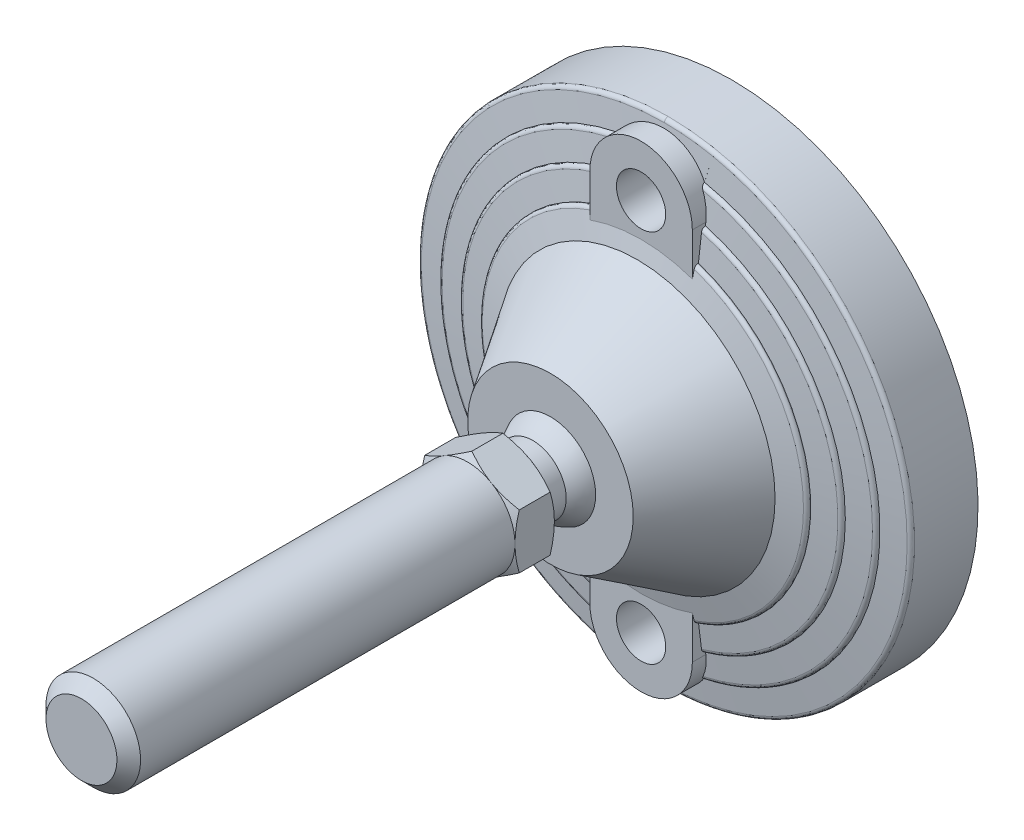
ISO-10303-21;
HEADER;
FILE_DESCRIPTION(('STEP AP214'),'2;1');
FILE_NAME('part.step','',(''),(''),'','','');
FILE_SCHEMA(('AUTOMOTIVE_DESIGN { 1 0 10303 214 1 1 1 1 }'));
ENDSEC;
DATA;
#1=APPLICATION_CONTEXT('core data for automotive mechanical design processes');
#2=APPLICATION_PROTOCOL_DEFINITION('international standard','automotive_design',2000,#1);
#3=PRODUCT_CONTEXT('',#1,'mechanical');
#4=PRODUCT('Part','Part','',(#3));
#5=PRODUCT_RELATED_PRODUCT_CATEGORY('part','',(#4));
#6=PRODUCT_DEFINITION_FORMATION('','',#4);
#7=PRODUCT_DEFINITION_CONTEXT('part definition',#1,'design');
#8=PRODUCT_DEFINITION('design','',#6,#7);
#9=PRODUCT_DEFINITION_SHAPE('','',#8);
#10=(LENGTH_UNIT() NAMED_UNIT(*) SI_UNIT(.MILLI.,.METRE.));
#11=(NAMED_UNIT(*) PLANE_ANGLE_UNIT() SI_UNIT($,.RADIAN.));
#12=(NAMED_UNIT(*) SI_UNIT($,.STERADIAN.) SOLID_ANGLE_UNIT());
#13=UNCERTAINTY_MEASURE_WITH_UNIT(LENGTH_MEASURE(1.E-05),#10,'distance_accuracy_value','');
#14=(GEOMETRIC_REPRESENTATION_CONTEXT(3) GLOBAL_UNCERTAINTY_ASSIGNED_CONTEXT((#13)) GLOBAL_UNIT_ASSIGNED_CONTEXT((#10,
#11,#12)) REPRESENTATION_CONTEXT('',''));
#15=CARTESIAN_POINT('',(0.,0.,0.));
#16=DIRECTION('',(0.,0.,1.));
#17=DIRECTION('',(1.,0.,0.));
#18=AXIS2_PLACEMENT_3D('',#15,#16,#17);
#19=CARTESIAN_POINT('',(-12.,14.022683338,60.));
#20=DIRECTION('',(0.,0.,1.));
#21=DIRECTION('',(0.,-1.,0.));
#22=AXIS2_PLACEMENT_3D('',#19,#20,#21);
#23=PLANE('',#22);
#24=CARTESIAN_POINT('',(0.,0.,60.));
#25=DIRECTION('',(0.,0.,-1.));
#26=DIRECTION('',(1.,0.,0.));
#27=AXIS2_PLACEMENT_3D('',#24,#25,#26);
#28=CIRCLE('',#27,8.5);
#29=CARTESIAN_POINT('',(8.5,0.,60.));
#30=VERTEX_POINT('',#29);
#31=EDGE_CURVE('E556',#30,#30,#28,.T.);
#32=ORIENTED_EDGE('',*,*,#31,.F.);
#33=EDGE_LOOP('',(#32));
#34=FACE_BOUND('',#33,.T.);
#35=CARTESIAN_POINT('',(0.,0.,60.));
#36=DIRECTION('',(0.,0.,1.));
#37=DIRECTION('',(0.,-1.,0.));
#38=AXIS2_PLACEMENT_3D('',#35,#36,#37);
#39=CIRCLE('',#38,12.);
#40=CARTESIAN_POINT('',(6.00000000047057,-10.3923048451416,60.));
#41=VERTEX_POINT('',#40);
#42=CARTESIAN_POINT('',(-6.00000000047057,-10.3923048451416,60.));
#43=VERTEX_POINT('',#42);
#44=EDGE_CURVE('E26',#41,#43,#39,.F.);
#45=ORIENTED_EDGE('',*,*,#44,.T.);
#46=CARTESIAN_POINT('',(-12.,0.,60.));
#47=VERTEX_POINT('',#46);
#48=EDGE_CURVE('E9',#43,#47,#39,.F.);
#49=ORIENTED_EDGE('',*,*,#48,.T.);
#50=CARTESIAN_POINT('',(-6.00000000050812,10.3923048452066,60.));
#51=VERTEX_POINT('',#50);
#52=EDGE_CURVE('E25',#47,#51,#39,.F.);
#53=ORIENTED_EDGE('',*,*,#52,.T.);
#54=CARTESIAN_POINT('',(6.00000000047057,10.3923048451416,60.));
#55=VERTEX_POINT('',#54);
#56=EDGE_CURVE('E239',#51,#55,#39,.F.);
#57=ORIENTED_EDGE('',*,*,#56,.T.);
#58=CARTESIAN_POINT('',(0.,0.,60.));
#59=DIRECTION('',(0.,0.,-1.));
#60=DIRECTION('',(0.,1.,0.));
#61=AXIS2_PLACEMENT_3D('',#58,#59,#60);
#62=CIRCLE('',#61,12.);
#63=CARTESIAN_POINT('',(12.,0.,60.));
#64=VERTEX_POINT('',#63);
#65=EDGE_CURVE('E253',#55,#64,#62,.T.);
#66=ORIENTED_EDGE('',*,*,#65,.T.);
#67=EDGE_CURVE('E262',#64,#41,#39,.F.);
#68=ORIENTED_EDGE('',*,*,#67,.T.);
#69=EDGE_LOOP('',(#45,#49,#53,#57,#66,#68));
#70=FACE_BOUND('',#69,.T.);
#71=ADVANCED_FACE('F14',(#34,#70),#23,.F.);
#72=CARTESIAN_POINT('',(-55.851524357,55.66,0.));
#73=DIRECTION('',(0.,0.,1.));
#74=DIRECTION('',(0.,-1.,0.));
#75=AXIS2_PLACEMENT_3D('',#72,#73,#74);
#76=PLANE('',#75);
#77=CARTESIAN_POINT('',(0.,0.,0.));
#78=DIRECTION('',(0.,0.,-1.));
#79=DIRECTION('',(0.,1.,0.));
#80=AXIS2_PLACEMENT_3D('',#77,#78,#79);
#81=CIRCLE('',#80,55.);
#82=CARTESIAN_POINT('',(0.,55.,0.));
#83=VERTEX_POINT('',#82);
#84=EDGE_CURVE('E553',#83,#83,#81,.F.);
#85=ORIENTED_EDGE('',*,*,#84,.F.);
#86=EDGE_LOOP('',(#85));
#87=FACE_BOUND('',#86,.T.);
#88=ADVANCED_FACE('F1289',(#87),#76,.F.);
#89=CARTESIAN_POINT('',(0.,0.,60.));
#90=DIRECTION('',(0.,0.,-1.));
#91=DIRECTION('',(1.,0.,0.));
#92=AXIS2_PLACEMENT_3D('',#89,#90,#91);
#93=CYLINDRICAL_SURFACE('',#92,8.5);
#94=ORIENTED_EDGE('',*,*,#31,.T.);
#95=EDGE_LOOP('',(#94));
#96=FACE_BOUND('',#95,.T.);
#97=CARTESIAN_POINT('',(0.,0.,53.5000000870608));
#98=DIRECTION('',(0.,0.,-1.));
#99=DIRECTION('',(-1.,0.,0.));
#100=AXIS2_PLACEMENT_3D('',#97,#98,#99);
#101=CIRCLE('',#100,8.49999990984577);
#102=CARTESIAN_POINT('',(-8.49999990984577,0.,53.5000000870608));
#103=VERTEX_POINT('',#102);
#104=EDGE_CURVE('E552',#103,#103,#101,.T.);
#105=ORIENTED_EDGE('',*,*,#104,.F.);
#106=EDGE_LOOP('',(#105));
#107=FACE_BOUND('',#106,.T.);
#108=ADVANCED_FACE('F1299',(#96,#107),#93,.T.);
#109=CARTESIAN_POINT('',(0.,0.,3.));
#110=DIRECTION('',(0.,0.,-1.));
#111=DIRECTION('',(0.,1.,0.));
#112=AXIS2_PLACEMENT_3D('',#109,#110,#111);
#113=CYLINDRICAL_SURFACE('',#112,55.);
#114=ORIENTED_EDGE('',*,*,#84,.T.);
#115=EDGE_LOOP('',(#114));
#116=FACE_BOUND('',#115,.T.);
#117=CARTESIAN_POINT('',(0.,0.,3.));
#118=DIRECTION('',(0.,0.,-1.));
#119=DIRECTION('',(0.,1.,0.));
#120=AXIS2_PLACEMENT_3D('',#117,#118,#119);
#121=CIRCLE('',#120,55.);
#122=CARTESIAN_POINT('',(0.,55.,3.));
#123=VERTEX_POINT('',#122);
#124=EDGE_CURVE('E549',#123,#123,#121,.T.);
#125=ORIENTED_EDGE('',*,*,#124,.T.);
#126=EDGE_LOOP('',(#125));
#127=FACE_BOUND('',#126,.T.);
#128=ADVANCED_FACE('F367',(#116,#127),#113,.T.);
#129=CARTESIAN_POINT('',(0.,0.,44.678860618));
#130=DIRECTION('',(0.,0.,-1.));
#131=DIRECTION('',(1.,0.,0.));
#132=AXIS2_PLACEMENT_3D('',#129,#130,#131);
#133=SPHERICAL_SURFACE('',#132,12.25);
#134=CARTESIAN_POINT('',(0.,0.,49.));
#135=DIRECTION('',(0.,0.,-1.));
#136=DIRECTION('',(0.,1.,0.));
#137=AXIS2_PLACEMENT_3D('',#134,#135,#136);
#138=CIRCLE('',#137,11.4625588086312);
#139=CARTESIAN_POINT('',(0.,11.4625588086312,49.));
#140=VERTEX_POINT('',#139);
#141=EDGE_CURVE('E546',#140,#140,#138,.F.);
#142=ORIENTED_EDGE('',*,*,#141,.T.);
#143=EDGE_LOOP('',(#142));
#144=FACE_BOUND('',#143,.T.);
#145=ORIENTED_EDGE('',*,*,#104,.T.);
#146=EDGE_LOOP('',(#145));
#147=FACE_BOUND('',#146,.T.);
#148=ADVANCED_FACE('F362',(#144,#147),#133,.T.);
#149=CARTESIAN_POINT('',(-6.346764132,-41.175,3.));
#150=DIRECTION('',(0.,0.,1.));
#151=DIRECTION('',(0.,-1.,0.));
#152=AXIS2_PLACEMENT_3D('',#149,#150,#151);
#153=PLANE('',#152);
#154=CARTESIAN_POINT('',(0.,-47.5,3.));
#155=DIRECTION('',(0.,0.,1.));
#156=DIRECTION('',(0.,-1.,0.));
#157=AXIS2_PLACEMENT_3D('',#154,#155,#156);
#158=CIRCLE('',#157,6.25);
#159=CARTESIAN_POINT('',(0.,-53.75,3.));
#160=VERTEX_POINT('',#159);
#161=EDGE_CURVE('E542',#160,#160,#158,.T.);
#162=ORIENTED_EDGE('',*,*,#161,.T.);
#163=EDGE_LOOP('',(#162));
#164=FACE_BOUND('',#163,.T.);
#165=ADVANCED_FACE('F366',(#164),#153,.T.);
#166=CARTESIAN_POINT('',(-63.467641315,63.25,3.));
#167=DIRECTION('',(0.,0.,1.));
#168=DIRECTION('',(0.,-1.,0.));
#169=AXIS2_PLACEMENT_3D('',#166,#167,#168);
#170=PLANE('',#169);
#171=ORIENTED_EDGE('',*,*,#124,.F.);
#172=EDGE_LOOP('',(#171));
#173=FACE_BOUND('',#172,.T.);
#174=CARTESIAN_POINT('',(0.,0.,3.));
#175=DIRECTION('',(0.,0.,-1.));
#176=DIRECTION('',(0.,1.,0.));
#177=AXIS2_PLACEMENT_3D('',#174,#175,#176);
#178=CIRCLE('',#177,62.5);
#179=CARTESIAN_POINT('',(0.,62.5,3.));
#180=VERTEX_POINT('',#179);
#181=EDGE_CURVE('E538',#180,#180,#178,.F.);
#182=ORIENTED_EDGE('',*,*,#181,.F.);
#183=EDGE_LOOP('',(#182));
#184=FACE_BOUND('',#183,.T.);
#185=ADVANCED_FACE('F766',(#173,#184),#170,.F.);
#186=CARTESIAN_POINT('',(-21.325127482,-21.252,49.));
#187=DIRECTION('',(0.,0.,-1.));
#188=DIRECTION('',(0.,1.,0.));
#189=AXIS2_PLACEMENT_3D('',#186,#187,#188);
#190=PLANE('',#189);
#191=ORIENTED_EDGE('',*,*,#141,.F.);
#192=EDGE_LOOP('',(#191));
#193=FACE_BOUND('',#192,.T.);
#194=CARTESIAN_POINT('',(0.,0.,49.));
#195=DIRECTION('',(0.,0.,-1.));
#196=DIRECTION('',(1.,0.,0.));
#197=AXIS2_PLACEMENT_3D('',#194,#195,#196);
#198=CIRCLE('',#197,21.);
#199=CARTESIAN_POINT('',(21.,0.,49.));
#200=VERTEX_POINT('',#199);
#201=EDGE_CURVE('E409',#200,#200,#198,.T.);
#202=ORIENTED_EDGE('',*,*,#201,.F.);
#203=EDGE_LOOP('',(#202));
#204=FACE_BOUND('',#203,.T.);
#205=ADVANCED_FACE('F374',(#193,#204),#190,.F.);
#206=CARTESIAN_POINT('',(0.,-47.5,3.));
#207=DIRECTION('',(0.,0.,1.));
#208=DIRECTION('',(0.,-1.,0.));
#209=AXIS2_PLACEMENT_3D('',#206,#207,#208);
#210=CYLINDRICAL_SURFACE('',#209,6.25);
#211=ORIENTED_EDGE('',*,*,#161,.F.);
#212=EDGE_LOOP('',(#211));
#213=FACE_BOUND('',#212,.T.);
#214=CARTESIAN_POINT('',(0.,-47.5,26.));
#215=DIRECTION('',(0.,0.,1.));
#216=DIRECTION('',(0.,-1.,0.));
#217=AXIS2_PLACEMENT_3D('',#214,#215,#216);
#218=CIRCLE('',#217,6.25);
#219=CARTESIAN_POINT('',(0.,-53.75,26.));
#220=VERTEX_POINT('',#219);
#221=EDGE_CURVE('E752',#220,#220,#218,.T.);
#222=ORIENTED_EDGE('',*,*,#221,.T.);
#223=EDGE_LOOP('',(#222));
#224=FACE_BOUND('',#223,.T.);
#225=ADVANCED_FACE('F370',(#213,#224),#210,.F.);
#226=CARTESIAN_POINT('',(-6.346764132,53.825,3.));
#227=DIRECTION('',(0.,0.,1.));
#228=DIRECTION('',(0.,-1.,0.));
#229=AXIS2_PLACEMENT_3D('',#226,#227,#228);
#230=PLANE('',#229);
#231=CARTESIAN_POINT('',(0.,47.5,3.));
#232=DIRECTION('',(0.,0.,1.));
#233=DIRECTION('',(0.,-1.,0.));
#234=AXIS2_PLACEMENT_3D('',#231,#232,#233);
#235=CIRCLE('',#234,6.25);
#236=CARTESIAN_POINT('',(0.,41.25,3.));
#237=VERTEX_POINT('',#236);
#238=EDGE_CURVE('E610',#237,#237,#235,.T.);
#239=ORIENTED_EDGE('',*,*,#238,.T.);
#240=EDGE_LOOP('',(#239));
#241=FACE_BOUND('',#240,.T.);
#242=ADVANCED_FACE('F373',(#241),#230,.T.);
#243=CARTESIAN_POINT('',(12.406354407,39.602176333,24.568111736));
#244=CARTESIAN_POINT('',(59.707464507,24.78394183,24.568111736));
#245=CARTESIAN_POINT('',(59.707464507,-24.78394183,24.568111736));
#246=CARTESIAN_POINT('',(12.406354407,-39.602176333,24.568111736));
#247=CARTESIAN_POINT('',(12.406354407,39.602176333,25.044046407));
#248=CARTESIAN_POINT('',(59.707464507,24.78394183,25.044046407));
#249=CARTESIAN_POINT('',(59.707464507,-24.78394183,25.044046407));
#250=CARTESIAN_POINT('',(12.406354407,-39.602176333,25.044046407));
#251=CARTESIAN_POINT('',(12.31903347,39.323440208,25.419805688));
#252=CARTESIAN_POINT('',(59.287219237,24.609502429,25.419805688));
#253=CARTESIAN_POINT('',(59.287219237,-24.609502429,25.419805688));
#254=CARTESIAN_POINT('',(12.31903347,-39.323440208,25.419805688));
#255=CARTESIAN_POINT('',(12.18115046,38.883305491,25.53720891));
#256=CARTESIAN_POINT('',(58.623636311,24.334056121,25.53720891));
#257=CARTESIAN_POINT('',(58.623636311,-24.334056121,25.53720891));
#258=CARTESIAN_POINT('',(12.18115046,-38.883305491,25.53720891));
#259=(BOUNDED_SURFACE() B_SPLINE_SURFACE(3,3,((#243,#244,#245,#246),(#247,#248,#249,#250),(#251,
#252,#253,#254),(#255,#256,#257,#258)),.UNSPECIFIED.,.F.,.F.,
.F.) B_SPLINE_SURFACE_WITH_KNOTS((4,4),(4,4),(0.,1.),(0.,1.),
.UNSPECIFIED.) GEOMETRIC_REPRESENTATION_ITEM() RATIONAL_B_SPLINE_SURFACE(((1.,0.532632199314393,
0.532632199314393,1.),(0.859679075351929,0.457892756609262,0.457892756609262,0.859679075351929),
(0.859679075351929,0.457892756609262,0.457892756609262,0.859679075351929),(1.,0.532632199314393,
0.532632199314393,1.))) REPRESENTATION_ITEM('') SURFACE());
#260=CARTESIAN_POINT('',(0.,0.,25.5372089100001));
#261=DIRECTION('',(0.,0.,-1.));
#262=DIRECTION('',(0.,1.,0.));
#263=AXIS2_PLACEMENT_3D('',#260,#261,#262);
#264=CIRCLE('',#263,40.746679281);
#265=CARTESIAN_POINT('',(13.,-38.6172483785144,25.537208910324));
#266=VERTEX_POINT('',#265);
#267=CARTESIAN_POINT('',(13.,38.6172483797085,25.5372089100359));
#268=VERTEX_POINT('',#267);
#269=EDGE_CURVE('E745',#266,#268,#264,.F.);
#270=CARTESIAN_POINT('',(13.,-39.4112927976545,24.5681117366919));
#271=CARTESIAN_POINT('',(13.,-39.4112933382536,24.59521048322));
#272=CARTESIAN_POINT('',(13.,-39.4101321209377,24.6222958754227));
#273=CARTESIAN_POINT('',(13.,-39.405504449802,24.6762650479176));
#274=CARTESIAN_POINT('',(13.,-39.4020383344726,24.7031488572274));
#275=CARTESIAN_POINT('',(13.,-39.3882336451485,24.7831079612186));
#276=CARTESIAN_POINT('',(13.,-39.3744885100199,24.8356344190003));
#277=CARTESIAN_POINT('',(13.,-39.3384084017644,24.937608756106));
#278=CARTESIAN_POINT('',(13.,-39.3160736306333,24.9870567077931));
#279=CARTESIAN_POINT('',(13.,-39.2635909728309,25.0816017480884));
#280=CARTESIAN_POINT('',(13.,-39.233444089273,25.1266993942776));
#281=CARTESIAN_POINT('',(13.,-39.1656058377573,25.2123360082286));
#282=CARTESIAN_POINT('',(13.,-39.1277714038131,25.2527614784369));
#283=CARTESIAN_POINT('',(13.,-39.0461074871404,25.327071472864));
#284=CARTESIAN_POINT('',(13.,-39.0022718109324,25.3609491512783));
#285=CARTESIAN_POINT('',(13.,-38.9043172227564,25.4250520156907));
#286=CARTESIAN_POINT('',(13.,-38.8495953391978,25.454364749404));
#287=CARTESIAN_POINT('',(13.,-38.7644641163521,25.4909906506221));
#288=CARTESIAN_POINT('',(13.,-38.7355751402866,25.5019763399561));
#289=CARTESIAN_POINT('',(13.,-38.6769796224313,25.5214626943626));
#290=CARTESIAN_POINT('',(13.,-38.6472733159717,25.5299640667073));
#291=CARTESIAN_POINT('',(13.,-38.6172483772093,25.5372089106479));
#292=B_SPLINE_CURVE_WITH_KNOTS('',3,(#270,#271,#272,#273,#274,#275,#276,#277,#278,#279,#280,
#281,#282,#283,#284,#285,#286,#287,#288,#289,#290,#291),.UNSPECIFIED.,.F.,.F.,(4,2,2,2,2,2,2,2,
2,2,4),(0.,0.0812450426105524,0.162478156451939,0.324519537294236,0.486557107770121,
0.648573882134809,0.813939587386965,0.979477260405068,1.16468654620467,1.25731455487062,
1.34991616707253),.UNSPECIFIED.);
#293=CARTESIAN_POINT('',(13.,-39.4112927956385,24.568111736));
#294=VERTEX_POINT('',#293);
#295=EDGE_CURVE('E401',#294,#266,#292,.T.);
#296=CARTESIAN_POINT('',(0.,0.,24.568111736));
#297=DIRECTION('',(0.,0.,-1.));
#298=DIRECTION('',(0.,1.,0.));
#299=AXIS2_PLACEMENT_3D('',#296,#297,#298);
#300=CIRCLE('',#299,41.5);
#301=CARTESIAN_POINT('',(13.,39.4112927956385,24.5681117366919));
#302=VERTEX_POINT('',#301);
#303=EDGE_CURVE('E545',#302,#294,#300,.T.);
#304=CARTESIAN_POINT('',(13.,38.6172483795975,25.5372089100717));
#305=CARTESIAN_POINT('',(13.,38.6757273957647,25.5231434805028));
#306=CARTESIAN_POINT('',(13.,38.7330575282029,25.5042077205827));
#307=CARTESIAN_POINT('',(13.,38.843898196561,25.4570874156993));
#308=CARTESIAN_POINT('',(13.,38.8974017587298,25.4288864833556));
#309=CARTESIAN_POINT('',(13.,38.9989209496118,25.3637346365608));
#310=CARTESIAN_POINT('',(13.,39.0469285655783,25.3267711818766));
#311=CARTESIAN_POINT('',(13.,39.1357078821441,25.2450475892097));
#312=CARTESIAN_POINT('',(13.,39.1764870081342,25.2002955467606));
#313=CARTESIAN_POINT('',(13.,39.2479885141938,25.1059931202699));
#314=CARTESIAN_POINT('',(13.,39.2790300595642,25.0566848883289));
#315=CARTESIAN_POINT('',(13.,39.3318958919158,24.9533393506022));
#316=CARTESIAN_POINT('',(13.,39.3537228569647,24.8993034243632));
#317=CARTESIAN_POINT('',(13.,39.3839717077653,24.7991363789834));
#318=CARTESIAN_POINT('',(13.,39.3941848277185,24.7535382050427));
#319=CARTESIAN_POINT('',(13.,39.4078594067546,24.6613400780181));
#320=CARTESIAN_POINT('',(13.,39.411320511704,24.6147400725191));
#321=CARTESIAN_POINT('',(13.,39.4112927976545,24.5681117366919));
#322=B_SPLINE_CURVE_WITH_KNOTS('',3,(#304,#305,#306,#307,#308,#309,#310,#311,#312,#313,#314,
#315,#316,#317,#318,#319,#320,#321),.UNSPECIFIED.,.F.,.F.,(4,2,2,2,2,2,2,2,4),(0.,
0.180276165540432,0.360872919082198,0.541729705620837,0.722399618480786,0.896310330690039,
1.07017046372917,1.20986980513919,1.34957647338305),.UNSPECIFIED.);
#323=EDGE_CURVE('E392',#268,#302,#322,.T.);
#324=ORIENTED_EDGE('',*,*,#269,.F.);
#325=ORIENTED_EDGE('',*,*,#295,.F.);
#326=ORIENTED_EDGE('',*,*,#303,.F.);
#327=ORIENTED_EDGE('',*,*,#323,.F.);
#328=EDGE_LOOP('',(#324,#325,#326,#327));
#329=FACE_BOUND('',#328,.T.);
#330=ADVANCED_FACE('F376',(#329),#259,.T.);
#331=CARTESIAN_POINT('',(0.,0.,24.568111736));
#332=DIRECTION('',(0.,0.,-1.));
#333=DIRECTION('',(0.,1.,0.));
#334=AXIS2_PLACEMENT_3D('',#331,#332,#333);
#335=CYLINDRICAL_SURFACE('',#334,41.5);
#336=CARTESIAN_POINT('',(0.,0.,24.454545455));
#337=DIRECTION('',(0.,0.,-1.));
#338=DIRECTION('',(0.,1.,0.));
#339=AXIS2_PLACEMENT_3D('',#336,#337,#338);
#340=CIRCLE('',#339,41.5);
#341=CARTESIAN_POINT('',(13.,39.4112927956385,24.454545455));
#342=VERTEX_POINT('',#341);
#343=CARTESIAN_POINT('',(13.,-39.4112927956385,24.4545454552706));
#344=VERTEX_POINT('',#343);
#345=EDGE_CURVE('E743',#342,#344,#340,.T.);
#346=ORIENTED_EDGE('',*,*,#345,.F.);
#347=DIRECTION('',(0.,0.,-1.));
#348=VECTOR('',#347,1.);
#349=CARTESIAN_POINT('',(13.,39.4112927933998,24.2785712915));
#350=LINE('',#349,#348);
#351=EDGE_CURVE('E635',#302,#342,#350,.T.);
#352=ORIENTED_EDGE('',*,*,#351,.F.);
#353=ORIENTED_EDGE('',*,*,#303,.T.);
#354=DIRECTION('',(0.,0.,1.));
#355=VECTOR('',#354,1.);
#356=CARTESIAN_POINT('',(13.,-39.4112927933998,24.2785712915));
#357=LINE('',#356,#355);
#358=EDGE_CURVE('E410',#344,#294,#357,.T.);
#359=ORIENTED_EDGE('',*,*,#358,.F.);
#360=EDGE_LOOP('',(#346,#352,#353,#359));
#361=FACE_BOUND('',#360,.T.);
#362=ADVANCED_FACE('F382',(#361),#335,.T.);
#363=CARTESIAN_POINT('',(0.,0.,24.454545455));
#364=DIRECTION('',(0.,0.,-1.));
#365=DIRECTION('',(0.,1.,0.));
#366=AXIS2_PLACEMENT_3D('',#363,#364,#365);
#367=CONICAL_SURFACE('',#366,41.5,1.4442041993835);
#368=ORIENTED_EDGE('',*,*,#345,.T.);
#369=CARTESIAN_POINT('',(13.0000000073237,-45.8176832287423,23.6748403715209));
#370=CARTESIAN_POINT('',(13.0000000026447,-45.2838642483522,23.7402005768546));
#371=CARTESIAN_POINT('',(13.000000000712,-44.7500350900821,23.8054777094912));
#372=CARTESIAN_POINT('',(12.999999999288,-43.6823542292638,23.9358466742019));
#373=CARTESIAN_POINT('',(12.9999999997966,-43.1485025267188,24.0009385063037));
#374=CARTESIAN_POINT('',(13.0000000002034,-42.0807742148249,24.1309177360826));
#375=CARTESIAN_POINT('',(13.0000000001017,-41.5468976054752,24.195805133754));
#376=CARTESIAN_POINT('',(12.9999999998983,-40.4791166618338,24.3253520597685));
#377=CARTESIAN_POINT('',(12.9999999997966,-39.9452123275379,24.3900115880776));
#378=CARTESIAN_POINT('',(13.,-39.4112927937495,24.4545454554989));
#379=B_SPLINE_CURVE_WITH_KNOTS('',3,(#369,#370,#371,#372,#373,#374,#375,#376,#377,#378),
.UNSPECIFIED.,.F.,.F.,(4,2,2,2,4),(0.,1.61341623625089,3.22683223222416,4.84024827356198,
6.4536645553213),.UNSPECIFIED.);
#380=CARTESIAN_POINT('',(13.,-45.8176832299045,23.674840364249));
#381=VERTEX_POINT('',#380);
#382=EDGE_CURVE('E412',#381,#344,#379,.T.);
#383=ORIENTED_EDGE('',*,*,#382,.F.);
#384=CARTESIAN_POINT('',(-7.48558333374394E-10,0.,23.674840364));
#385=DIRECTION('',(0.,0.,-1.));
#386=DIRECTION('',(0.,1.,0.));
#387=AXIS2_PLACEMENT_3D('',#384,#385,#386);
#388=CIRCLE('',#387,47.6262542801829);
#389=CARTESIAN_POINT('',(13.,45.8176832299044,23.6748403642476));
#390=VERTEX_POINT('',#389);
#391=EDGE_CURVE('E359',#390,#381,#388,.T.);
#392=ORIENTED_EDGE('',*,*,#391,.F.);
#393=CARTESIAN_POINT('',(13.,39.4112927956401,24.4545454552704));
#394=CARTESIAN_POINT('',(13.,39.9452123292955,24.3900115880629));
#395=CARTESIAN_POINT('',(13.,40.4791166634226,24.3253520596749));
#396=CARTESIAN_POINT('',(13.,41.5468976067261,24.195805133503));
#397=CARTESIAN_POINT('',(13.,42.0807742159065,24.1309177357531));
#398=CARTESIAN_POINT('',(13.,43.1485025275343,24.0009385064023));
#399=CARTESIAN_POINT('',(13.,43.6823542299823,23.9358466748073));
#400=CARTESIAN_POINT('',(13.,44.7500350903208,23.805477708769));
#401=CARTESIAN_POINT('',(13.,45.283864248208,23.7402005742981));
#402=CARTESIAN_POINT('',(13.,45.8176832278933,23.6748403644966));
#403=B_SPLINE_CURVE_WITH_KNOTS('',3,(#393,#394,#395,#396,#397,#398,#399,#400,#401,#402),
.UNSPECIFIED.,.F.,.F.,(4,2,2,2,4),(0.,1.61341628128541,3.22683232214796,4.84024831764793,
6.45366455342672),.UNSPECIFIED.);
#404=EDGE_CURVE('E629',#342,#390,#403,.T.);
#405=ORIENTED_EDGE('',*,*,#404,.F.);
#406=EDGE_LOOP('',(#368,#383,#392,#405));
#407=FACE_BOUND('',#406,.T.);
#408=ADVANCED_FACE('F513',(#407),#367,.T.);
#409=CARTESIAN_POINT('',(12.269850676,46.922284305,22.669623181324));
#410=CARTESIAN_POINT('',(72.557631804,31.157449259,22.6696231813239));
#411=CARTESIAN_POINT('',(72.557631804,-31.157449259,22.6696231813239));
#412=CARTESIAN_POINT('',(12.269850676,-46.922284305,22.669623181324));
#413=CARTESIAN_POINT('',(12.269850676,46.922284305,22.6740296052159));
#414=CARTESIAN_POINT('',(72.557631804,31.157449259,22.674029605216));
#415=CARTESIAN_POINT('',(72.557631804,-31.157449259,22.674029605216));
#416=CARTESIAN_POINT('',(12.269850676,-46.922284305,22.6740296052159));
#417=CARTESIAN_POINT('',(12.269850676,46.922284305,22.678436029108));
#418=CARTESIAN_POINT('',(72.557631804,31.157449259,22.678436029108));
#419=CARTESIAN_POINT('',(72.557631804,-31.157449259,22.678436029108));
#420=CARTESIAN_POINT('',(12.269850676,-46.922284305,22.678436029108));
#421=CARTESIAN_POINT('',(12.269850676,46.922284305,22.682842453));
#422=CARTESIAN_POINT('',(72.557631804,31.157449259,22.682842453));
#423=CARTESIAN_POINT('',(72.557631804,-31.157449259,22.682842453));
#424=CARTESIAN_POINT('',(12.269850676,-46.922284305,22.682842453));
#425=CARTESIAN_POINT('',(12.269850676,46.922284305,23.211436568));
#426=CARTESIAN_POINT('',(72.557631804,31.157449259,23.211436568));
#427=CARTESIAN_POINT('',(72.557631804,-31.157449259,23.211436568));
#428=CARTESIAN_POINT('',(12.269850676,-46.922284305,23.211436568));
#429=CARTESIAN_POINT('',(12.181461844,46.584268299,23.608103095));
#430=CARTESIAN_POINT('',(72.034945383,30.93299905,23.608103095));
#431=CARTESIAN_POINT('',(72.034945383,-30.93299905,23.608103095));
#432=CARTESIAN_POINT('',(12.181461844,-46.584268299,23.608103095));
#433=CARTESIAN_POINT('',(12.048804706,46.076961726,23.674840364));
#434=CARTESIAN_POINT('',(71.250478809,30.596136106,23.674840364));
#435=CARTESIAN_POINT('',(71.250478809,-30.596136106,23.674840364));
#436=CARTESIAN_POINT('',(12.048804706,-46.076961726,23.674840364));
#437=(BOUNDED_SURFACE() B_SPLINE_SURFACE(3,3,((#409,#410,#411,#412),(#413,#414,#415,#416),(#417,
#418,#419,#420),(#421,#422,#423,#424),(#425,#426,#427,#428),(#429,#430,#431,#432),(#433,#434,
#435,#436)),.UNSPECIFIED.,.F.,.F.,.F.) B_SPLINE_SURFACE_WITH_KNOTS((4,3,4),(4,4),(-0.01,0.,1.),
(0.,1.),.UNSPECIFIED.) GEOMETRIC_REPRESENTATION_ITEM() RATIONAL_B_SPLINE_SURFACE(((1.,
0.501991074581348,0.501991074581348,1.),(1.,0.501991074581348,0.501991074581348,1.),(1.,
0.501991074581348,0.501991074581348,1.),(1.,0.501991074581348,0.501991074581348,1.),
(0.833611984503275,0.418465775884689,0.418465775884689,0.833611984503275),(0.833611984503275,
0.418465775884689,0.418465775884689,0.833611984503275),(1.,0.501991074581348,0.501991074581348,1.))) REPRESENTATION_ITEM('') SURFACE());
#438=CARTESIAN_POINT('',(13.,-46.7252608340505,22.6777848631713));
#439=CARTESIAN_POINT('',(13.,-46.7253979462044,22.7054287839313));
#440=CARTESIAN_POINT('',(13.,-46.7243484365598,22.7330653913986));
#441=CARTESIAN_POINT('',(13.,-46.7198870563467,22.7881439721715));
#442=CARTESIAN_POINT('',(13.,-46.7164754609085,22.815585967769));
#443=CARTESIAN_POINT('',(13.,-46.7027375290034,22.8972169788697));
#444=CARTESIAN_POINT('',(13.,-46.6889086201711,22.9508576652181));
#445=CARTESIAN_POINT('',(13.,-46.6523707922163,23.0550506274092));
#446=CARTESIAN_POINT('',(13.,-46.6296523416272,23.105599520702));
#447=CARTESIAN_POINT('',(13.,-46.5760978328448,23.2021956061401));
#448=CARTESIAN_POINT('',(13.,-46.5452617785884,23.2482428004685));
#449=CARTESIAN_POINT('',(13.,-46.4762858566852,23.3348542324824));
#450=CARTESIAN_POINT('',(13.,-46.4381108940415,23.375390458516));
#451=CARTESIAN_POINT('',(13.,-46.3556866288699,23.4497572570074));
#452=CARTESIAN_POINT('',(13.,-46.3114344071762,23.483584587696));
#453=CARTESIAN_POINT('',(13.,-46.2164675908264,23.5448274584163));
#454=CARTESIAN_POINT('',(13.,-46.165579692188,23.5719736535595));
#455=CARTESIAN_POINT('',(13.,-46.0601083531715,23.6176355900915));
#456=CARTESIAN_POINT('',(13.,-46.0055288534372,23.6361603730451));
#457=CARTESIAN_POINT('',(13.,-45.9281089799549,23.6556819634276));
#458=CARTESIAN_POINT('',(13.,-45.9061721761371,23.6604842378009));
#459=CARTESIAN_POINT('',(13.,-45.8620822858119,23.6686997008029));
#460=CARTESIAN_POINT('',(13.,-45.8399296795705,23.6721154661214));
#461=CARTESIAN_POINT('',(13.0000000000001,-45.817683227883,23.6748403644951));
#462=B_SPLINE_CURVE_WITH_KNOTS('',3,(#438,#439,#440,#441,#442,#443,#444,#445,#446,#447,#448,
#449,#450,#451,#452,#453,#454,#455,#456,#457,#458,#459,#460,#461),.UNSPECIFIED.,.F.,.F.,(4,2,2,
2,2,2,2,2,2,2,2,4),(0.,0.0828810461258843,0.165752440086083,0.331061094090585,0.49654748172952,
0.66203378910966,0.828332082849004,0.994710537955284,1.16697834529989,1.3390650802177,
1.40639957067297,1.47360834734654),.UNSPECIFIED.);
#463=CARTESIAN_POINT('',(13.0000000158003,-46.7252608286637,22.6777848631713));
#464=VERTEX_POINT('',#463);
#465=EDGE_CURVE('E537',#464,#381,#462,.T.);
#466=CARTESIAN_POINT('',(13.0000000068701,46.7252608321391,22.6727272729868));
#467=CARTESIAN_POINT('',(13.3212147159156,46.635891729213,22.6727272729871));
#468=CARTESIAN_POINT('',(13.6414983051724,46.5432129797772,22.6727272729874));
#469=CARTESIAN_POINT('',(14.2801231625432,46.3512597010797,22.672727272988));
#470=CARTESIAN_POINT('',(14.59846420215,46.2519844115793,22.6727272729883));
#471=CARTESIAN_POINT('',(15.5526106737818,45.9435979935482,22.6727272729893));
#472=CARTESIAN_POINT('',(16.1852411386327,45.7245656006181,22.6727272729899));
#473=CARTESIAN_POINT('',(17.4409289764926,45.2604918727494,22.6727272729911));
#474=CARTESIAN_POINT('',(18.063985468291,45.01544815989,22.6727272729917));
#475=CARTESIAN_POINT('',(19.3000708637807,44.4995075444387,22.672727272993));
#476=CARTESIAN_POINT('',(19.9130888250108,44.228584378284,22.6727272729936));
#477=CARTESIAN_POINT('',(21.1274202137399,43.6615551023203,22.6727272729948));
#478=CARTESIAN_POINT('',(21.7287319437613,43.3654453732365,22.6727272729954));
#479=CARTESIAN_POINT('',(23.5288179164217,42.4321391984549,22.6727272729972));
#480=CARTESIAN_POINT('',(24.7079785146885,41.7565378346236,22.6727272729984));
#481=CARTESIAN_POINT('',(27.005751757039,40.308619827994,22.6727272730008));
#482=CARTESIAN_POINT('',(28.124340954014,39.5362661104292,22.672727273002));
#483=CARTESIAN_POINT('',(30.2940548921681,37.8994558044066,22.6727272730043));
#484=CARTESIAN_POINT('',(31.3451007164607,37.0348945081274,22.6727272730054));
#485=CARTESIAN_POINT('',(33.3707378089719,35.2206260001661,22.6727272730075));
#486=CARTESIAN_POINT('',(34.3453363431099,34.2709268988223,22.6727272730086));
#487=CARTESIAN_POINT('',(36.2141318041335,32.2900336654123,22.6727272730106));
#488=CARTESIAN_POINT('',(37.1080775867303,31.258602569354,22.6727272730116));
#489=CARTESIAN_POINT('',(38.8059105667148,29.1240638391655,22.6727272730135));
#490=CARTESIAN_POINT('',(39.6097954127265,28.0209543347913,22.6727272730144));
#491=CARTESIAN_POINT('',(41.1215543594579,25.7512426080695,22.6727272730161));
#492=CARTESIAN_POINT('',(41.829455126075,24.5846581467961,22.6727272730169));
#493=CARTESIAN_POINT('',(43.1444737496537,22.1960153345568,22.6727272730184));
#494=CARTESIAN_POINT('',(43.7515922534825,20.9739573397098,22.6727272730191));
#495=CARTESIAN_POINT('',(44.8608053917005,18.4828923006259,22.6727272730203));
#496=CARTESIAN_POINT('',(45.3628870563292,17.2138794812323,22.6727272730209));
#497=CARTESIAN_POINT('',(46.2583633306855,14.6380667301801,22.6727272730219));
#498=CARTESIAN_POINT('',(46.6517577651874,13.3312667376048,22.6727272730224));
#499=CARTESIAN_POINT('',(47.3270705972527,10.689137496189,22.6727272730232));
#500=CARTESIAN_POINT('',(47.6089860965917,9.35380750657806,22.6727272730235));
#501=CARTESIAN_POINT('',(48.0593220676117,6.66414532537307,22.672727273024));
#502=CARTESIAN_POINT('',(48.2277425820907,5.30981314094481,22.6727272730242));
#503=CARTESIAN_POINT('',(48.449886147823,2.59183878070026,22.6727272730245));
#504=CARTESIAN_POINT('',(48.5036145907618,1.22819704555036,22.6727272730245));
#505=CARTESIAN_POINT('',(48.4960080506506,-1.49876561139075,22.6727272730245));
#506=CARTESIAN_POINT('',(48.4346730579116,-2.86208653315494,22.6727272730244));
#507=CARTESIAN_POINT('',(48.1973677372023,-5.57880747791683,22.6727272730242));
#508=CARTESIAN_POINT('',(48.0213896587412,-6.93220682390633,22.672727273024));
#509=CARTESIAN_POINT('',(47.5560413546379,-9.61936956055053,22.6727272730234));
#510=CARTESIAN_POINT('',(47.2666711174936,-10.9531329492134,22.6727272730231));
#511=CARTESIAN_POINT('',(46.5765756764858,-13.5916227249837,22.6727272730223));
#512=CARTESIAN_POINT('',(46.1758433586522,-14.8963472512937,22.6727272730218));
#513=CARTESIAN_POINT('',(45.2658742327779,-17.467402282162,22.6727272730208));
#514=CARTESIAN_POINT('',(44.7566374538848,-18.7337327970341,22.6727272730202));
#515=CARTESIAN_POINT('',(43.6334165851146,-21.218718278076,22.6727272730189));
#516=CARTESIAN_POINT('',(43.019453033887,-22.4373825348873,22.6727272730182));
#517=CARTESIAN_POINT('',(41.6909757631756,-24.8187625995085,22.6727272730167));
#518=CARTESIAN_POINT('',(40.9764619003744,-25.9814783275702,22.6727272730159));
#519=CARTESIAN_POINT('',(39.706302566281,-27.8655028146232,22.6727272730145));
#520=CARTESIAN_POINT('',(39.1770724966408,-28.6047764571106,22.6727272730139));
#521=CARTESIAN_POINT('',(38.0778809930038,-30.0524665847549,22.6727272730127));
#522=CARTESIAN_POINT('',(37.5079195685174,-30.7608830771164,22.6727272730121));
#523=CARTESIAN_POINT('',(36.3291070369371,-32.1445499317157,22.6727272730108));
#524=CARTESIAN_POINT('',(35.7202564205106,-32.8198007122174,22.6727272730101));
#525=CARTESIAN_POINT('',(34.4653645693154,-34.1352484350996,22.6727272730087));
#526=CARTESIAN_POINT('',(33.8193109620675,-34.7754335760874,22.672727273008));
#527=CARTESIAN_POINT('',(32.4922294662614,-36.0184899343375,22.6727272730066));
#528=CARTESIAN_POINT('',(31.8112009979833,-36.6213605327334,22.6727272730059));
#529=CARTESIAN_POINT('',(30.4163089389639,-37.7878929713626,22.6727272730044));
#530=CARTESIAN_POINT('',(29.7024437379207,-38.3515528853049,22.6727272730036));
#531=CARTESIAN_POINT('',(28.1769516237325,-39.4879139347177,22.672727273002));
#532=CARTESIAN_POINT('',(27.3623770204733,-40.0566641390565,22.6727272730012));
#533=CARTESIAN_POINT('',(25.6997855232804,-41.1431320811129,22.6727272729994));
#534=CARTESIAN_POINT('',(24.8517655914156,-41.6608451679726,22.6727272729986));
#535=CARTESIAN_POINT('',(23.1254909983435,-42.6432641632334,22.6727272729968));
#536=CARTESIAN_POINT('',(22.247234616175,-43.1079670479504,22.6727272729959));
#537=CARTESIAN_POINT('',(20.4623876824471,-43.9832963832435,22.6727272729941));
#538=CARTESIAN_POINT('',(19.5557530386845,-44.3938329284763,22.6727272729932));
#539=CARTESIAN_POINT('',(17.7189637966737,-45.1583612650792,22.6727272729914));
#540=CARTESIAN_POINT('',(16.7888095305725,-45.5123538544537,22.6727272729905));
#541=CARTESIAN_POINT('',(14.9085132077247,-46.1625049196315,22.6727272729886));
#542=CARTESIAN_POINT('',(13.9583713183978,-46.4586638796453,22.6727272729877));
#543=CARTESIAN_POINT('',(13.0000000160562,-46.7252608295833,22.6727272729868));
#544=B_SPLINE_CURVE_WITH_KNOTS('',3,(#466,#467,#468,#469,#470,#471,#472,#473,#474,#475,#476,
#477,#478,#479,#480,#481,#482,#483,#484,#485,#486,#487,#488,#489,#490,#491,#492,#493,#494,#495,
#496,#497,#498,#499,#500,#501,#502,#503,#504,#505,#506,#507,#508,#509,#510,#511,#512,#513,#514,
#515,#516,#517,#518,#519,#520,#521,#522,#523,#524,#525,#526,#527,#528,#529,#530,#531,#532,#533,
#534,#535,#536,#537,#538,#539,#540,#541,#542,#543),.UNSPECIFIED.,.F.,.F.,(4,2,2,2,2,2,2,2,2,2,2,
2,2,2,2,2,2,2,2,2,2,2,2,2,2,2,2,2,2,2,2,2,2,2,2,2,2,2,4),(0.,1.00020816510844,2.00053180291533,
4.00833027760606,6.01631246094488,8.02635452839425,10.0366859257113,14.10842820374,
18.1817355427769,22.259718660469,26.3373137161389,30.4271967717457,34.5171865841,
38.6060377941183,42.6948627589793,46.7841923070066,50.8735284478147,54.9629708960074,
59.0524118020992,63.1416604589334,67.2309094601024,71.3204349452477,75.4099608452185,
79.4997480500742,83.5895341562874,87.6785191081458,91.767509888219,94.4937471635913,
97.2199838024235,99.9461860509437,102.673300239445,105.400459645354,108.12775293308,
111.106299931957,114.085118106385,117.064106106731,120.047978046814,123.031807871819,
126.015612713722),.UNSPECIFIED.);
#545=CARTESIAN_POINT('',(13.0000000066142,46.7252608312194,22.6777848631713));
#546=VERTEX_POINT('',#545);
#547=EDGE_CURVE('E503',#546,#464,#544,.T.);
#548=CARTESIAN_POINT('',(13.,45.817683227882,23.6748403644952));
#549=CARTESIAN_POINT('',(13.,45.8768916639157,23.6676266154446));
#550=CARTESIAN_POINT('',(13.,45.9354849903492,23.655431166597));
#551=CARTESIAN_POINT('',(13.,46.0498761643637,23.621476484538));
#552=CARTESIAN_POINT('',(13.,46.1056719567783,23.5997103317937));
#553=CARTESIAN_POINT('',(13.,46.2128716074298,23.5469963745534));
#554=CARTESIAN_POINT('',(13.,46.2642705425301,23.5160384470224));
#555=CARTESIAN_POINT('',(13.,46.336724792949,23.4633763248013));
#556=CARTESIAN_POINT('',(13.,46.3600988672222,23.4447881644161));
#557=CARTESIAN_POINT('',(13.,46.405165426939,23.405625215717));
#558=CARTESIAN_POINT('',(13.,46.4268560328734,23.3850482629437));
#559=CARTESIAN_POINT('',(13.,46.4880645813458,23.3216088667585));
#560=CARTESIAN_POINT('',(13.,46.5249454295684,23.2761439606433));
#561=CARTESIAN_POINT('',(13.,46.5901806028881,23.1794685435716));
#562=CARTESIAN_POINT('',(13.,46.6185381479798,23.1282602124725));
#563=CARTESIAN_POINT('',(13.,46.653488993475,23.049293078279));
#564=CARTESIAN_POINT('',(13.,46.6637514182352,23.0231112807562));
#565=CARTESIAN_POINT('',(13.,46.6819716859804,22.9699855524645));
#566=CARTESIAN_POINT('',(13.,46.6899313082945,22.9430422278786));
#567=CARTESIAN_POINT('',(13.,46.7102220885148,22.8614024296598));
#568=CARTESIAN_POINT('',(13.,46.7190275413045,22.8057552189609));
#569=CARTESIAN_POINT('',(13.,46.7237631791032,22.737878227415));
#570=CARTESIAN_POINT('',(13.,46.7243742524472,22.7258595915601));
#571=CARTESIAN_POINT('',(13.,46.7251497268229,22.7018236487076));
#572=CARTESIAN_POINT('',(13.,46.7253147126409,22.6898063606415));
#573=CARTESIAN_POINT('',(13.,46.7252608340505,22.6777848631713));
#574=B_SPLINE_CURVE_WITH_KNOTS('',3,(#548,#549,#550,#551,#552,#553,#554,#555,#556,#557,#558,
#559,#560,#561,#562,#563,#564,#565,#566,#567,#568,#569,#570,#571,#572,#573),.UNSPECIFIED.,.F.,
.F.,(4,2,2,2,2,2,2,2,2,2,2,2,4),(0.,0.17871866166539,0.357566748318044,0.536612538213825,
0.626107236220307,0.715700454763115,0.890396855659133,1.06502717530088,1.14929679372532,
1.23350112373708,1.40145319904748,1.43755286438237,1.47360518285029),.UNSPECIFIED.);
#575=EDGE_CURVE('E451',#390,#546,#574,.T.);
#576=ORIENTED_EDGE('',*,*,#391,.T.);
#577=ORIENTED_EDGE('',*,*,#465,.F.);
#578=ORIENTED_EDGE('',*,*,#547,.F.);
#579=ORIENTED_EDGE('',*,*,#575,.F.);
#580=EDGE_LOOP('',(#576,#577,#578,#579));
#581=FACE_BOUND('',#580,.T.);
#582=ADVANCED_FACE('F506',(#581),#437,.T.);
#583=CARTESIAN_POINT('',(0.,62.5,19.119206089));
#584=CARTESIAN_POINT('',(125.,62.5,19.119206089));
#585=CARTESIAN_POINT('',(125.,-62.5,19.119206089));
#586=CARTESIAN_POINT('',(0.,-62.5,19.119206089));
#587=CARTESIAN_POINT('',(0.,62.5,19.647800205));
#588=CARTESIAN_POINT('',(125.,62.5000000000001,19.647800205));
#589=CARTESIAN_POINT('',(125.,-62.5000000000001,19.647800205));
#590=CARTESIAN_POINT('',(0.,-62.5,19.647800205));
#591=CARTESIAN_POINT('',(0.,62.150618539,20.044466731));
#592=CARTESIAN_POINT('',(124.301237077,62.150618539,20.044466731));
#593=CARTESIAN_POINT('',(124.301237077,-62.150618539,20.044466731));
#594=CARTESIAN_POINT('',(0.,-62.150618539,20.044466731));
#595=CARTESIAN_POINT('',(0.,61.62625428,20.111204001));
#596=CARTESIAN_POINT('',(123.252508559,61.6262542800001,20.111204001));
#597=CARTESIAN_POINT('',(123.252508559,-61.6262542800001,20.111204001));
#598=CARTESIAN_POINT('',(0.,-61.62625428,20.111204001));
#599=(BOUNDED_SURFACE() B_SPLINE_SURFACE(3,3,((#583,#584,#585,#586),(#587,#588,#589,#590),(#591,
#592,#593,#594),(#595,#596,#597,#598)),.UNSPECIFIED.,.F.,.F.,
.F.) B_SPLINE_SURFACE_WITH_KNOTS((4,4),(4,4),(0.,1.),(0.,1.),
.UNSPECIFIED.) GEOMETRIC_REPRESENTATION_ITEM() RATIONAL_B_SPLINE_SURFACE(((1.,0.333333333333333,
0.333333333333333,1.),(0.833611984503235,0.277870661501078,0.277870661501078,0.833611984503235),
(0.833611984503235,0.277870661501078,0.277870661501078,0.833611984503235),(1.,0.333333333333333,
0.333333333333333,1.))) REPRESENTATION_ITEM('') SURFACE());
#600=CARTESIAN_POINT('',(0.,0.,19.119206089));
#601=DIRECTION('',(0.,0.,1.));
#602=DIRECTION('',(0.,-1.,0.));
#603=AXIS2_PLACEMENT_3D('',#600,#601,#602);
#604=CIRCLE('',#603,62.5);
#605=CARTESIAN_POINT('',(-9.61422321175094E-09,-62.5,19.119206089));
#606=VERTEX_POINT('',#605);
#607=CARTESIAN_POINT('',(-2.80605088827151E-09,62.5,19.119206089));
#608=VERTEX_POINT('',#607);
#609=EDGE_CURVE('E541',#606,#608,#604,.T.);
#610=CARTESIAN_POINT('',(0.,62.5,19.119206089));
#611=CARTESIAN_POINT('',(0.,62.5,19.647800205));
#612=CARTESIAN_POINT('',(0.,62.150618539,20.044466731));
#613=CARTESIAN_POINT('',(0.,61.62625428,20.111204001));
#614=(BOUNDED_CURVE() B_SPLINE_CURVE(3,(#610,#611,#612,#613),.UNSPECIFIED.,.F.,
.F.) B_SPLINE_CURVE_WITH_KNOTS((4,4),(0.,1.),
.UNSPECIFIED.) CURVE() GEOMETRIC_REPRESENTATION_ITEM() RATIONAL_B_SPLINE_CURVE((1.,
0.833611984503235,0.833611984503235,1.)) REPRESENTATION_ITEM(''));
#615=CARTESIAN_POINT('',(-8.30046746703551E-09,61.6262542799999,20.1112040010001));
#616=VERTEX_POINT('',#615);
#617=EDGE_CURVE('E703',#616,#608,#614,.F.);
#618=CARTESIAN_POINT('',(0.,0.,20.1112040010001));
#619=DIRECTION('',(0.,0.,-1.));
#620=DIRECTION('',(0.,1.,0.));
#621=AXIS2_PLACEMENT_3D('',#618,#619,#620);
#622=CIRCLE('',#621,61.62625428);
#623=CARTESIAN_POINT('',(-1.57996950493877E-08,-61.6262542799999,20.1112040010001));
#624=VERTEX_POINT('',#623);
#625=EDGE_CURVE('E647',#624,#616,#622,.F.);
#626=CARTESIAN_POINT('',(0.,-62.5,19.119206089));
#627=CARTESIAN_POINT('',(0.,-62.5,19.647800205));
#628=CARTESIAN_POINT('',(0.,-62.150618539,20.044466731));
#629=CARTESIAN_POINT('',(0.,-61.62625428,20.111204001));
#630=(BOUNDED_CURVE() B_SPLINE_CURVE(3,(#626,#627,#628,#629),.UNSPECIFIED.,.F.,
.F.) B_SPLINE_CURVE_WITH_KNOTS((4,4),(0.,1.),
.UNSPECIFIED.) CURVE() GEOMETRIC_REPRESENTATION_ITEM() RATIONAL_B_SPLINE_CURVE((1.,
0.833611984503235,0.833611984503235,1.)) REPRESENTATION_ITEM(''));
#631=EDGE_CURVE('E707',#606,#624,#630,.T.);
#632=ORIENTED_EDGE('',*,*,#609,.T.);
#633=ORIENTED_EDGE('',*,*,#617,.F.);
#634=ORIENTED_EDGE('',*,*,#625,.F.);
#635=ORIENTED_EDGE('',*,*,#631,.F.);
#636=EDGE_LOOP('',(#632,#633,#634,#635));
#637=FACE_BOUND('',#636,.T.);
#638=ADVANCED_FACE('F512',(#637),#599,.T.);
#639=CARTESIAN_POINT('',(0.,0.,19.119206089));
#640=DIRECTION('',(0.,0.,-1.));
#641=DIRECTION('',(0.,1.,0.));
#642=AXIS2_PLACEMENT_3D('',#639,#640,#641);
#643=CYLINDRICAL_SURFACE('',#642,62.5);
#644=ORIENTED_EDGE('',*,*,#609,.F.);
#645=CARTESIAN_POINT('',(0.,0.,19.119206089));
#646=DIRECTION('',(0.,0.,1.));
#647=DIRECTION('',(0.,-1.,0.));
#648=AXIS2_PLACEMENT_3D('',#645,#646,#647);
#649=CIRCLE('',#648,62.5);
#650=EDGE_CURVE('E706',#608,#606,#649,.T.);
#651=ORIENTED_EDGE('',*,*,#650,.F.);
#652=EDGE_LOOP('',(#644,#651));
#653=FACE_BOUND('',#652,.T.);
#654=ORIENTED_EDGE('',*,*,#181,.T.);
#655=EDGE_LOOP('',(#654));
#656=FACE_BOUND('',#655,.T.);
#657=ADVANCED_FACE('F424',(#653,#656),#643,.T.);
#658=CARTESIAN_POINT('',(13.,-47.5,22.557142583));
#659=DIRECTION('',(1.,0.,0.));
#660=DIRECTION('',(0.,1.,0.));
#661=AXIS2_PLACEMENT_3D('',#658,#659,#660);
#662=PLANE('',#661);
#663=ORIENTED_EDGE('',*,*,#358,.T.);
#664=ORIENTED_EDGE('',*,*,#295,.T.);
#665=CARTESIAN_POINT('',(12.999999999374,-36.6937824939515,25.9999999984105));
#666=CARTESIAN_POINT('',(12.999999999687,-37.0144078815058,25.9230665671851));
#667=CARTESIAN_POINT('',(12.9999999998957,-37.3350093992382,25.8460339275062));
#668=CARTESIAN_POINT('',(13.0000000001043,-37.9761646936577,25.6917702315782));
#669=CARTESIAN_POINT('',(13.0000000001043,-38.2967184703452,25.6145391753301));
#670=CARTESIAN_POINT('',(13.,-38.6172483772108,25.5372089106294));
#671=B_SPLINE_CURVE_WITH_KNOTS('',3,(#665,#666,#667,#668,#669,#670),.UNSPECIFIED.,.F.,.F.,(4,2,
4),(0.,0.989178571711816,1.97835713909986),.UNSPECIFIED.);
#672=CARTESIAN_POINT('',(13.,-36.6937824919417,25.9999999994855));
#673=VERTEX_POINT('',#672);
#674=EDGE_CURVE('E431',#673,#266,#671,.T.);
#675=ORIENTED_EDGE('',*,*,#674,.F.);
#676=DIRECTION('',(0.,-1.,0.));
#677=VECTOR('',#676,1.);
#678=CARTESIAN_POINT('',(13.,-48.6192575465,26.));
#679=LINE('',#678,#677);
#680=CARTESIAN_POINT('',(13.,-47.5000000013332,26.));
#681=VERTEX_POINT('',#680);
#682=EDGE_CURVE('E643',#673,#681,#679,.T.);
#683=ORIENTED_EDGE('',*,*,#682,.T.);
#684=DIRECTION('',(0.,0.,1.));
#685=VECTOR('',#684,1.);
#686=CARTESIAN_POINT('',(13.,-47.5000000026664,23.1100363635));
#687=LINE('',#686,#685);
#688=CARTESIAN_POINT('',(13.,-47.4999998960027,22.5776765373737));
#689=VERTEX_POINT('',#688);
#690=EDGE_CURVE('E732',#689,#681,#687,.T.);
#691=ORIENTED_EDGE('',*,*,#690,.F.);
#692=CARTESIAN_POINT('',(13.,-46.7246498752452,22.6728021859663));
#693=CARTESIAN_POINT('',(13.,-46.8538759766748,22.6569570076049));
#694=CARTESIAN_POINT('',(13.,-46.9831015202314,22.6411072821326));
#695=CARTESIAN_POINT('',(13.,-47.241551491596,22.6093987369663));
#696=CARTESIAN_POINT('',(13.,-47.370775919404,22.5935399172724));
#697=CARTESIAN_POINT('',(13.,-47.499999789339,22.5776765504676));
#698=B_SPLINE_CURVE_WITH_KNOTS('',3,(#692,#693,#694,#695,#696,#697),.UNSPECIFIED.,.F.,.F.,(4,2,
4),(0.,0.390581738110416,0.781163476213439),.UNSPECIFIED.);
#699=EDGE_CURVE('E449',#464,#689,#698,.T.);
#700=ORIENTED_EDGE('',*,*,#699,.F.);
#701=ORIENTED_EDGE('',*,*,#465,.T.);
#702=ORIENTED_EDGE('',*,*,#382,.T.);
#703=EDGE_LOOP('',(#663,#664,#675,#683,#691,#700,#701,#702));
#704=FACE_BOUND('',#703,.T.);
#705=ADVANCED_FACE('F418',(#704),#662,.T.);
#706=CARTESIAN_POINT('',(0.,0.,49.));
#707=DIRECTION('',(0.,0.,-1.));
#708=DIRECTION('',(1.,0.,0.));
#709=AXIS2_PLACEMENT_3D('',#706,#707,#708);
#710=CONICAL_SURFACE('',#709,21.,0.566729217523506);
#711=ORIENTED_EDGE('',*,*,#201,.T.);
#712=EDGE_LOOP('',(#711));
#713=FACE_BOUND('',#712,.T.);
#714=CARTESIAN_POINT('',(0.,0.,27.));
#715=DIRECTION('',(0.,0.,-1.));
#716=DIRECTION('',(0.,1.,0.));
#717=AXIS2_PLACEMENT_3D('',#714,#715,#716);
#718=CIRCLE('',#717,35.);
#719=CARTESIAN_POINT('',(0.,35.,27.));
#720=VERTEX_POINT('',#719);
#721=EDGE_CURVE('E650',#720,#720,#718,.T.);
#722=ORIENTED_EDGE('',*,*,#721,.F.);
#723=EDGE_LOOP('',(#722));
#724=FACE_BOUND('',#723,.T.);
#725=ADVANCED_FACE('F423',(#713,#724),#710,.T.);
#726=CARTESIAN_POINT('',(-13.,-60.687838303,26.));
#727=DIRECTION('',(0.,0.,-1.));
#728=DIRECTION('',(0.,1.,0.));
#729=AXIS2_PLACEMENT_3D('',#726,#727,#728);
#730=PLANE('',#729);
#731=ORIENTED_EDGE('',*,*,#221,.F.);
#732=EDGE_LOOP('',(#731));
#733=FACE_BOUND('',#732,.T.);
#734=ORIENTED_EDGE('',*,*,#682,.F.);
#735=CARTESIAN_POINT('',(0.,0.,25.999999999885));
#736=DIRECTION('',(0.,0.,-1.));
#737=DIRECTION('',(1.,0.,0.));
#738=AXIS2_PLACEMENT_3D('',#735,#736,#737);
#739=CIRCLE('',#738,38.9285714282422);
#740=CARTESIAN_POINT('',(-13.,-36.6937824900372,25.9999999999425));
#741=VERTEX_POINT('',#740);
#742=EDGE_CURVE('E977',#741,#673,#739,.F.);
#743=ORIENTED_EDGE('',*,*,#742,.F.);
#744=DIRECTION('',(0.,1.,0.));
#745=VECTOR('',#744,1.);
#746=CARTESIAN_POINT('',(-13.,-42.064472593,26.));
#747=LINE('',#746,#745);
#748=CARTESIAN_POINT('',(-13.,-47.5,26.));
#749=VERTEX_POINT('',#748);
#750=EDGE_CURVE('E648',#749,#741,#747,.T.);
#751=ORIENTED_EDGE('',*,*,#750,.F.);
#752=CARTESIAN_POINT('',(0.,-47.5,26.));
#753=DIRECTION('',(0.,0.,-1.));
#754=DIRECTION('',(1.,0.,0.));
#755=AXIS2_PLACEMENT_3D('',#752,#753,#754);
#756=CIRCLE('',#755,13.);
#757=EDGE_CURVE('E735',#681,#749,#756,.T.);
#758=ORIENTED_EDGE('',*,*,#757,.F.);
#759=EDGE_LOOP('',(#734,#743,#751,#758));
#760=FACE_BOUND('',#759,.T.);
#761=ADVANCED_FACE('F427',(#733,#760),#730,.F.);
#762=CARTESIAN_POINT('',(0.,47.5,3.));
#763=DIRECTION('',(0.,0.,1.));
#764=DIRECTION('',(0.,-1.,0.));
#765=AXIS2_PLACEMENT_3D('',#762,#763,#764);
#766=CYLINDRICAL_SURFACE('',#765,6.25);
#767=ORIENTED_EDGE('',*,*,#238,.F.);
#768=EDGE_LOOP('',(#767));
#769=FACE_BOUND('',#768,.T.);
#770=CARTESIAN_POINT('',(0.,47.5,26.));
#771=DIRECTION('',(0.,0.,1.));
#772=DIRECTION('',(0.,-1.,0.));
#773=AXIS2_PLACEMENT_3D('',#770,#771,#772);
#774=CIRCLE('',#773,6.25);
#775=CARTESIAN_POINT('',(0.,41.25,26.));
#776=VERTEX_POINT('',#775);
#777=EDGE_CURVE('E727',#776,#776,#774,.T.);
#778=ORIENTED_EDGE('',*,*,#777,.T.);
#779=EDGE_LOOP('',(#778));
#780=FACE_BOUND('',#779,.T.);
#781=ADVANCED_FACE('F461',(#769,#780),#766,.F.);
#782=CARTESIAN_POINT('',(13.,36.628945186,22.557142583));
#783=DIRECTION('',(1.,0.,0.));
#784=DIRECTION('',(0.,1.,0.));
#785=AXIS2_PLACEMENT_3D('',#782,#783,#784);
#786=PLANE('',#785);
#787=DIRECTION('',(0.,0.,-1.));
#788=VECTOR('',#787,1.);
#789=CARTESIAN_POINT('',(13.,47.4999999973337,23.1100363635));
#790=LINE('',#789,#788);
#791=CARTESIAN_POINT('',(13.,47.4999999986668,26.));
#792=VERTEX_POINT('',#791);
#793=CARTESIAN_POINT('',(13.,47.499999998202,22.5776765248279));
#794=VERTEX_POINT('',#793);
#795=EDGE_CURVE('E721',#792,#794,#790,.T.);
#796=ORIENTED_EDGE('',*,*,#795,.F.);
#797=DIRECTION('',(0.,-1.,0.));
#798=VECTOR('',#797,1.);
#799=CARTESIAN_POINT('',(13.,48.5968912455,26.));
#800=LINE('',#799,#798);
#801=CARTESIAN_POINT('',(13.,36.6937824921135,25.9999999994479));
#802=VERTEX_POINT('',#801);
#803=EDGE_CURVE('E657',#792,#802,#800,.T.);
#804=ORIENTED_EDGE('',*,*,#803,.T.);
#805=CARTESIAN_POINT('',(13.,36.6937824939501,25.9999999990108));
#806=CARTESIAN_POINT('',(13.,37.6335857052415,25.7745100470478));
#807=CARTESIAN_POINT('',(13.,38.6172483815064,25.5372089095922));
#808=B_SPLINE_CURVE_WITH_KNOTS('',2,(#805,#806,#807),.UNSPECIFIED.,.F.,.F.,(3,3),(0.,1.),.UNSPECIFIED.);
#809=EDGE_CURVE('E606',#802,#268,#808,.T.);
#810=ORIENTED_EDGE('',*,*,#809,.T.);
#811=ORIENTED_EDGE('',*,*,#323,.T.);
#812=ORIENTED_EDGE('',*,*,#351,.T.);
#813=ORIENTED_EDGE('',*,*,#404,.T.);
#814=ORIENTED_EDGE('',*,*,#575,.T.);
#815=CARTESIAN_POINT('',(13.,47.499999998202,22.5776765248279));
#816=CARTESIAN_POINT('',(13.,47.3707760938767,22.5935398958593));
#817=CARTESIAN_POINT('',(13.,47.2415516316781,22.6093987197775));
#818=CARTESIAN_POINT('',(13.,46.9831015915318,22.6411072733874));
#819=CARTESIAN_POINT('',(13.,46.8538760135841,22.6569570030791));
#820=CARTESIAN_POINT('',(13.,46.724649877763,22.6728021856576));
#821=B_SPLINE_CURVE_WITH_KNOTS('',3,(#815,#816,#817,#818,#819,#820),.UNSPECIFIED.,.F.,.F.,(4,2,
4),(0.,0.390581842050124,0.781163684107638),.UNSPECIFIED.);
#822=EDGE_CURVE('E505',#794,#546,#821,.T.);
#823=ORIENTED_EDGE('',*,*,#822,.F.);
#824=EDGE_LOOP('',(#796,#804,#810,#811,#812,#813,#814,#823));
#825=FACE_BOUND('',#824,.T.);
#826=ADVANCED_FACE('F459',(#825),#786,.T.);
#827=CARTESIAN_POINT('',(0.,0.,22.672727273));
#828=DIRECTION('',(0.,0.,-1.));
#829=DIRECTION('',(0.,1.,0.));
#830=AXIS2_PLACEMENT_3D('',#827,#828,#829);
#831=CONICAL_SURFACE('',#830,48.5,1.44420419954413);
#832=ORIENTED_EDGE('',*,*,#822,.T.);
#833=ORIENTED_EDGE('',*,*,#547,.T.);
#834=ORIENTED_EDGE('',*,*,#699,.T.);
#835=CARTESIAN_POINT('',(11.5932568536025,-53.3818700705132,21.8930221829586));
#836=CARTESIAN_POINT('',(11.7613010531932,-53.0507456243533,21.9296661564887));
#837=CARTESIAN_POINT('',(11.9150335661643,-52.7124850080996,21.9673922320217));
#838=CARTESIAN_POINT('',(12.1930253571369,-52.0241209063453,22.0448334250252));
#839=CARTESIAN_POINT('',(12.3172727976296,-51.6740127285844,22.0845493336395));
#840=CARTESIAN_POINT('',(12.53321332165,-50.9714687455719,22.16498494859));
#841=CARTESIAN_POINT('',(12.6254861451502,-50.6192069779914,22.2056706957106));
#842=CARTESIAN_POINT('',(12.780106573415,-49.9085284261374,22.2885418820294));
#843=CARTESIAN_POINT('',(12.8424702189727,-49.5501150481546,22.3307265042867));
#844=CARTESIAN_POINT('',(12.9262918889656,-48.910751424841,22.4067383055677));
#845=CARTESIAN_POINT('',(12.9538012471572,-48.6305476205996,22.4403063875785));
#846=CARTESIAN_POINT('',(12.9907296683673,-48.066897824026,22.5083749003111));
#847=CARTESIAN_POINT('',(13.0000099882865,-47.78344335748,22.5428804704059));
#848=CARTESIAN_POINT('',(13.,-47.4999997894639,22.5776765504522));
#849=B_SPLINE_CURVE_WITH_KNOTS('',3,(#835,#836,#837,#838,#839,#840,#841,#842,#843,#844,#845,
#846,#847,#848),.UNSPECIFIED.,.F.,.F.,(4,2,2,2,2,2,4),(0.,1.11904065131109,2.23852981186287,
3.33650467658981,4.43389001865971,5.28395886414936,6.14047298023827),.UNSPECIFIED.);
#850=CARTESIAN_POINT('',(11.5932568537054,-53.3818700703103,21.8930221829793));
#851=VERTEX_POINT('',#850);
#852=EDGE_CURVE('E487',#851,#689,#849,.T.);
#853=ORIENTED_EDGE('',*,*,#852,.F.);
#854=CARTESIAN_POINT('',(-6.43539041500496E-11,0.,21.893022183));
#855=DIRECTION('',(0.,0.,-1.));
#856=DIRECTION('',(0.,1.,0.));
#857=AXIS2_PLACEMENT_3D('',#854,#855,#856);
#858=CIRCLE('',#857,54.6262542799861);
#859=CARTESIAN_POINT('',(11.5932568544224,53.3818700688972,21.8930221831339));
#860=VERTEX_POINT('',#859);
#861=EDGE_CURVE('E644',#860,#851,#858,.T.);
#862=ORIENTED_EDGE('',*,*,#861,.F.);
#863=CARTESIAN_POINT('',(13.,47.499999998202,22.5776765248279));
#864=CARTESIAN_POINT('',(13.0000412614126,47.8703415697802,22.5322107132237));
#865=CARTESIAN_POINT('',(12.9841765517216,48.2407469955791,22.487238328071));
#866=CARTESIAN_POINT('',(12.9208802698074,48.9791698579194,22.3985010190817));
#867=CARTESIAN_POINT('',(12.873434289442,49.3471861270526,22.3547366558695));
#868=CARTESIAN_POINT('',(12.7484369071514,50.070931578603,22.2695070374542));
#869=CARTESIAN_POINT('',(12.6714831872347,50.4267608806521,22.2280137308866));
#870=CARTESIAN_POINT('',(12.4879990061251,51.1307124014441,22.1466643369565));
#871=CARTESIAN_POINT('',(12.3814849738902,51.4788387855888,22.106807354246));
#872=CARTESIAN_POINT('',(12.166853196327,52.0877128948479,22.0376853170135));
#873=CARTESIAN_POINT('',(12.0645073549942,52.3504706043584,22.0080576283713));
#874=CARTESIAN_POINT('',(11.8420691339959,52.870860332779,21.9497450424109));
#875=CARTESIAN_POINT('',(11.7218478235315,53.1284382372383,21.9210690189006));
#876=CARTESIAN_POINT('',(11.5932568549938,53.3818700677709,21.8930221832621));
#877=B_SPLINE_CURVE_WITH_KNOTS('',3,(#863,#864,#865,#866,#867,#868,#869,#870,#871,#872,#873,
#874,#875,#876),.UNSPECIFIED.,.F.,.F.,(4,2,2,2,2,2,4),(0.,1.11903694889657,2.23858477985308,
3.33656129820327,4.43392880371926,5.283972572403,6.14047502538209),.UNSPECIFIED.);
#878=EDGE_CURVE('E478',#794,#860,#877,.T.);
#879=ORIENTED_EDGE('',*,*,#878,.F.);
#880=EDGE_LOOP('',(#832,#833,#834,#853,#862,#879));
#881=FACE_BOUND('',#880,.T.);
#882=ADVANCED_FACE('F453',(#881),#831,.T.);
#883=CARTESIAN_POINT('',(10.12472555,54.568671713,20.887804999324));
#884=CARTESIAN_POINT('',(88.74549149,39.9812967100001,20.8878049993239));
#885=CARTESIAN_POINT('',(88.74549149,-39.9812967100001,20.8878049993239));
#886=CARTESIAN_POINT('',(10.12472555,-54.568671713,20.887804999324));
#887=CARTESIAN_POINT('',(10.12472555,54.568671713,20.892211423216));
#888=CARTESIAN_POINT('',(88.74549149,39.9812967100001,20.892211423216));
#889=CARTESIAN_POINT('',(88.74549149,-39.9812967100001,20.892211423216));
#890=CARTESIAN_POINT('',(10.12472555,-54.568671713,20.892211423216));
#891=CARTESIAN_POINT('',(10.12472555,54.568671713,20.896617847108));
#892=CARTESIAN_POINT('',(88.74549149,39.9812967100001,20.896617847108));
#893=CARTESIAN_POINT('',(88.74549149,-39.9812967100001,20.896617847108));
#894=CARTESIAN_POINT('',(10.12472555,-54.568671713,20.896617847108));
#895=CARTESIAN_POINT('',(10.12472555,54.568671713,20.901024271));
#896=CARTESIAN_POINT('',(88.74549149,39.9812967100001,20.901024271));
#897=CARTESIAN_POINT('',(88.74549149,-39.9812967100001,20.901024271));
#898=CARTESIAN_POINT('',(10.12472555,-54.568671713,20.901024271));
#899=CARTESIAN_POINT('',(10.12472555,54.568671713,21.429618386));
#900=CARTESIAN_POINT('',(88.7454914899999,39.98129671,21.429618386));
#901=CARTESIAN_POINT('',(88.7454914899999,-39.98129671,21.429618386));
#902=CARTESIAN_POINT('',(10.12472555,-54.568671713,21.429618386));
#903=CARTESIAN_POINT('',(10.060988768,54.2251531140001,21.826284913));
#904=CARTESIAN_POINT('',(88.186824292,39.729607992,21.826284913));
#905=CARTESIAN_POINT('',(88.186824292,-39.729607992,21.826284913));
#906=CARTESIAN_POINT('',(10.060988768,-54.2251531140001,21.826284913));
#907=CARTESIAN_POINT('',(9.965330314,53.709588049,21.893022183));
#908=CARTESIAN_POINT('',(87.348356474,39.351864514,21.893022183));
#909=CARTESIAN_POINT('',(87.348356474,-39.351864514,21.893022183));
#910=CARTESIAN_POINT('',(9.965330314,-53.709588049,21.893022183));
#911=(BOUNDED_SURFACE() B_SPLINE_SURFACE(3,3,((#883,#884,#885,#886),(#887,#888,#889,#890),(#891,
#892,#893,#894),(#895,#896,#897,#898),(#899,#900,#901,#902),(#903,#904,#905,#906),(#907,#908,
#909,#910)),.UNSPECIFIED.,.F.,.F.,.F.) B_SPLINE_SURFACE_WITH_KNOTS((4,3,4),(4,4),(-0.01,0.,1.),
(0.,1.),.UNSPECIFIED.) GEOMETRIC_REPRESENTATION_ITEM() RATIONAL_B_SPLINE_SURFACE(((1.,
0.454951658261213,0.454951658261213,1.),(1.,0.454951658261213,0.454951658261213,1.),(1.,
0.454951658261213,0.454951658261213,1.),(1.,0.454951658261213,0.454951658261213,1.),
(0.833611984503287,0.379253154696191,0.379253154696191,0.833611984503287),(0.833611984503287,
0.379253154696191,0.379253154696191,0.833611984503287),(1.,0.454951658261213,0.454951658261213,1.))) REPRESENTATION_ITEM('') SURFACE());
#912=CARTESIAN_POINT('',(0.,0.,20.890909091));
#913=DIRECTION('',(0.,0.,-1.));
#914=DIRECTION('',(1.,0.,0.));
#915=AXIS2_PLACEMENT_3D('',#912,#913,#914);
#916=CIRCLE('',#915,55.5);
#917=CARTESIAN_POINT('',(11.0210073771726,54.3947368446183,20.8959666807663));
#918=VERTEX_POINT('',#917);
#919=CARTESIAN_POINT('',(11.02100737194,-54.3947368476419,20.8959666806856));
#920=VERTEX_POINT('',#919);
#921=EDGE_CURVE('E693',#918,#920,#916,.T.);
#922=CARTESIAN_POINT('',(11.5932568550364,53.381870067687,21.8930221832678));
#923=CARTESIAN_POINT('',(11.5742588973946,53.4193168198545,21.8888715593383));
#924=CARTESIAN_POINT('',(11.5551583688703,53.4565124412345,21.8831357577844));
#925=CARTESIAN_POINT('',(11.5168510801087,53.5302460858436,21.8684898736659));
#926=CARTESIAN_POINT('',(11.4976442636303,53.5667837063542,21.8595779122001));
#927=CARTESIAN_POINT('',(11.4398026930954,53.675569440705,21.827948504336));
#928=CARTESIAN_POINT('',(11.4011915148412,53.7465090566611,21.8003901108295));
#929=CARTESIAN_POINT('',(11.3310664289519,53.8727053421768,21.7372637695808));
#930=CARTESIAN_POINT('',(11.2993422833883,53.9287360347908,21.7034638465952));
#931=CARTESIAN_POINT('',(11.2382417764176,54.0349557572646,21.6261176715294));
#932=CARTESIAN_POINT('',(11.2088591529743,54.0851605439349,21.5825986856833));
#933=CARTESIAN_POINT('',(11.1609968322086,54.1658664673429,21.497795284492));
#934=CARTESIAN_POINT('',(11.1416342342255,54.1981465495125,21.4587049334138));
#935=CARTESIAN_POINT('',(11.106123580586,54.2568626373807,21.3750125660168));
#936=CARTESIAN_POINT('',(11.0899722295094,54.2833046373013,21.3304162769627));
#937=CARTESIAN_POINT('',(11.0645457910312,54.3246839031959,21.2447155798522));
#938=CARTESIAN_POINT('',(11.0545578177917,54.3408324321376,21.204409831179));
#939=CARTESIAN_POINT('',(11.0382174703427,54.3671681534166,21.1212219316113));
#940=CARTESIAN_POINT('',(11.0318575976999,54.3773676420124,21.0783452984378));
#941=CARTESIAN_POINT('',(11.0253158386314,54.3878463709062,21.0119053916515));
#942=CARTESIAN_POINT('',(11.0236343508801,54.3905364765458,20.9888429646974));
#943=CARTESIAN_POINT('',(11.0214382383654,54.3940481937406,20.9425113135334));
#944=CARTESIAN_POINT('',(11.0209241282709,54.3948689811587,20.9192420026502));
#945=CARTESIAN_POINT('',(11.0210073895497,54.394736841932,20.8959666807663));
#946=B_SPLINE_CURVE_WITH_KNOTS('',3,(#922,#923,#924,#925,#926,#927,#928,#929,#930,#931,#932,
#933,#934,#935,#936,#937,#938,#939,#940,#941,#942,#943,#944,#945),.UNSPECIFIED.,.F.,.F.,(4,2,2,
2,2,2,2,2,2,2,2,4),(0.,0.126511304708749,0.253097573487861,0.507880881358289,0.72528839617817,
0.94209348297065,1.10433476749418,1.26640868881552,1.39953909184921,1.53239333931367,
1.60213777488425,1.67191295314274),.UNSPECIFIED.);
#947=EDGE_CURVE('E880',#860,#918,#946,.T.);
#948=CARTESIAN_POINT('',(11.0210073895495,-54.394736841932,20.8959666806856));
#949=CARTESIAN_POINT('',(11.0209229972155,-54.3948706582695,20.9190661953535));
#950=CARTESIAN_POINT('',(11.0214299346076,-54.3940613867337,20.9421693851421));
#951=CARTESIAN_POINT('',(11.0235945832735,-54.3906001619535,20.9881652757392));
#952=CARTESIAN_POINT('',(11.0252513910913,-54.3879496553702,21.0110581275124));
#953=CARTESIAN_POINT('',(11.0296648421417,-54.3808799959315,21.0562576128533));
#954=CARTESIAN_POINT('',(11.0324119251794,-54.3764762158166,21.0785675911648));
#955=CARTESIAN_POINT('',(11.0389383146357,-54.3659943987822,21.1226321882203));
#956=CARTESIAN_POINT('',(11.0427177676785,-54.3599161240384,21.1443867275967));
#957=CARTESIAN_POINT('',(11.0554767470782,-54.3393489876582,21.2085228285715));
#958=CARTESIAN_POINT('',(11.0658887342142,-54.3225090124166,21.2498921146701));
#959=CARTESIAN_POINT('',(11.0898158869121,-54.2835467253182,21.3291278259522));
#960=CARTESIAN_POINT('',(11.1033381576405,-54.2614123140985,21.3669859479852));
#961=CARTESIAN_POINT('',(11.1384598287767,-54.2034507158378,21.4526827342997));
#962=CARTESIAN_POINT('',(11.1611616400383,-54.1656369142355,21.4987283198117));
#963=CARTESIAN_POINT('',(11.2095892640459,-54.0838726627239,21.5831368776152));
#964=CARTESIAN_POINT('',(11.2353209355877,-54.0399102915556,21.6214845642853));
#965=CARTESIAN_POINT('',(11.2968188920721,-53.9332517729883,21.7012510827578));
#966=CARTESIAN_POINT('',(11.3332423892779,-53.8689452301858,21.7400048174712));
#967=CARTESIAN_POINT('',(11.4074242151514,-53.7351050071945,21.8050561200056));
#968=CARTESIAN_POINT('',(11.4451825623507,-53.6655712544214,21.831353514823));
#969=CARTESIAN_POINT('',(11.5014324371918,-53.5595886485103,21.8613792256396));
#970=CARTESIAN_POINT('',(11.5199102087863,-53.5243893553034,21.8697736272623));
#971=CARTESIAN_POINT('',(11.5567095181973,-53.4534911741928,21.8836000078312));
#972=CARTESIAN_POINT('',(11.5750313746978,-53.417794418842,21.8890420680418));
#973=CARTESIAN_POINT('',(11.5932568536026,-53.3818700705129,21.893022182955));
#974=B_SPLINE_CURVE_WITH_KNOTS('',3,(#948,#949,#950,#951,#952,#953,#954,#955,#956,#957,#958,
#959,#960,#961,#962,#963,#964,#965,#966,#967,#968,#969,#970,#971,#972,#973),.UNSPECIFIED.,.F.,
.F.,(4,2,2,2,2,2,2,2,2,2,2,2,4),(0.,0.0692678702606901,0.138481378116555,0.207100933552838,
0.275730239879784,0.412641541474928,0.549868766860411,0.740100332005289,0.93070598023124,
1.17976894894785,1.42883537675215,1.55063397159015,1.67201400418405),.UNSPECIFIED.);
#975=EDGE_CURVE('E690',#920,#851,#974,.T.);
#976=ORIENTED_EDGE('',*,*,#921,.F.);
#977=ORIENTED_EDGE('',*,*,#947,.F.);
#978=ORIENTED_EDGE('',*,*,#861,.T.);
#979=ORIENTED_EDGE('',*,*,#975,.F.);
#980=EDGE_LOOP('',(#976,#977,#978,#979));
#981=FACE_BOUND('',#980,.T.);
#982=ADVANCED_FACE('F458',(#981),#911,.T.);
#983=CARTESIAN_POINT('',(0.,-62.5,19.119206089));
#984=CARTESIAN_POINT('',(-125.,-62.5,19.119206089));
#985=CARTESIAN_POINT('',(-125.,62.5,19.119206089));
#986=CARTESIAN_POINT('',(0.,62.5,19.119206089));
#987=CARTESIAN_POINT('',(0.,-62.5,19.647800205));
#988=CARTESIAN_POINT('',(-125.,-62.5000000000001,19.647800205));
#989=CARTESIAN_POINT('',(-125.,62.5000000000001,19.647800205));
#990=CARTESIAN_POINT('',(0.,62.5,19.647800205));
#991=CARTESIAN_POINT('',(0.,-62.150618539,20.044466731));
#992=CARTESIAN_POINT('',(-124.301237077,-62.150618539,20.044466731));
#993=CARTESIAN_POINT('',(-124.301237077,62.150618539,20.044466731));
#994=CARTESIAN_POINT('',(0.,62.150618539,20.044466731));
#995=CARTESIAN_POINT('',(0.,-61.62625428,20.111204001));
#996=CARTESIAN_POINT('',(-123.252508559,-61.6262542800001,20.111204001));
#997=CARTESIAN_POINT('',(-123.252508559,61.6262542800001,20.111204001));
#998=CARTESIAN_POINT('',(0.,61.62625428,20.111204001));
#999=(BOUNDED_SURFACE() B_SPLINE_SURFACE(3,3,((#983,#984,#985,#986),(#987,#988,#989,#990),(#991,
#992,#993,#994),(#995,#996,#997,#998)),.UNSPECIFIED.,.F.,.F.,
.F.) B_SPLINE_SURFACE_WITH_KNOTS((4,4),(4,4),(0.,1.),(0.,1.),
.UNSPECIFIED.) GEOMETRIC_REPRESENTATION_ITEM() RATIONAL_B_SPLINE_SURFACE(((1.,0.333333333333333,
0.333333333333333,1.),(0.833611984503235,0.277870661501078,0.277870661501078,0.833611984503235),
(0.833611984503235,0.277870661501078,0.277870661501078,0.833611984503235),(1.,0.333333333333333,
0.333333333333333,1.))) REPRESENTATION_ITEM('') SURFACE());
#1000=CARTESIAN_POINT('',(0.,0.,20.1112040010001));
#1001=DIRECTION('',(0.,0.,-1.));
#1002=DIRECTION('',(0.,1.,0.));
#1003=AXIS2_PLACEMENT_3D('',#1000,#1001,#1002);
#1004=CIRCLE('',#1003,61.62625428);
#1005=EDGE_CURVE('E696',#616,#624,#1004,.F.);
#1006=ORIENTED_EDGE('',*,*,#617,.T.);
#1007=ORIENTED_EDGE('',*,*,#650,.T.);
#1008=ORIENTED_EDGE('',*,*,#631,.T.);
#1009=ORIENTED_EDGE('',*,*,#1005,.F.);
#1010=EDGE_LOOP('',(#1006,#1007,#1008,#1009));
#1011=FACE_BOUND('',#1010,.T.);
#1012=ADVANCED_FACE('F856',(#1011),#999,.T.);
#1013=CARTESIAN_POINT('',(0.,-47.5,26.));
#1014=DIRECTION('',(0.,0.,-1.));
#1015=DIRECTION('',(1.,0.,0.));
#1016=AXIS2_PLACEMENT_3D('',#1013,#1014,#1015);
#1017=CYLINDRICAL_SURFACE('',#1016,13.);
#1018=CARTESIAN_POINT('',(11.0212529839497,-54.3943442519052,20.8909518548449));
#1019=CARTESIAN_POINT('',(10.8279142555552,-54.7034885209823,20.8572775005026));
#1020=CARTESIAN_POINT('',(10.6214505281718,-55.0045428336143,20.8247251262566));
#1021=CARTESIAN_POINT('',(10.1838418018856,-55.5883982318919,20.761993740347));
#1022=CARTESIAN_POINT('',(9.95269731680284,-55.8711996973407,20.7318146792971));
#1023=CARTESIAN_POINT('',(9.46740937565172,-56.4163523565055,20.6739724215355));
#1024=CARTESIAN_POINT('',(9.21327751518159,-56.6787137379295,20.6463079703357));
#1025=CARTESIAN_POINT('',(8.68370436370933,-57.1812448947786,20.5935909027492));
#1026=CARTESIAN_POINT('',(8.40826348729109,-57.4214151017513,20.5685382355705));
#1027=CARTESIAN_POINT('',(7.83782458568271,-57.8779598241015,20.5211307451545));
#1028=CARTESIAN_POINT('',(7.54281473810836,-58.0943197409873,20.4987775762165));
#1029=CARTESIAN_POINT('',(6.93547493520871,-58.5014930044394,20.4568757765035));
#1030=CARTESIAN_POINT('',(6.6231450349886,-58.6923064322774,20.4373271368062));
#1031=CARTESIAN_POINT('',(5.98347109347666,-59.0469378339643,20.4011162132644));
#1032=CARTESIAN_POINT('',(5.65613123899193,-59.2107632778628,20.384453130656));
#1033=CARTESIAN_POINT('',(4.9886923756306,-59.5102765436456,20.3540716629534));
#1034=CARTESIAN_POINT('',(4.64859345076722,-59.645964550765,20.3403532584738));
#1035=CARTESIAN_POINT('',(3.95859762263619,-59.8880172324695,20.3159327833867));
#1036=CARTESIAN_POINT('',(3.60871655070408,-59.9944265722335,20.3052261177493));
#1037=CARTESIAN_POINT('',(2.90115937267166,-60.1774131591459,20.2868421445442));
#1038=CARTESIAN_POINT('',(2.54348325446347,-60.2539903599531,20.2791648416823));
#1039=CARTESIAN_POINT('',(1.8228199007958,-60.376760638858,20.2668675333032));
#1040=CARTESIAN_POINT('',(1.45983150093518,-60.4229469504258,20.2622482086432));
#1041=CARTESIAN_POINT('',(0.731228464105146,-60.4845665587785,20.2560871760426));
#1042=CARTESIAN_POINT('',(0.365613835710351,-60.4999999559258,20.2545454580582));
#1043=CARTESIAN_POINT('',(-0.364119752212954,-60.5000000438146,20.2545454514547));
#1044=CARTESIAN_POINT('',(-0.728238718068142,-60.484692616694,20.2560745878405));
#1045=CARTESIAN_POINT('',(-1.45388119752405,-60.4235754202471,20.2621853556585));
#1046=CARTESIAN_POINT('',(-1.81540471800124,-60.377765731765,20.2667669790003));
#1047=CARTESIAN_POINT('',(-2.53319266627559,-60.2559952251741,20.278963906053));
#1048=CARTESIAN_POINT('',(-2.88945838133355,-60.1800419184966,20.2865784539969));
#1049=CARTESIAN_POINT('',(-3.5942903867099,-59.9985402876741,20.3048124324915));
#1050=CARTESIAN_POINT('',(-3.9428566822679,-59.8929919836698,20.3154318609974));
#1051=CARTESIAN_POINT('',(-4.62977653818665,-59.6530863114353,20.3396338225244));
#1052=CARTESIAN_POINT('',(-4.9681313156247,-59.5187323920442,20.3532160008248));
#1053=CARTESIAN_POINT('',(-5.63227981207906,-59.2221876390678,20.3832923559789));
#1054=CARTESIAN_POINT('',(-5.95807349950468,-59.059996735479,20.3997865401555));
#1055=CARTESIAN_POINT('',(-6.59489843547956,-58.7089052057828,20.4356288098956));
#1056=CARTESIAN_POINT('',(-6.90592525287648,-58.5199966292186,20.45497774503));
#1057=CARTESIAN_POINT('',(-7.51093018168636,-58.116876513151,20.4964507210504));
#1058=CARTESIAN_POINT('',(-7.80490813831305,-57.9026647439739,20.5185747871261));
#1059=CARTESIAN_POINT('',(-8.37802701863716,-57.4470929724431,20.5658633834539));
#1060=CARTESIAN_POINT('',(-8.6568793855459,-57.2053740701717,20.5910685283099));
#1061=CARTESIAN_POINT('',(-9.19291505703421,-56.6992507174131,20.6441454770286));
#1062=CARTESIAN_POINT('',(-9.45009760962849,-56.4348454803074,20.6720173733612));
#1063=CARTESIAN_POINT('',(-9.94109957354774,-55.8851277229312,20.7303301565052));
#1064=CARTESIAN_POINT('',(-10.1749040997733,-55.5998020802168,20.7607726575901));
#1065=CARTESIAN_POINT('',(-10.6173529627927,-55.0105165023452,20.8240792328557));
#1066=CARTESIAN_POINT('',(-10.8259970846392,-54.7065564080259,20.8569433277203));
#1067=CARTESIAN_POINT('',(-11.0212529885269,-54.3943442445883,20.8909518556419));
#1068=B_SPLINE_CURVE_WITH_KNOTS('',3,(#1018,#1019,#1020,#1021,#1022,#1023,#1024,#1025,#1026,
#1027,#1028,#1029,#1030,#1031,#1032,#1033,#1034,#1035,#1036,#1037,#1038,#1039,#1040,#1041,#1042,
#1043,#1044,#1045,#1046,#1047,#1048,#1049,#1050,#1051,#1052,#1053,#1054,#1055,#1056,#1057,#1058,
#1059,#1060,#1061,#1062,#1063,#1064,#1065,#1066,#1067),.UNSPECIFIED.,.F.,.F.,(4,2,2,2,2,2,2,2,2,
2,2,2,2,2,2,2,2,2,2,2,2,2,2,2,4),(0.,1.09819800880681,2.19637315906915,3.29399740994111,
4.39160031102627,5.48987246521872,6.5881411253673,7.68610528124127,8.78406220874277,
9.88033477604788,10.9766090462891,12.0731273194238,13.1696420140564,14.261675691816,
15.3537064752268,16.445465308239,17.5372233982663,18.6288508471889,19.7204810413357,
20.8124367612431,21.9044023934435,23.0127408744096,24.1211178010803,25.2301960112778,
26.3392836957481),.UNSPECIFIED.);
#1069=CARTESIAN_POINT('',(-11.0210073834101,-54.3947368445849,20.8959666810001));
#1070=VERTEX_POINT('',#1069);
#1071=EDGE_CURVE('E700',#920,#1070,#1068,.T.);
#1072=ORIENTED_EDGE('',*,*,#1071,.F.);
#1073=ORIENTED_EDGE('',*,*,#975,.T.);
#1074=ORIENTED_EDGE('',*,*,#852,.T.);
#1075=ORIENTED_EDGE('',*,*,#690,.T.);
#1076=ORIENTED_EDGE('',*,*,#757,.T.);
#1077=DIRECTION('',(0.,0.,1.));
#1078=VECTOR('',#1077,1.);
#1079=CARTESIAN_POINT('',(-13.,-47.5,24.2785712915));
#1080=LINE('',#1079,#1078);
#1081=CARTESIAN_POINT('',(-13.,-47.500000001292,22.5776765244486));
#1082=VERTEX_POINT('',#1081);
#1083=EDGE_CURVE('E651',#1082,#749,#1080,.T.);
#1084=ORIENTED_EDGE('',*,*,#1083,.F.);
#1085=CARTESIAN_POINT('',(-11.5932568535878,-53.3818700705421,21.8930221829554));
#1086=CARTESIAN_POINT('',(-11.7613010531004,-53.0507456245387,21.9296661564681));
#1087=CARTESIAN_POINT('',(-11.915033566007,-52.7124850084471,21.9673922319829));
#1088=CARTESIAN_POINT('',(-12.1930253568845,-52.0241209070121,22.0448334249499));
#1089=CARTESIAN_POINT('',(-12.3172727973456,-51.6740127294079,22.0845493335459));
#1090=CARTESIAN_POINT('',(-12.5332133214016,-50.9714687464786,22.1649849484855));
#1091=CARTESIAN_POINT('',(-12.625486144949,-50.6192069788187,22.2056706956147));
#1092=CARTESIAN_POINT('',(-12.7801065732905,-49.908528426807,22.2885418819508));
#1093=CARTESIAN_POINT('',(-12.8424702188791,-49.5501150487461,22.3307265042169));
#1094=CARTESIAN_POINT('',(-12.9262918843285,-48.9107514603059,22.4067383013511));
#1095=CARTESIAN_POINT('',(-12.9538012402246,-48.6305476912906,22.4403063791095));
#1096=CARTESIAN_POINT('',(-12.9907296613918,-48.0668979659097,22.5083748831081));
#1097=CARTESIAN_POINT('',(-13.0000099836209,-47.7834435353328,22.5428804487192));
#1098=CARTESIAN_POINT('',(-13.,-47.5000000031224,22.5776765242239));
#1099=B_SPLINE_CURVE_WITH_KNOTS('',3,(#1085,#1086,#1087,#1088,#1089,#1090,#1091,#1092,#1093,
#1094,#1095,#1096,#1097,#1098),.UNSPECIFIED.,.F.,.F.,(4,2,2,2,2,2,4),(0.,1.11904065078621,
2.23852981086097,3.33650467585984,4.43389001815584,5.28395875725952,6.14047276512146),.UNSPECIFIED.);
#1100=CARTESIAN_POINT('',(-11.5932568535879,-53.381870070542,21.8930221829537));
#1101=VERTEX_POINT('',#1100);
#1102=EDGE_CURVE('E673',#1101,#1082,#1099,.T.);
#1103=ORIENTED_EDGE('',*,*,#1102,.F.);
#1104=CARTESIAN_POINT('',(-11.0210073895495,-54.394736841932,20.8959666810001));
#1105=CARTESIAN_POINT('',(-11.0209229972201,-54.3948706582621,20.9190661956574));
#1106=CARTESIAN_POINT('',(-11.0214299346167,-54.3940613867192,20.9421693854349));
#1107=CARTESIAN_POINT('',(-11.0235945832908,-54.3906001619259,20.988165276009));
#1108=CARTESIAN_POINT('',(-11.0252513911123,-54.3879496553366,21.0110581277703));
#1109=CARTESIAN_POINT('',(-11.0296648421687,-54.3808799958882,21.0562576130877));
#1110=CARTESIAN_POINT('',(-11.0324119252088,-54.3764762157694,21.0785675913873));
#1111=CARTESIAN_POINT('',(-11.0389383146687,-54.3659943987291,21.1226321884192));
#1112=CARTESIAN_POINT('',(-11.0427177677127,-54.3599161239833,21.1443867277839));
#1113=CARTESIAN_POINT('',(-11.0554767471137,-54.3393489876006,21.2085228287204));
#1114=CARTESIAN_POINT('',(-11.0658887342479,-54.3225090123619,21.2498921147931));
#1115=CARTESIAN_POINT('',(-11.0898158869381,-54.2835467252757,21.3291278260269));
#1116=CARTESIAN_POINT('',(-11.1033381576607,-54.2614123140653,21.3669859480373));
#1117=CARTESIAN_POINT('',(-11.1384598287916,-54.2034507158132,21.452682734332));
#1118=CARTESIAN_POINT('',(-11.161161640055,-54.1656369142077,21.4987283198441));
#1119=CARTESIAN_POINT('',(-11.2095892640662,-54.0838726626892,21.5831368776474));
#1120=CARTESIAN_POINT('',(-11.2353209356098,-54.0399102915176,21.621484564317));
#1121=CARTESIAN_POINT('',(-11.2968188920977,-53.9332517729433,21.7012510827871));
#1122=CARTESIAN_POINT('',(-11.3332423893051,-53.8689452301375,21.7400048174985));
#1123=CARTESIAN_POINT('',(-11.4074242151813,-53.7351050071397,21.8050561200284));
#1124=CARTESIAN_POINT('',(-11.4451825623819,-53.6655712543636,21.8313535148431));
#1125=CARTESIAN_POINT('',(-11.5014324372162,-53.559588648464,21.8613792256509));
#1126=CARTESIAN_POINT('',(-11.5199102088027,-53.5243893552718,21.8697736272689));
#1127=CARTESIAN_POINT('',(-11.5567095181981,-53.4534911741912,21.8836000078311));
#1128=CARTESIAN_POINT('',(-11.5750313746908,-53.4177944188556,21.8890420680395));
#1129=CARTESIAN_POINT('',(-11.593256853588,-53.3818700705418,21.8930221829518));
#1130=B_SPLINE_CURVE_WITH_KNOTS('',3,(#1104,#1105,#1106,#1107,#1108,#1109,#1110,#1111,#1112,
#1113,#1114,#1115,#1116,#1117,#1118,#1119,#1120,#1121,#1122,#1123,#1124,#1125,#1126,#1127,#1128,
#1129),.UNSPECIFIED.,.F.,.F.,(4,2,2,2,2,2,2,2,2,2,2,2,4),(0.,0.0692678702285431,
0.138481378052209,0.207100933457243,0.275730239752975,0.41264154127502,0.549868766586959,
0.740100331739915,0.930705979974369,1.17976894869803,1.42883537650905,1.55063397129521,
1.67201400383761),.UNSPECIFIED.);
#1131=EDGE_CURVE('E674',#1070,#1101,#1130,.T.);
#1132=ORIENTED_EDGE('',*,*,#1131,.F.);
#1133=EDGE_LOOP('',(#1072,#1073,#1074,#1075,#1076,#1084,#1103,#1132));
#1134=FACE_BOUND('',#1133,.T.);
#1135=ADVANCED_FACE('F853',(#1134),#1017,.T.);
#1136=CARTESIAN_POINT('',(-13.,-36.628945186,22.557142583));
#1137=DIRECTION('',(-1.,0.,0.));
#1138=DIRECTION('',(0.,-1.,0.));
#1139=AXIS2_PLACEMENT_3D('',#1136,#1137,#1138);
#1140=PLANE('',#1139);
#1141=ORIENTED_EDGE('',*,*,#1083,.T.);
#1142=ORIENTED_EDGE('',*,*,#750,.T.);
#1143=CARTESIAN_POINT('',(-13.0000000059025,-38.6172483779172,25.5372089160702));
#1144=CARTESIAN_POINT('',(-13.0000000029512,-38.2967184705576,25.6145391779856));
#1145=CARTESIAN_POINT('',(-13.0000000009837,-37.9761646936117,25.6917702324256));
#1146=CARTESIAN_POINT('',(-12.9999999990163,-37.3350093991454,25.8460339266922));
#1147=CARTESIAN_POINT('',(-12.9999999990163,-37.0144078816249,25.9230665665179));
#1148=CARTESIAN_POINT('',(-13.,-36.6937824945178,25.9999999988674));
#1149=B_SPLINE_CURVE_WITH_KNOTS('',3,(#1143,#1144,#1145,#1146,#1147,#1148),.UNSPECIFIED.,.F.,
.F.,(4,2,4),(0.,0.989178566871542,1.97835713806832),.UNSPECIFIED.);
#1150=CARTESIAN_POINT('',(-13.,-38.6172483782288,25.5372089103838));
#1151=VERTEX_POINT('',#1150);
#1152=EDGE_CURVE('E731',#1151,#741,#1149,.T.);
#1153=ORIENTED_EDGE('',*,*,#1152,.F.);
#1154=CARTESIAN_POINT('',(-13.,-39.4112927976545,24.5681117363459));
#1155=CARTESIAN_POINT('',(-13.,-39.4112933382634,24.5952104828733));
#1156=CARTESIAN_POINT('',(-13.,-39.4101321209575,24.6222958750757));
#1157=CARTESIAN_POINT('',(-13.,-39.4055044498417,24.6762650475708));
#1158=CARTESIAN_POINT('',(-13.,-39.4020383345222,24.7031488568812));
#1159=CARTESIAN_POINT('',(-13.,-39.3882336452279,24.7831079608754));
#1160=CARTESIAN_POINT('',(-13.,-39.3744885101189,24.8356344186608));
#1161=CARTESIAN_POINT('',(-13.,-39.3384084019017,24.9376087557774));
#1162=CARTESIAN_POINT('',(-13.,-39.3160736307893,24.9870567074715));
#1163=CARTESIAN_POINT('',(-13.,-39.2635909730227,25.0816017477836));
#1164=CARTESIAN_POINT('',(-13.,-39.2334440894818,25.1266993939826));
#1165=CARTESIAN_POINT('',(-13.,-39.1656058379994,25.2123360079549));
#1166=CARTESIAN_POINT('',(-13.,-39.1277714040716,25.2527614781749));
#1167=CARTESIAN_POINT('',(-13.,-39.0461074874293,25.327071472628));
#1168=CARTESIAN_POINT('',(-13.,-39.0022718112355,25.3609491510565));
#1169=CARTESIAN_POINT('',(-13.,-38.9043172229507,25.4250520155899));
#1170=CARTESIAN_POINT('',(-13.,-38.8495953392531,25.4543647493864));
#1171=CARTESIAN_POINT('',(-13.,-38.7644641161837,25.4909906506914));
#1172=CARTESIAN_POINT('',(-13.,-38.7355751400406,25.5019763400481));
#1173=CARTESIAN_POINT('',(-13.,-38.676979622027,25.5214626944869));
#1174=CARTESIAN_POINT('',(-13.,-38.6472733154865,25.5299640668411));
#1175=CARTESIAN_POINT('',(-13.,-38.6172483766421,25.5372089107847));
#1176=B_SPLINE_CURVE_WITH_KNOTS('',3,(#1154,#1155,#1156,#1157,#1158,#1159,#1160,#1161,#1162,
#1163,#1164,#1165,#1166,#1167,#1168,#1169,#1170,#1171,#1172,#1173,#1174,#1175),.UNSPECIFIED.,
.F.,.F.,(4,2,2,2,2,2,2,2,2,2,4),(0.,0.0812450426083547,0.162478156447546,0.324519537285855,
0.48655710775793,0.648573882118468,0.813939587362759,0.979477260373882,1.16468654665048,
1.25731455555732,1.34991616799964),.UNSPECIFIED.);
#1177=CARTESIAN_POINT('',(-13.000000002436,-39.4112927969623,24.5681117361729));
#1178=VERTEX_POINT('',#1177);
#1179=EDGE_CURVE('E655',#1178,#1151,#1176,.T.);
#1180=ORIENTED_EDGE('',*,*,#1179,.F.);
#1181=DIRECTION('',(0.,0.,1.));
#1182=VECTOR('',#1181,1.);
#1183=CARTESIAN_POINT('',(-13.000000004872,-39.4112927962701,24.5113285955));
#1184=LINE('',#1183,#1182);
#1185=CARTESIAN_POINT('',(-13.000000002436,-39.4112927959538,24.4545454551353));
#1186=VERTEX_POINT('',#1185);
#1187=EDGE_CURVE('E682',#1186,#1178,#1184,.T.);
#1188=ORIENTED_EDGE('',*,*,#1187,.F.);
#1189=CARTESIAN_POINT('',(-13.0000000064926,-45.8176832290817,23.6748403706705));
#1190=CARTESIAN_POINT('',(-13.0000000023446,-45.2838642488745,23.7402005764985));
#1191=CARTESIAN_POINT('',(-13.0000000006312,-44.7500350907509,23.8054777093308));
#1192=CARTESIAN_POINT('',(-12.9999999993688,-43.6823542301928,23.9358466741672));
#1193=CARTESIAN_POINT('',(-12.9999999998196,-43.1485025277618,24.0009385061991));
#1194=CARTESIAN_POINT('',(-13.0000000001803,-42.080774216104,24.1309177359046));
#1195=CARTESIAN_POINT('',(-13.0000000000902,-41.5468976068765,24.1958051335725));
#1196=CARTESIAN_POINT('',(-12.9999999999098,-40.4791166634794,24.3253520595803));
#1197=CARTESIAN_POINT('',(-12.9999999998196,-39.9452123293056,24.3900115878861));
#1198=CARTESIAN_POINT('',(-13.,-39.4112927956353,24.4545454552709));
#1199=B_SPLINE_CURVE_WITH_KNOTS('',3,(#1189,#1190,#1191,#1192,#1193,#1194,#1195,#1196,#1197,
#1198),.UNSPECIFIED.,.F.,.F.,(4,2,2,2,4),(0.,1.61341623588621,3.22683223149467,4.84024827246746,
6.45366455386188),.UNSPECIFIED.);
#1200=CARTESIAN_POINT('',(-13.0000000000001,-45.8176832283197,23.674840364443));
#1201=VERTEX_POINT('',#1200);
#1202=EDGE_CURVE('E683',#1201,#1186,#1199,.T.);
#1203=ORIENTED_EDGE('',*,*,#1202,.F.);
#1204=CARTESIAN_POINT('',(-13.,-46.7252608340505,22.6777848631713));
#1205=CARTESIAN_POINT('',(-13.,-46.7253979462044,22.7054287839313));
#1206=CARTESIAN_POINT('',(-13.,-46.7243484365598,22.7330653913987));
#1207=CARTESIAN_POINT('',(-13.,-46.7198870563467,22.7881439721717));
#1208=CARTESIAN_POINT('',(-13.,-46.7164754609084,22.8155859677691));
#1209=CARTESIAN_POINT('',(-13.,-46.7027375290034,22.89721697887));
#1210=CARTESIAN_POINT('',(-13.,-46.688908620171,22.9508576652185));
#1211=CARTESIAN_POINT('',(-13.,-46.6523707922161,23.0550506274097));
#1212=CARTESIAN_POINT('',(-13.,-46.629652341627,23.1055995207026));
#1213=CARTESIAN_POINT('',(-13.,-46.5760978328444,23.2021956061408));
#1214=CARTESIAN_POINT('',(-13.,-46.5452617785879,23.2482428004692));
#1215=CARTESIAN_POINT('',(-13.,-46.4762858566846,23.3348542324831));
#1216=CARTESIAN_POINT('',(-13.,-46.4381108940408,23.3753904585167));
#1217=CARTESIAN_POINT('',(-13.,-46.3556866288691,23.449757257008));
#1218=CARTESIAN_POINT('',(-13.,-46.3114344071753,23.4835845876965));
#1219=CARTESIAN_POINT('',(-13.,-46.2164675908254,23.5448274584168));
#1220=CARTESIAN_POINT('',(-13.,-46.1655796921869,23.5719736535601));
#1221=CARTESIAN_POINT('',(-13.,-46.0601083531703,23.6176355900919));
#1222=CARTESIAN_POINT('',(-13.,-46.005528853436,23.6361603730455));
#1223=CARTESIAN_POINT('',(-13.,-45.9281089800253,23.6556819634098));
#1224=CARTESIAN_POINT('',(-13.,-45.90617217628,23.6604842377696));
#1225=CARTESIAN_POINT('',(-13.,-45.8620822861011,23.6686997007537));
#1226=CARTESIAN_POINT('',(-13.0000000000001,-45.8399296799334,23.6721154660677));
#1227=CARTESIAN_POINT('',(-13.0000000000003,-45.81768322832,23.6748403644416));
#1228=B_SPLINE_CURVE_WITH_KNOTS('',3,(#1204,#1205,#1206,#1207,#1208,#1209,#1210,#1211,#1212,
#1213,#1214,#1215,#1216,#1217,#1218,#1219,#1220,#1221,#1222,#1223,#1224,#1225,#1226,#1227),
.UNSPECIFIED.,.F.,.F.,(4,2,2,2,2,2,2,2,2,2,2,4),(0.,0.0828810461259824,0.165752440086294,
0.331061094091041,0.496547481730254,0.66203378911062,0.828332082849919,0.994710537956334,
1.16697834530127,1.33906508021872,1.40639957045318,1.47360834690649),.UNSPECIFIED.);
#1229=CARTESIAN_POINT('',(-13.0000000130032,-46.7252608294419,22.6777848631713));
#1230=VERTEX_POINT('',#1229);
#1231=EDGE_CURVE('E687',#1230,#1201,#1228,.T.);
#1232=ORIENTED_EDGE('',*,*,#1231,.F.);
#1233=CARTESIAN_POINT('',(-12.999999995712,-47.5000000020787,22.5776765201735));
#1234=CARTESIAN_POINT('',(-12.999999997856,-47.3707760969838,22.5935398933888));
#1235=CARTESIAN_POINT('',(-12.9999999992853,-47.2415516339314,22.6093987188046));
#1236=CARTESIAN_POINT('',(-13.0000000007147,-46.9831015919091,22.6411072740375));
#1237=CARTESIAN_POINT('',(-13.0000000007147,-46.8538760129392,22.6569570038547));
#1238=CARTESIAN_POINT('',(-13.,-46.7246498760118,22.6728021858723));
#1239=B_SPLINE_CURVE_WITH_KNOTS('',3,(#1233,#1234,#1235,#1236,#1237,#1238),.UNSPECIFIED.,.F.,
.F.,(4,2,4),(0.,0.390581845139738,0.781163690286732),.UNSPECIFIED.);
#1240=EDGE_CURVE('E997',#1082,#1230,#1239,.T.);
#1241=ORIENTED_EDGE('',*,*,#1240,.F.);
#1242=EDGE_LOOP('',(#1141,#1142,#1153,#1180,#1188,#1203,#1232,#1241));
#1243=FACE_BOUND('',#1242,.T.);
#1244=ADVANCED_FACE('F623',(#1243),#1140,.T.);
#1245=CARTESIAN_POINT('',(0.,0.,27.));
#1246=DIRECTION('',(0.,0.,-1.));
#1247=DIRECTION('',(1.,0.,0.));
#1248=AXIS2_PLACEMENT_3D('',#1245,#1246,#1247);
#1249=CONICAL_SURFACE('',#1248,35.,1.32154418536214);
#1250=ORIENTED_EDGE('',*,*,#721,.T.);
#1251=EDGE_LOOP('',(#1250));
#1252=FACE_BOUND('',#1251,.T.);
#1253=ORIENTED_EDGE('',*,*,#1152,.T.);
#1254=ORIENTED_EDGE('',*,*,#742,.T.);
#1255=ORIENTED_EDGE('',*,*,#674,.T.);
#1256=ORIENTED_EDGE('',*,*,#269,.T.);
#1257=ORIENTED_EDGE('',*,*,#809,.F.);
#1258=CARTESIAN_POINT('',(0.,0.,25.999999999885));
#1259=DIRECTION('',(0.,0.,-1.));
#1260=DIRECTION('',(1.,0.,0.));
#1261=AXIS2_PLACEMENT_3D('',#1258,#1259,#1260);
#1262=CIRCLE('',#1261,38.9285714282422);
#1263=CARTESIAN_POINT('',(-13.,36.6937824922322,25.9999999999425));
#1264=VERTEX_POINT('',#1263);
#1265=EDGE_CURVE('E660',#802,#1264,#1262,.F.);
#1266=ORIENTED_EDGE('',*,*,#1265,.T.);
#1267=CARTESIAN_POINT('',(-13.,38.6172483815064,25.5372089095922));
#1268=CARTESIAN_POINT('',(-13.,37.6335856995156,25.7745100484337));
#1269=CARTESIAN_POINT('',(-13.,36.6937824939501,25.9999999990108));
#1270=B_SPLINE_CURVE_WITH_KNOTS('',2,(#1267,#1268,#1269),.UNSPECIFIED.,.F.,.F.,(3,3),(0.,1.),.UNSPECIFIED.);
#1271=CARTESIAN_POINT('',(-13.,38.6172483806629,25.5372089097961));
#1272=VERTEX_POINT('',#1271);
#1273=EDGE_CURVE('E611',#1272,#1264,#1270,.T.);
#1274=ORIENTED_EDGE('',*,*,#1273,.F.);
#1275=CARTESIAN_POINT('',(0.,0.,25.53720891));
#1276=DIRECTION('',(0.,0.,-1.));
#1277=DIRECTION('',(1.,0.,0.));
#1278=AXIS2_PLACEMENT_3D('',#1275,#1276,#1277);
#1279=CIRCLE('',#1278,40.746679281);
#1280=EDGE_CURVE('E656',#1151,#1272,#1279,.T.);
#1281=ORIENTED_EDGE('',*,*,#1280,.F.);
#1282=EDGE_LOOP('',(#1253,#1254,#1255,#1256,#1257,#1266,#1274,#1281));
#1283=FACE_BOUND('',#1282,.T.);
#1284=ADVANCED_FACE('F860',(#1252,#1283),#1249,.T.);
#1285=CARTESIAN_POINT('',(-12.269850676,-46.922284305,22.669623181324));
#1286=CARTESIAN_POINT('',(-72.557631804,-31.157449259,22.6696231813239));
#1287=CARTESIAN_POINT('',(-72.557631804,31.157449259,22.6696231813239));
#1288=CARTESIAN_POINT('',(-12.269850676,46.922284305,22.669623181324));
#1289=CARTESIAN_POINT('',(-12.269850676,-46.922284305,22.6740296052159));
#1290=CARTESIAN_POINT('',(-72.557631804,-31.157449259,22.674029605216));
#1291=CARTESIAN_POINT('',(-72.557631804,31.157449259,22.674029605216));
#1292=CARTESIAN_POINT('',(-12.269850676,46.922284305,22.6740296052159));
#1293=CARTESIAN_POINT('',(-12.269850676,-46.922284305,22.678436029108));
#1294=CARTESIAN_POINT('',(-72.557631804,-31.157449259,22.678436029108));
#1295=CARTESIAN_POINT('',(-72.557631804,31.157449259,22.678436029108));
#1296=CARTESIAN_POINT('',(-12.269850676,46.922284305,22.678436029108));
#1297=CARTESIAN_POINT('',(-12.269850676,-46.922284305,22.682842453));
#1298=CARTESIAN_POINT('',(-72.557631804,-31.157449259,22.682842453));
#1299=CARTESIAN_POINT('',(-72.557631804,31.157449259,22.682842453));
#1300=CARTESIAN_POINT('',(-12.269850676,46.922284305,22.682842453));
#1301=CARTESIAN_POINT('',(-12.269850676,-46.922284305,23.211436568));
#1302=CARTESIAN_POINT('',(-72.5576318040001,-31.157449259,23.211436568));
#1303=CARTESIAN_POINT('',(-72.5576318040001,31.157449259,23.211436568));
#1304=CARTESIAN_POINT('',(-12.269850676,46.922284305,23.211436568));
#1305=CARTESIAN_POINT('',(-12.181461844,-46.584268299,23.608103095));
#1306=CARTESIAN_POINT('',(-72.0349453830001,-30.93299905,23.608103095));
#1307=CARTESIAN_POINT('',(-72.0349453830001,30.93299905,23.608103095));
#1308=CARTESIAN_POINT('',(-12.181461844,46.584268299,23.608103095));
#1309=CARTESIAN_POINT('',(-12.048804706,-46.076961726,23.674840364));
#1310=CARTESIAN_POINT('',(-71.250478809,-30.596136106,23.674840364));
#1311=CARTESIAN_POINT('',(-71.250478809,30.596136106,23.674840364));
#1312=CARTESIAN_POINT('',(-12.048804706,46.076961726,23.674840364));
#1313=(BOUNDED_SURFACE() B_SPLINE_SURFACE(3,3,((#1285,#1286,#1287,#1288),(#1289,#1290,#1291,
#1292),(#1293,#1294,#1295,#1296),(#1297,#1298,#1299,#1300),(#1301,#1302,#1303,#1304),(#1305,
#1306,#1307,#1308),(#1309,#1310,#1311,#1312)),.UNSPECIFIED.,.F.,.F.,
.F.) B_SPLINE_SURFACE_WITH_KNOTS((4,3,4),(4,4),(-0.01,0.,1.),(0.,1.),
.UNSPECIFIED.) GEOMETRIC_REPRESENTATION_ITEM() RATIONAL_B_SPLINE_SURFACE(((1.,0.501991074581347,
0.501991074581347,1.),(1.,0.501991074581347,0.501991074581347,1.),(1.,0.501991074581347,
0.501991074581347,1.),(1.,0.501991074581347,0.501991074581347,1.),(0.833611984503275,
0.418465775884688,0.418465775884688,0.833611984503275),(0.833611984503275,0.418465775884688,
0.418465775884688,0.833611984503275),(1.,0.501991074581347,0.501991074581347,1.))) REPRESENTATION_ITEM('') SURFACE());
#1314=CARTESIAN_POINT('',(0.,0.,22.672727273));
#1315=DIRECTION('',(0.,0.,-1.));
#1316=DIRECTION('',(0.,1.,0.));
#1317=AXIS2_PLACEMENT_3D('',#1314,#1315,#1316);
#1318=CIRCLE('',#1317,48.5);
#1319=CARTESIAN_POINT('',(-13.0000000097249,46.7252608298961,22.6777848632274));
#1320=VERTEX_POINT('',#1319);
#1321=EDGE_CURVE('E1003',#1230,#1320,#1318,.T.);
#1322=CARTESIAN_POINT('',(0.,0.,23.6748403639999));
#1323=DIRECTION('',(0.,0.,-1.));
#1324=DIRECTION('',(0.,1.,0.));
#1325=AXIS2_PLACEMENT_3D('',#1322,#1323,#1324);
#1326=CIRCLE('',#1325,47.62625428);
#1327=CARTESIAN_POINT('',(-13.,45.8176832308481,23.6748403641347));
#1328=VERTEX_POINT('',#1327);
#1329=EDGE_CURVE('E684',#1328,#1201,#1326,.F.);
#1330=CARTESIAN_POINT('',(-13.,46.7252608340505,22.6777848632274));
#1331=CARTESIAN_POINT('',(-13.,46.725397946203,22.7054287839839));
#1332=CARTESIAN_POINT('',(-13.,46.7243484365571,22.7330653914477));
#1333=CARTESIAN_POINT('',(-13.,46.7198870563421,22.7881439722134));
#1334=CARTESIAN_POINT('',(-13.,46.7164754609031,22.8155859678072));
#1335=CARTESIAN_POINT('',(-13.,46.7027375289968,22.8972169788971));
#1336=CARTESIAN_POINT('',(-13.,46.6889086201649,22.9508576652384));
#1337=CARTESIAN_POINT('',(-13.,46.6523707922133,23.0550506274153));
#1338=CARTESIAN_POINT('',(-13.,46.6296523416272,23.1055995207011));
#1339=CARTESIAN_POINT('',(-13.,46.5760978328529,23.2021956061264));
#1340=CARTESIAN_POINT('',(-13.,46.5452617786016,23.2482428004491));
#1341=CARTESIAN_POINT('',(-13.,46.4762858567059,23.3348542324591));
#1342=CARTESIAN_POINT('',(-13.,46.4381108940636,23.3753904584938));
#1343=CARTESIAN_POINT('',(-13.,46.3556866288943,23.4497572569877));
#1344=CARTESIAN_POINT('',(-13.,46.3114344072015,23.4835845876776));
#1345=CARTESIAN_POINT('',(-13.,46.2164675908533,23.544827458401));
#1346=CARTESIAN_POINT('',(-13.,46.1655796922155,23.5719736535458));
#1347=CARTESIAN_POINT('',(-13.,46.0601083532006,23.6176355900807));
#1348=CARTESIAN_POINT('',(-13.,46.0055288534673,23.6361603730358));
#1349=CARTESIAN_POINT('',(-13.,45.9281089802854,23.655681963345));
#1350=CARTESIAN_POINT('',(-13.,45.9061721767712,23.6604842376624));
#1351=CARTESIAN_POINT('',(-13.,45.8620822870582,23.6686997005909));
#1352=CARTESIAN_POINT('',(-13.,45.8399296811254,23.6721154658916));
#1353=CARTESIAN_POINT('',(-13.0000000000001,45.8176832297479,23.6748403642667));
#1354=B_SPLINE_CURVE_WITH_KNOTS('',3,(#1330,#1331,#1332,#1333,#1334,#1335,#1336,#1337,#1338,
#1339,#1340,#1341,#1342,#1343,#1344,#1345,#1346,#1347,#1348,#1349,#1350,#1351,#1352,#1353),
.UNSPECIFIED.,.F.,.F.,(4,2,2,2,2,2,2,2,2,2,2,4),(0.,0.082881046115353,0.165752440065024,
0.331061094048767,0.496547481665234,0.662033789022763,0.828332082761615,0.994710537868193,
1.16697834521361,1.33906508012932,1.40639956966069,1.47360834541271),.UNSPECIFIED.);
#1355=EDGE_CURVE('E1009',#1320,#1328,#1354,.T.);
#1356=ORIENTED_EDGE('',*,*,#1321,.F.);
#1357=ORIENTED_EDGE('',*,*,#1231,.T.);
#1358=ORIENTED_EDGE('',*,*,#1329,.F.);
#1359=ORIENTED_EDGE('',*,*,#1355,.F.);
#1360=EDGE_LOOP('',(#1356,#1357,#1358,#1359));
#1361=FACE_BOUND('',#1360,.T.);
#1362=ADVANCED_FACE('F950',(#1361),#1313,.T.);
#1363=CARTESIAN_POINT('',(0.,0.,24.454545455));
#1364=DIRECTION('',(0.,0.,-1.));
#1365=DIRECTION('',(0.,1.,0.));
#1366=AXIS2_PLACEMENT_3D('',#1363,#1364,#1365);
#1367=CONICAL_SURFACE('',#1366,41.5,1.4442041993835);
#1368=CARTESIAN_POINT('',(0.,0.,24.454545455));
#1369=DIRECTION('',(0.,0.,-1.));
#1370=DIRECTION('',(0.,1.,0.));
#1371=AXIS2_PLACEMENT_3D('',#1368,#1369,#1370);
#1372=CIRCLE('',#1371,41.5);
#1373=CARTESIAN_POINT('',(-13.,39.4112927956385,24.4545454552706));
#1374=VERTEX_POINT('',#1373);
#1375=EDGE_CURVE('E679',#1374,#1186,#1372,.F.);
#1376=ORIENTED_EDGE('',*,*,#1375,.F.);
#1377=CARTESIAN_POINT('',(-13.0000000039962,45.8176832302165,23.6748403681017));
#1378=CARTESIAN_POINT('',(-13.0000000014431,45.2838642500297,23.7402005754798));
#1379=CARTESIAN_POINT('',(-13.0000000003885,44.7500350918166,23.8054777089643));
#1380=CARTESIAN_POINT('',(-12.9999999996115,43.6823542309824,23.9358466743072));
#1381=CARTESIAN_POINT('',(-12.999999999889,43.1485025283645,24.0009385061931));
#1382=CARTESIAN_POINT('',(-13.000000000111,42.0807742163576,24.1309177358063));
#1383=CARTESIAN_POINT('',(-13.0000000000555,41.5468976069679,24.1958051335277));
#1384=CARTESIAN_POINT('',(-12.9999999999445,40.479116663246,24.3253520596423));
#1385=CARTESIAN_POINT('',(-12.999999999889,39.9452123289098,24.3900115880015));
#1386=CARTESIAN_POINT('',(-13.,39.4112927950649,24.4545454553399));
#1387=B_SPLINE_CURVE_WITH_KNOTS('',3,(#1377,#1378,#1379,#1380,#1381,#1382,#1383,#1384,#1385,
#1386),.UNSPECIFIED.,.F.,.F.,(4,2,2,2,4),(0.,1.61341623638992,3.22683223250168,4.84024827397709,
6.45366455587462),.UNSPECIFIED.);
#1388=EDGE_CURVE('E665',#1328,#1374,#1387,.T.);
#1389=ORIENTED_EDGE('',*,*,#1388,.F.);
#1390=ORIENTED_EDGE('',*,*,#1329,.T.);
#1391=ORIENTED_EDGE('',*,*,#1202,.T.);
#1392=EDGE_LOOP('',(#1376,#1389,#1390,#1391));
#1393=FACE_BOUND('',#1392,.T.);
#1394=ADVANCED_FACE('F947',(#1393),#1367,.T.);
#1395=CARTESIAN_POINT('',(0.,0.,24.568111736));
#1396=DIRECTION('',(0.,0.,-1.));
#1397=DIRECTION('',(0.,1.,0.));
#1398=AXIS2_PLACEMENT_3D('',#1395,#1396,#1397);
#1399=CYLINDRICAL_SURFACE('',#1398,41.5);
#1400=ORIENTED_EDGE('',*,*,#1375,.T.);
#1401=ORIENTED_EDGE('',*,*,#1187,.T.);
#1402=CARTESIAN_POINT('',(-2.87009131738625E-10,0.,24.568111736));
#1403=DIRECTION('',(0.,0.,1.));
#1404=DIRECTION('',(0.,-1.,0.));
#1405=AXIS2_PLACEMENT_3D('',#1402,#1403,#1404);
#1406=CIRCLE('',#1405,41.4999999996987);
#1407=CARTESIAN_POINT('',(-13.,39.4112927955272,24.568111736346));
#1408=VERTEX_POINT('',#1407);
#1409=EDGE_CURVE('E652',#1408,#1178,#1406,.T.);
#1410=ORIENTED_EDGE('',*,*,#1409,.F.);
#1411=DIRECTION('',(0.,0.,1.));
#1412=VECTOR('',#1411,1.);
#1413=CARTESIAN_POINT('',(-13.,39.4112927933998,24.2785712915));
#1414=LINE('',#1413,#1412);
#1415=EDGE_CURVE('E661',#1374,#1408,#1414,.T.);
#1416=ORIENTED_EDGE('',*,*,#1415,.F.);
#1417=EDGE_LOOP('',(#1400,#1401,#1410,#1416));
#1418=FACE_BOUND('',#1417,.T.);
#1419=ADVANCED_FACE('F923',(#1418),#1399,.T.);
#1420=CARTESIAN_POINT('',(-12.406354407,-39.602176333,24.568111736));
#1421=CARTESIAN_POINT('',(-59.707464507,-24.78394183,24.568111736));
#1422=CARTESIAN_POINT('',(-59.707464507,24.78394183,24.568111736));
#1423=CARTESIAN_POINT('',(-12.406354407,39.602176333,24.568111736));
#1424=CARTESIAN_POINT('',(-12.406354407,-39.602176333,25.044046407));
#1425=CARTESIAN_POINT('',(-59.707464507,-24.78394183,25.044046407));
#1426=CARTESIAN_POINT('',(-59.707464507,24.78394183,25.044046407));
#1427=CARTESIAN_POINT('',(-12.406354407,39.602176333,25.044046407));
#1428=CARTESIAN_POINT('',(-12.31903347,-39.323440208,25.419805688));
#1429=CARTESIAN_POINT('',(-59.287219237,-24.609502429,25.419805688));
#1430=CARTESIAN_POINT('',(-59.287219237,24.609502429,25.419805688));
#1431=CARTESIAN_POINT('',(-12.31903347,39.323440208,25.419805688));
#1432=CARTESIAN_POINT('',(-12.18115046,-38.883305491,25.53720891));
#1433=CARTESIAN_POINT('',(-58.623636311,-24.334056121,25.53720891));
#1434=CARTESIAN_POINT('',(-58.623636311,24.334056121,25.53720891));
#1435=CARTESIAN_POINT('',(-12.18115046,38.883305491,25.53720891));
#1436=(BOUNDED_SURFACE() B_SPLINE_SURFACE(3,3,((#1420,#1421,#1422,#1423),(#1424,#1425,#1426,
#1427),(#1428,#1429,#1430,#1431),(#1432,#1433,#1434,#1435)),.UNSPECIFIED.,.F.,.F.,
.F.) B_SPLINE_SURFACE_WITH_KNOTS((4,4),(4,4),(0.,1.),(0.,1.),
.UNSPECIFIED.) GEOMETRIC_REPRESENTATION_ITEM() RATIONAL_B_SPLINE_SURFACE(((1.,0.532632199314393,
0.532632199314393,1.),(0.859679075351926,0.45789275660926,0.45789275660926,0.859679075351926),
(0.859679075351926,0.45789275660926,0.45789275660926,0.859679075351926),(1.,0.532632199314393,
0.532632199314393,1.))) REPRESENTATION_ITEM('') SURFACE());
#1437=CARTESIAN_POINT('',(-13.,39.4112927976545,24.5681117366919));
#1438=CARTESIAN_POINT('',(-13.,39.4112933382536,24.59521048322));
#1439=CARTESIAN_POINT('',(-13.,39.4101321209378,24.6222958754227));
#1440=CARTESIAN_POINT('',(-13.,39.405504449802,24.6762650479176));
#1441=CARTESIAN_POINT('',(-13.,39.4020383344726,24.7031488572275));
#1442=CARTESIAN_POINT('',(-13.,39.3882336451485,24.7831079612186));
#1443=CARTESIAN_POINT('',(-13.,39.3744885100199,24.8356344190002));
#1444=CARTESIAN_POINT('',(-13.,39.3384084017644,24.9376087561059));
#1445=CARTESIAN_POINT('',(-13.,39.3160736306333,24.987056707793));
#1446=CARTESIAN_POINT('',(-13.,39.263590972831,25.0816017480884));
#1447=CARTESIAN_POINT('',(-13.,39.233444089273,25.1266993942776));
#1448=CARTESIAN_POINT('',(-13.,39.1656058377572,25.2123360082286));
#1449=CARTESIAN_POINT('',(-13.,39.1277714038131,25.252761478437));
#1450=CARTESIAN_POINT('',(-13.,39.0461074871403,25.3270714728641));
#1451=CARTESIAN_POINT('',(-13.,39.0022718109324,25.3609491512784));
#1452=CARTESIAN_POINT('',(-13.,38.9043172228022,25.4250520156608));
#1453=CARTESIAN_POINT('',(-13.,38.8495953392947,25.4543647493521));
#1454=CARTESIAN_POINT('',(-13.,38.76446411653,25.4909906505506));
#1455=CARTESIAN_POINT('',(-13.,38.7355751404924,25.5019763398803));
#1456=CARTESIAN_POINT('',(-13.,38.6769796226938,25.5214626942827));
#1457=CARTESIAN_POINT('',(-13.,38.6472733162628,25.5299640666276));
#1458=CARTESIAN_POINT('',(-13.,38.6172483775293,25.5372089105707));
#1459=B_SPLINE_CURVE_WITH_KNOTS('',3,(#1437,#1438,#1439,#1440,#1441,#1442,#1443,#1444,#1445,
#1446,#1447,#1448,#1449,#1450,#1451,#1452,#1453,#1454,#1455,#1456,#1457,#1458),.UNSPECIFIED.,
.F.,.F.,(4,2,2,2,2,2,2,2,2,2,4),(0.,0.0812450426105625,0.162478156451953,0.32451953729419,
0.486557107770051,0.648573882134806,0.813939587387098,0.979477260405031,1.16468654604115,
1.25731455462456,1.34991616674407),.UNSPECIFIED.);
#1460=EDGE_CURVE('E664',#1408,#1272,#1459,.T.);
#1461=ORIENTED_EDGE('',*,*,#1409,.T.);
#1462=ORIENTED_EDGE('',*,*,#1179,.T.);
#1463=ORIENTED_EDGE('',*,*,#1280,.T.);
#1464=ORIENTED_EDGE('',*,*,#1460,.F.);
#1465=EDGE_LOOP('',(#1461,#1462,#1463,#1464));
#1466=FACE_BOUND('',#1465,.T.);
#1467=ADVANCED_FACE('F916',(#1466),#1436,.T.);
#1468=CARTESIAN_POINT('',(-13.,36.550945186,26.));
#1469=DIRECTION('',(0.,0.,-1.));
#1470=DIRECTION('',(0.,1.,0.));
#1471=AXIS2_PLACEMENT_3D('',#1468,#1469,#1470);
#1472=PLANE('',#1471);
#1473=ORIENTED_EDGE('',*,*,#777,.F.);
#1474=EDGE_LOOP('',(#1473));
#1475=FACE_BOUND('',#1474,.T.);
#1476=ORIENTED_EDGE('',*,*,#1265,.F.);
#1477=ORIENTED_EDGE('',*,*,#803,.F.);
#1478=CARTESIAN_POINT('',(0.,47.5,26.));
#1479=DIRECTION('',(0.,0.,-1.));
#1480=DIRECTION('',(1.,0.,0.));
#1481=AXIS2_PLACEMENT_3D('',#1478,#1479,#1480);
#1482=CIRCLE('',#1481,13.);
#1483=CARTESIAN_POINT('',(-13.,47.4999999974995,26.));
#1484=VERTEX_POINT('',#1483);
#1485=EDGE_CURVE('E901',#1484,#792,#1482,.T.);
#1486=ORIENTED_EDGE('',*,*,#1485,.F.);
#1487=DIRECTION('',(0.,1.,0.));
#1488=VECTOR('',#1487,1.);
#1489=CARTESIAN_POINT('',(-13.,42.064472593,26.));
#1490=LINE('',#1489,#1488);
#1491=EDGE_CURVE('E666',#1264,#1484,#1490,.T.);
#1492=ORIENTED_EDGE('',*,*,#1491,.F.);
#1493=EDGE_LOOP('',(#1476,#1477,#1486,#1492));
#1494=FACE_BOUND('',#1493,.T.);
#1495=ADVANCED_FACE('F922',(#1475,#1494),#1472,.F.);
#1496=CARTESIAN_POINT('',(0.,0.,20.890909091));
#1497=DIRECTION('',(0.,0.,-1.));
#1498=DIRECTION('',(1.,0.,0.));
#1499=AXIS2_PLACEMENT_3D('',#1496,#1497,#1498);
#1500=CONICAL_SURFACE('',#1499,55.5,1.44420419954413);
#1501=ORIENTED_EDGE('',*,*,#921,.T.);
#1502=ORIENTED_EDGE('',*,*,#1071,.T.);
#1503=CARTESIAN_POINT('',(0.,0.,20.890909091));
#1504=DIRECTION('',(0.,0.,-1.));
#1505=DIRECTION('',(1.,0.,0.));
#1506=AXIS2_PLACEMENT_3D('',#1503,#1504,#1505);
#1507=CIRCLE('',#1506,55.5);
#1508=CARTESIAN_POINT('',(-11.0210073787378,54.3947368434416,20.8959666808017));
#1509=VERTEX_POINT('',#1508);
#1510=EDGE_CURVE('E699',#1509,#1070,#1507,.F.);
#1511=ORIENTED_EDGE('',*,*,#1510,.F.);
#1512=CARTESIAN_POINT('',(11.021252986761,54.3943442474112,20.8909518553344));
#1513=CARTESIAN_POINT('',(10.8279142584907,54.70348851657,20.8572775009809));
#1514=CARTESIAN_POINT('',(10.621450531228,55.004542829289,20.8247251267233));
#1515=CARTESIAN_POINT('',(10.183841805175,55.5883982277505,20.76199374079));
#1516=CARTESIAN_POINT('',(9.95269732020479,55.8711996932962,20.7318146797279));
#1517=CARTESIAN_POINT('',(9.4674093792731,56.4163523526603,20.6739724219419));
#1518=CARTESIAN_POINT('',(9.21327751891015,56.6787137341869,20.6463079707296));
#1519=CARTESIAN_POINT('',(8.68370436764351,57.1812448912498,20.593590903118));
#1520=CARTESIAN_POINT('',(8.40826349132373,57.4214150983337,20.5685382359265));
#1521=CARTESIAN_POINT('',(7.83782458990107,57.8779598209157,20.5211307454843));
#1522=CARTESIAN_POINT('',(7.54281474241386,58.0943197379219,20.4987775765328));
#1523=CARTESIAN_POINT('',(6.93547493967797,58.5014930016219,20.4568757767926));
#1524=CARTESIAN_POINT('',(6.62314503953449,58.6923064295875,20.4373271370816));
#1525=CARTESIAN_POINT('',(5.98347109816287,59.046937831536,20.4011162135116));
#1526=CARTESIAN_POINT('',(5.65613124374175,59.2107632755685,20.3844531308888));
#1527=CARTESIAN_POINT('',(4.98869238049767,59.5102765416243,20.3540716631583));
#1528=CARTESIAN_POINT('',(4.648593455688,59.6459645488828,20.340353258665));
#1529=CARTESIAN_POINT('',(3.95859762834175,59.8880172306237,20.3159327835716));
#1530=CARTESIAN_POINT('',(3.60871655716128,59.9944265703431,20.3052261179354));
#1531=CARTESIAN_POINT('',(2.90115938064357,60.1774131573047,20.286842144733));
#1532=CARTESIAN_POINT('',(2.54348326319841,60.2539903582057,20.2791648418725));
#1533=CARTESIAN_POINT('',(1.82281991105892,60.376760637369,20.2668675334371));
#1534=CARTESIAN_POINT('',(1.45983151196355,60.4229469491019,20.2622482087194));
#1535=CARTESIAN_POINT('',(0.731228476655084,60.4845665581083,20.2560871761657));
#1536=CARTESIAN_POINT('',(0.365613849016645,60.4999999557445,20.2545454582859));
#1537=CARTESIAN_POINT('',(-0.364119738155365,60.5000000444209,20.254545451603));
#1538=CARTESIAN_POINT('',(-0.728238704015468,60.4846926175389,20.256074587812));
#1539=CARTESIAN_POINT('',(-1.45388118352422,60.4235754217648,20.2621853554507));
#1540=CARTESIAN_POINT('',(-1.81540470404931,60.3777657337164,20.26676697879));
#1541=CARTESIAN_POINT('',(-2.5331926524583,60.2559952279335,20.2789639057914));
#1542=CARTESIAN_POINT('',(-2.88945836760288,60.1800419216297,20.2865784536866));
#1543=CARTESIAN_POINT('',(-3.59429037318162,59.9985402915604,20.3048124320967));
#1544=CARTESIAN_POINT('',(-3.94285666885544,59.8929919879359,20.3154318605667));
#1545=CARTESIAN_POINT('',(-4.62977652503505,59.6530863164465,20.3396338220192));
#1546=CARTESIAN_POINT('',(-4.96813130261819,59.518732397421,20.3532160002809));
#1547=CARTESIAN_POINT('',(-5.63227979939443,59.2221876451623,20.3832923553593));
#1548=CARTESIAN_POINT('',(-5.95807348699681,59.0599967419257,20.399786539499));
#1549=CARTESIAN_POINT('',(-6.594898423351,58.7089052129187,20.4356288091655));
#1550=CARTESIAN_POINT('',(-6.90592524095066,58.5199966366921,20.4549777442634));
#1551=CARTESIAN_POINT('',(-7.51093017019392,58.1168765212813,20.4964507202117));
#1552=CARTESIAN_POINT('',(-7.80490812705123,57.9026647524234,20.5185747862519));
#1553=CARTESIAN_POINT('',(-8.37802700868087,57.4470929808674,20.5658633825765));
#1554=CARTESIAN_POINT('',(-8.65687937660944,57.2053740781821,20.5910685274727));
#1555=CARTESIAN_POINT('',(-9.19291505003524,56.6992507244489,20.6441454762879));
#1556=CARTESIAN_POINT('',(-9.45009760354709,56.4348454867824,20.6720173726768));
#1557=CARTESIAN_POINT('',(-9.94109956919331,55.88512772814,20.7303301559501));
#1558=CARTESIAN_POINT('',(-10.1749040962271,55.5998020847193,20.7607726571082));
#1559=CARTESIAN_POINT('',(-10.617352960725,55.0105165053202,20.8240792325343));
#1560=CARTESIAN_POINT('',(-10.8259970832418,54.7065564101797,20.8569433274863));
#1561=CARTESIAN_POINT('',(-11.0212529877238,54.394344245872,20.8909518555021));
#1562=B_SPLINE_CURVE_WITH_KNOTS('',3,(#1512,#1513,#1514,#1515,#1516,#1517,#1518,#1519,#1520,
#1521,#1522,#1523,#1524,#1525,#1526,#1527,#1528,#1529,#1530,#1531,#1532,#1533,#1534,#1535,#1536,
#1537,#1538,#1539,#1540,#1541,#1542,#1543,#1544,#1545,#1546,#1547,#1548,#1549,#1550,#1551,#1552,
#1553,#1554,#1555,#1556,#1557,#1558,#1559,#1560,#1561),.UNSPECIFIED.,.F.,.F.,(4,2,2,2,2,2,2,2,2,
2,2,2,2,2,2,2,2,2,2,2,2,2,2,2,4),(0.,1.09819800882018,2.19637315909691,3.29399740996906,
4.3916003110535,5.48987246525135,6.58814112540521,7.68610528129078,8.78406220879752,
9.88033477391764,10.9766090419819,12.0731273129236,13.1696420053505,14.2616756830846,
15.353706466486,16.4454652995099,17.5372233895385,18.6288508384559,19.7204810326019,
20.8124367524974,21.9044023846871,23.0127408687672,24.121117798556,25.2301960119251,
26.3392836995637),.UNSPECIFIED.);
#1563=EDGE_CURVE('E822',#918,#1509,#1562,.T.);
#1564=ORIENTED_EDGE('',*,*,#1563,.F.);
#1565=EDGE_LOOP('',(#1501,#1502,#1511,#1564));
#1566=FACE_BOUND('',#1565,.T.);
#1567=ORIENTED_EDGE('',*,*,#1005,.T.);
#1568=ORIENTED_EDGE('',*,*,#625,.T.);
#1569=EDGE_LOOP('',(#1567,#1568));
#1570=FACE_BOUND('',#1569,.T.);
#1571=ADVANCED_FACE('F833',(#1566,#1570),#1500,.T.);
#1572=CARTESIAN_POINT('',(-10.12472555,-54.568671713,20.887804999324));
#1573=CARTESIAN_POINT('',(-88.74549149,-39.9812967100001,20.8878049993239));
#1574=CARTESIAN_POINT('',(-88.74549149,39.9812967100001,20.8878049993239));
#1575=CARTESIAN_POINT('',(-10.12472555,54.568671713,20.887804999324));
#1576=CARTESIAN_POINT('',(-10.12472555,-54.568671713,20.892211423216));
#1577=CARTESIAN_POINT('',(-88.74549149,-39.9812967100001,20.892211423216));
#1578=CARTESIAN_POINT('',(-88.74549149,39.9812967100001,20.892211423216));
#1579=CARTESIAN_POINT('',(-10.12472555,54.568671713,20.892211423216));
#1580=CARTESIAN_POINT('',(-10.12472555,-54.568671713,20.896617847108));
#1581=CARTESIAN_POINT('',(-88.74549149,-39.9812967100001,20.896617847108));
#1582=CARTESIAN_POINT('',(-88.74549149,39.9812967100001,20.896617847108));
#1583=CARTESIAN_POINT('',(-10.12472555,54.568671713,20.896617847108));
#1584=CARTESIAN_POINT('',(-10.12472555,-54.568671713,20.901024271));
#1585=CARTESIAN_POINT('',(-88.74549149,-39.9812967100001,20.901024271));
#1586=CARTESIAN_POINT('',(-88.74549149,39.9812967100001,20.901024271));
#1587=CARTESIAN_POINT('',(-10.12472555,54.568671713,20.901024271));
#1588=CARTESIAN_POINT('',(-10.12472555,-54.568671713,21.429618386));
#1589=CARTESIAN_POINT('',(-88.7454914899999,-39.98129671,21.429618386));
#1590=CARTESIAN_POINT('',(-88.7454914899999,39.98129671,21.429618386));
#1591=CARTESIAN_POINT('',(-10.12472555,54.568671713,21.429618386));
#1592=CARTESIAN_POINT('',(-10.060988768,-54.2251531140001,21.826284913));
#1593=CARTESIAN_POINT('',(-88.186824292,-39.729607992,21.826284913));
#1594=CARTESIAN_POINT('',(-88.186824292,39.729607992,21.826284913));
#1595=CARTESIAN_POINT('',(-10.060988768,54.2251531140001,21.826284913));
#1596=CARTESIAN_POINT('',(-9.965330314,-53.709588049,21.893022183));
#1597=CARTESIAN_POINT('',(-87.348356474,-39.351864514,21.893022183));
#1598=CARTESIAN_POINT('',(-87.348356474,39.351864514,21.893022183));
#1599=CARTESIAN_POINT('',(-9.965330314,53.709588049,21.893022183));
#1600=(BOUNDED_SURFACE() B_SPLINE_SURFACE(3,3,((#1572,#1573,#1574,#1575),(#1576,#1577,#1578,
#1579),(#1580,#1581,#1582,#1583),(#1584,#1585,#1586,#1587),(#1588,#1589,#1590,#1591),(#1592,
#1593,#1594,#1595),(#1596,#1597,#1598,#1599)),.UNSPECIFIED.,.F.,.F.,
.F.) B_SPLINE_SURFACE_WITH_KNOTS((4,3,4),(4,4),(-0.01,0.,1.),(0.,1.),
.UNSPECIFIED.) GEOMETRIC_REPRESENTATION_ITEM() RATIONAL_B_SPLINE_SURFACE(((1.,0.454951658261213,
0.454951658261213,1.),(1.,0.454951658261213,0.454951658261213,1.),(1.,0.454951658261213,
0.454951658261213,1.),(1.,0.454951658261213,0.454951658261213,1.),(0.833611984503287,
0.379253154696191,0.379253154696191,0.833611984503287),(0.833611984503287,0.379253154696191,
0.379253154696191,0.833611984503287),(1.,0.454951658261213,0.454951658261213,1.))) REPRESENTATION_ITEM('') SURFACE());
#1601=CARTESIAN_POINT('',(0.,0.,21.893022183));
#1602=DIRECTION('',(0.,0.,-1.));
#1603=DIRECTION('',(0.,1.,0.));
#1604=AXIS2_PLACEMENT_3D('',#1601,#1602,#1603);
#1605=CIRCLE('',#1604,54.62625428);
#1606=CARTESIAN_POINT('',(-11.593256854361,53.3818700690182,21.8930221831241));
#1607=VERTEX_POINT('',#1606);
#1608=EDGE_CURVE('E670',#1607,#1101,#1605,.F.);
#1609=CARTESIAN_POINT('',(-11.0210073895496,54.394736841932,20.8959666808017));
#1610=CARTESIAN_POINT('',(-11.0209229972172,54.3948706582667,20.919066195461));
#1611=CARTESIAN_POINT('',(-11.0214299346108,54.3940613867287,20.9421693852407));
#1612=CARTESIAN_POINT('',(-11.0235945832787,54.3906001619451,20.9881652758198));
#1613=CARTESIAN_POINT('',(-11.0252513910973,54.3879496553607,21.011058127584));
#1614=CARTESIAN_POINT('',(-11.029664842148,54.3808799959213,21.0562576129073));
#1615=CARTESIAN_POINT('',(-11.0324119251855,54.3764762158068,21.0785675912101));
#1616=CARTESIAN_POINT('',(-11.0389383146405,54.3659943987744,21.1226321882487));
#1617=CARTESIAN_POINT('',(-11.0427177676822,54.3599161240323,21.1443867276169));
#1618=CARTESIAN_POINT('',(-11.0554767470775,54.3393489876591,21.2085228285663));
#1619=CARTESIAN_POINT('',(-11.065888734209,54.322509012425,21.2498921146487));
#1620=CARTESIAN_POINT('',(-11.0898158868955,54.2835467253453,21.3291278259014));
#1621=CARTESIAN_POINT('',(-11.103338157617,54.261412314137,21.3669859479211));
#1622=CARTESIAN_POINT('',(-11.1384598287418,54.2034507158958,21.4526827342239));
#1623=CARTESIAN_POINT('',(-11.1611616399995,54.1656369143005,21.4987283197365));
#1624=CARTESIAN_POINT('',(-11.2095892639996,54.0838726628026,21.5831368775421));
#1625=CARTESIAN_POINT('',(-11.2353209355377,54.0399102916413,21.6214845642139));
#1626=CARTESIAN_POINT('',(-11.2968188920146,53.9332517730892,21.7012510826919));
#1627=CARTESIAN_POINT('',(-11.3332423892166,53.8689452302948,21.7400048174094));
#1628=CARTESIAN_POINT('',(-11.4074242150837,53.7351050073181,21.8050561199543));
#1629=CARTESIAN_POINT('',(-11.4451825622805,53.6655712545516,21.8313535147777));
#1630=CARTESIAN_POINT('',(-11.5014324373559,53.559588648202,21.861379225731));
#1631=CARTESIAN_POINT('',(-11.5199102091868,53.5243893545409,21.8697736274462));
#1632=CARTESIAN_POINT('',(-11.5567095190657,53.4534911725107,21.8836000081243));
#1633=CARTESIAN_POINT('',(-11.5750313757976,53.4177944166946,21.8890420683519));
#1634=CARTESIAN_POINT('',(-11.5932568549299,53.3818700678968,21.8930221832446));
#1635=B_SPLINE_CURVE_WITH_KNOTS('',3,(#1609,#1610,#1611,#1612,#1613,#1614,#1615,#1616,#1617,
#1618,#1619,#1620,#1621,#1622,#1623,#1624,#1625,#1626,#1627,#1628,#1629,#1630,#1631,#1632,#1633,
#1634),.UNSPECIFIED.,.F.,.F.,(4,2,2,2,2,2,2,2,2,2,2,2,4),(0.,0.0692678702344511,
0.138481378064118,0.20710093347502,0.275730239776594,0.412641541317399,0.549868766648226,
0.740100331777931,0.930705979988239,1.17976894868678,1.42883537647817,1.55063397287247,
1.67201400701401),.UNSPECIFIED.);
#1636=EDGE_CURVE('E820',#1509,#1607,#1635,.T.);
#1637=ORIENTED_EDGE('',*,*,#1608,.F.);
#1638=ORIENTED_EDGE('',*,*,#1636,.F.);
#1639=ORIENTED_EDGE('',*,*,#1510,.T.);
#1640=ORIENTED_EDGE('',*,*,#1131,.T.);
#1641=EDGE_LOOP('',(#1637,#1638,#1639,#1640));
#1642=FACE_BOUND('',#1641,.T.);
#1643=ADVANCED_FACE('F828',(#1642),#1600,.T.);
#1644=CARTESIAN_POINT('',(0.,0.,22.672727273));
#1645=DIRECTION('',(0.,0.,-1.));
#1646=DIRECTION('',(0.,1.,0.));
#1647=AXIS2_PLACEMENT_3D('',#1644,#1645,#1646);
#1648=CONICAL_SURFACE('',#1647,48.5,1.44420419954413);
#1649=CARTESIAN_POINT('',(-13.0000000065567,47.4999997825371,22.5776765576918));
#1650=CARTESIAN_POINT('',(-13.0000000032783,47.3707759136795,22.5935399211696));
#1651=CARTESIAN_POINT('',(-13.0000000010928,47.2415514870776,22.6093987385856));
#1652=CARTESIAN_POINT('',(-12.9999999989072,46.9831015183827,22.6411072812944));
#1653=CARTESIAN_POINT('',(-12.9999999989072,46.8538759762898,22.6569570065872));
#1654=CARTESIAN_POINT('',(-13.,46.7246498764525,22.6728021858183));
#1655=B_SPLINE_CURVE_WITH_KNOTS('',3,(#1649,#1650,#1651,#1652,#1653,#1654),.UNSPECIFIED.,.F.,
.F.,(4,2,4),(0.,0.390581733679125,0.781163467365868),.UNSPECIFIED.);
#1656=CARTESIAN_POINT('',(-13.,47.4999998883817,22.5776765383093));
#1657=VERTEX_POINT('',#1656);
#1658=EDGE_CURVE('E669',#1657,#1320,#1655,.T.);
#1659=ORIENTED_EDGE('',*,*,#1658,.F.);
#1660=CARTESIAN_POINT('',(-11.5932568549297,53.3818700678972,21.8930221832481));
#1661=CARTESIAN_POINT('',(-11.7613010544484,53.0507456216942,21.9296661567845));
#1662=CARTESIAN_POINT('',(-11.9150335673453,52.7124850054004,21.9673922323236));
#1663=CARTESIAN_POINT('',(-12.1930253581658,52.0241209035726,22.0448334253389));
#1664=CARTESIAN_POINT('',(-12.3172727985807,51.6740127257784,22.0845493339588));
#1665=CARTESIAN_POINT('',(-12.5332133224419,50.9714687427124,22.1649849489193));
#1666=CARTESIAN_POINT('',(-12.6254861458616,50.619206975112,22.2056706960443));
#1667=CARTESIAN_POINT('',(-12.7801065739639,49.9085284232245,22.2885418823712));
#1668=CARTESIAN_POINT('',(-12.8424702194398,49.5501150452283,22.3307265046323));
#1669=CARTESIAN_POINT('',(-12.9262918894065,48.9107514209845,22.406738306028));
#1670=CARTESIAN_POINT('',(-12.9538012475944,48.6305476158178,22.4403063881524));
#1671=CARTESIAN_POINT('',(-12.9907296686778,48.0668978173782,22.5083749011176));
#1672=CARTESIAN_POINT('',(-13.0000099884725,47.7834433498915,22.5428804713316));
#1673=CARTESIAN_POINT('',(-13.,47.4999997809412,22.5776765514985));
#1674=B_SPLINE_CURVE_WITH_KNOTS('',3,(#1660,#1661,#1662,#1663,#1664,#1665,#1666,#1667,#1668,
#1669,#1670,#1671,#1672,#1673),.UNSPECIFIED.,.F.,.F.,(4,2,2,2,2,2,4),(0.,1.11904065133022,
2.23852981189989,3.33650467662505,4.43389001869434,5.28395886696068,6.14047298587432),.UNSPECIFIED.);
#1675=EDGE_CURVE('E678',#1607,#1657,#1674,.T.);
#1676=ORIENTED_EDGE('',*,*,#1675,.F.);
#1677=ORIENTED_EDGE('',*,*,#1608,.T.);
#1678=ORIENTED_EDGE('',*,*,#1102,.T.);
#1679=ORIENTED_EDGE('',*,*,#1240,.T.);
#1680=ORIENTED_EDGE('',*,*,#1321,.T.);
#1681=EDGE_LOOP('',(#1659,#1676,#1677,#1678,#1679,#1680));
#1682=FACE_BOUND('',#1681,.T.);
#1683=ADVANCED_FACE('F787',(#1682),#1648,.T.);
#1684=CARTESIAN_POINT('',(-13.,47.5,22.557142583));
#1685=DIRECTION('',(-1.,0.,0.));
#1686=DIRECTION('',(0.,-1.,0.));
#1687=AXIS2_PLACEMENT_3D('',#1684,#1685,#1686);
#1688=PLANE('',#1687);
#1689=ORIENTED_EDGE('',*,*,#1415,.T.);
#1690=ORIENTED_EDGE('',*,*,#1460,.T.);
#1691=ORIENTED_EDGE('',*,*,#1273,.T.);
#1692=ORIENTED_EDGE('',*,*,#1491,.T.);
#1693=DIRECTION('',(0.,0.,1.));
#1694=VECTOR('',#1693,1.);
#1695=CARTESIAN_POINT('',(-13.,47.499999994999,23.1100363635));
#1696=LINE('',#1695,#1694);
#1697=EDGE_CURVE('E675',#1657,#1484,#1696,.T.);
#1698=ORIENTED_EDGE('',*,*,#1697,.F.);
#1699=ORIENTED_EDGE('',*,*,#1658,.T.);
#1700=ORIENTED_EDGE('',*,*,#1355,.T.);
#1701=ORIENTED_EDGE('',*,*,#1388,.T.);
#1702=EDGE_LOOP('',(#1689,#1690,#1691,#1692,#1698,#1699,#1700,#1701));
#1703=FACE_BOUND('',#1702,.T.);
#1704=ADVANCED_FACE('F16',(#1703),#1688,.T.);
#1705=CARTESIAN_POINT('',(0.,47.5,26.));
#1706=DIRECTION('',(0.,0.,-1.));
#1707=DIRECTION('',(1.,0.,0.));
#1708=AXIS2_PLACEMENT_3D('',#1705,#1706,#1707);
#1709=CYLINDRICAL_SURFACE('',#1708,13.);
#1710=ORIENTED_EDGE('',*,*,#1675,.T.);
#1711=ORIENTED_EDGE('',*,*,#1697,.T.);
#1712=ORIENTED_EDGE('',*,*,#1485,.T.);
#1713=ORIENTED_EDGE('',*,*,#795,.T.);
#1714=ORIENTED_EDGE('',*,*,#878,.T.);
#1715=ORIENTED_EDGE('',*,*,#947,.T.);
#1716=ORIENTED_EDGE('',*,*,#1563,.T.);
#1717=ORIENTED_EDGE('',*,*,#1636,.T.);
#1718=EDGE_LOOP('',(#1710,#1711,#1712,#1713,#1714,#1715,#1716,#1717));
#1719=FACE_BOUND('',#1718,.T.);
#1720=ADVANCED_FACE('F776',(#1719),#1709,.T.);
#1721=CARTESIAN_POINT('',(0.,0.,62.2702225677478));
#1722=DIRECTION('',(0.,0.,1.));
#1723=DIRECTION('',(0.,-1.,0.));
#1724=AXIS2_PLACEMENT_3D('',#1721,#1722,#1723);
#1725=CONICAL_SURFACE('',#1724,15.9321408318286,1.0471975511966);
#1726=CARTESIAN_POINT('',(12.0002,-6.92808775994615,61.0718634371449));
#1727=CARTESIAN_POINT('',(11.7364142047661,-7.08038455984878,60.9839496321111));
#1728=CARTESIAN_POINT('',(11.4716448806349,-7.23324920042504,60.9000259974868));
#1729=CARTESIAN_POINT('',(10.939982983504,-7.54020433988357,60.7412662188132));
#1730=CARTESIAN_POINT('',(10.673089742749,-7.69429522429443,60.6664330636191));
#1731=CARTESIAN_POINT('',(9.86810959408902,-8.15905072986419,60.4570175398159));
#1732=CARTESIAN_POINT('',(9.32684492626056,-8.47155003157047,60.3379032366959));
#1733=CARTESIAN_POINT('',(8.51686717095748,-8.93919090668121,60.1982310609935));
#1734=CARTESIAN_POINT('',(8.25057389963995,-9.09293539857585,60.1584437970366));
#1735=CARTESIAN_POINT('',(7.71675440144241,-9.40113622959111,60.0917233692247));
#1736=CARTESIAN_POINT('',(7.44922815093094,-9.55559258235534,60.0647904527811));
#1737=CARTESIAN_POINT('',(6.91372963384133,-9.86476279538,60.0244685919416));
#1738=CARTESIAN_POINT('',(6.64575827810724,-10.0194761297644,60.0110635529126));
#1739=CARTESIAN_POINT('',(6.10956726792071,-10.329046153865,59.9980830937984));
#1740=CARTESIAN_POINT('',(5.84134762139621,-10.4839028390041,59.9985072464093));
#1741=CARTESIAN_POINT('',(5.33991062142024,-10.7734076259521,60.0122200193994));
#1742=CARTESIAN_POINT('',(5.10665750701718,-10.9080763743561,60.0238359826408));
#1743=CARTESIAN_POINT('',(4.64068775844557,-11.1771041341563,60.057308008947));
#1744=CARTESIAN_POINT('',(4.40797116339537,-11.3114631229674,60.0791647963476));
#1745=CARTESIAN_POINT('',(3.94320092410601,-11.5797983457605,60.1327374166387));
#1746=CARTESIAN_POINT('',(3.71114798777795,-11.7137741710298,60.1644613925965));
#1747=CARTESIAN_POINT('',(3.24813003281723,-11.981097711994,60.2372117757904));
#1748=CARTESIAN_POINT('',(3.01716508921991,-12.1144453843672,60.2782388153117));
#1749=CARTESIAN_POINT('',(2.31605804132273,-12.5192297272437,60.4163116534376));
#1750=CARTESIAN_POINT('',(1.84794625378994,-12.7894941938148,60.5271248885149));
#1751=CARTESIAN_POINT('',(0.91870289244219,-13.3259930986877,60.7786257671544));
#1752=CARTESIAN_POINT('',(0.457559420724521,-13.5922344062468,60.9192543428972));
#1753=CARTESIAN_POINT('',(-0.000199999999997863,-13.8565219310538,61.0718634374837));
#1754=B_SPLINE_CURVE_WITH_KNOTS('',3,(#1726,#1727,#1728,#1729,#1730,#1731,#1732,#1733,#1734,
#1735,#1736,#1737,#1738,#1739,#1740,#1741,#1742,#1743,#1744,#1745,#1746,#1747,#1748,#1749,#1750,
#1751,#1752,#1753),.UNSPECIFIED.,.F.,.F.,(4,2,2,2,2,2,2,2,2,2,2,2,2,4),(0.,0.951004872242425,
1.90232158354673,3.80900466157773,4.73894551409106,5.66890426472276,6.59775529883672,
7.52657763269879,8.33514643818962,9.14377244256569,9.95306755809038,10.7624176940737,
12.4167102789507,14.0677556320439),.UNSPECIFIED.);
#1755=CARTESIAN_POINT('',(0.,-13.856406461,61.0717967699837));
#1756=VERTEX_POINT('',#1755);
#1757=EDGE_CURVE('E317',#41,#1756,#1754,.T.);
#1758=ORIENTED_EDGE('',*,*,#1757,.T.);
#1759=CARTESIAN_POINT('',(0.0002,-13.8565219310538,61.0718634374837));
#1760=CARTESIAN_POINT('',(-0.26358579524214,-13.7042251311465,60.9839496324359));
#1761=CARTESIAN_POINT('',(-0.528355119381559,-13.5513604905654,60.9000259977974));
#1762=CARTESIAN_POINT('',(-1.06001701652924,-13.2444053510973,60.7412662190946));
#1763=CARTESIAN_POINT('',(-1.32691025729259,-13.0903144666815,60.6664330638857));
#1764=CARTESIAN_POINT('',(-2.13189040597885,-12.6255589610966,60.4570175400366));
#1765=CARTESIAN_POINT('',(-2.67315507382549,-12.3130596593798,60.337903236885));
#1766=CARTESIAN_POINT('',(-3.48313282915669,-11.8454187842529,60.1982310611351));
#1767=CARTESIAN_POINT('',(-3.7494261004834,-11.6916742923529,60.1584437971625));
#1768=CARTESIAN_POINT('',(-4.28324559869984,-11.3834734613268,60.0917233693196));
#1769=CARTESIAN_POINT('',(-4.55077184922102,-11.2290171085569,60.0647904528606));
#1770=CARTESIAN_POINT('',(-5.08627036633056,-10.9198468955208,60.0244685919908));
#1771=CARTESIAN_POINT('',(-5.35424172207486,-10.7651335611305,60.011063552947));
#1772=CARTESIAN_POINT('',(-5.89043273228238,-10.4555635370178,59.998083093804));
#1773=CARTESIAN_POINT('',(-6.15865237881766,-10.3007068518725,59.998507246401));
#1774=CARTESIAN_POINT('',(-6.66008937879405,-10.0112020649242,60.0122200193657));
#1775=CARTESIAN_POINT('',(-6.89334249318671,-9.87653331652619,60.0238359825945));
#1776=CARTESIAN_POINT('',(-7.35931224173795,-9.60750555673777,60.0573080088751));
#1777=CARTESIAN_POINT('',(-7.59202883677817,-9.47314656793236,60.0791647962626));
#1778=CARTESIAN_POINT('',(-8.05679907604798,-9.20481134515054,60.1327374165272));
#1779=CARTESIAN_POINT('',(-8.28885201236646,-9.07083551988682,60.1644613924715));
#1780=CARTESIAN_POINT('',(-8.75186996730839,-8.80351197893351,60.2372117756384));
#1781=CARTESIAN_POINT('',(-8.98283491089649,-8.67016430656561,60.2782388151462));
#1782=CARTESIAN_POINT('',(-9.68394195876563,-8.26537996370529,60.4163116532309));
#1783=CARTESIAN_POINT('',(-10.1520537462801,-7.99511549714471,60.5271248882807));
#1784=CARTESIAN_POINT('',(-11.0812971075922,-7.45861659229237,60.7786257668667));
#1785=CARTESIAN_POINT('',(-11.5424405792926,-7.19237528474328,60.9192543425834));
#1786=CARTESIAN_POINT('',(-12.0002,-6.92808775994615,61.0718634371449));
#1787=B_SPLINE_CURVE_WITH_KNOTS('',3,(#1759,#1760,#1761,#1762,#1763,#1764,#1765,#1766,#1767,
#1768,#1769,#1770,#1771,#1772,#1773,#1774,#1775,#1776,#1777,#1778,#1779,#1780,#1781,#1782,#1783,
#1784,#1785,#1786),.UNSPECIFIED.,.F.,.F.,(4,2,2,2,2,2,2,2,2,2,2,2,2,4),(0.,0.951004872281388,
1.90232158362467,3.80900466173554,4.73894551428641,5.66890426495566,6.59775529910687,
7.52657763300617,8.33514643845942,9.14377244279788,9.95306755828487,10.7624176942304,
12.4167102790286,14.0677556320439),.UNSPECIFIED.);
#1788=EDGE_CURVE('E316',#1756,#43,#1787,.T.);
#1789=ORIENTED_EDGE('',*,*,#1788,.T.);
#1790=ORIENTED_EDGE('',*,*,#44,.F.);
#1791=EDGE_LOOP('',(#1758,#1789,#1790));
#1792=FACE_BOUND('',#1791,.T.);
#1793=ADVANCED_FACE('F778',(#1792),#1725,.T.);
#1794=CARTESIAN_POINT('',(12.,-6.92820323,61.0717967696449));
#1795=VERTEX_POINT('',#1794);
#1796=EDGE_CURVE('E1422',#1795,#41,#1754,.T.);
#1797=ORIENTED_EDGE('',*,*,#1796,.T.);
#1798=ORIENTED_EDGE('',*,*,#67,.F.);
#1799=CARTESIAN_POINT('',(12.,18.5413614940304,65.8230331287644));
#1800=CARTESIAN_POINT('',(12.,18.2796014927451,65.696162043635));
#1801=CARTESIAN_POINT('',(12.,18.0175324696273,65.569928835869));
#1802=CARTESIAN_POINT('',(12.,17.4927118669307,65.3188827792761));
#1803=CARTESIAN_POINT('',(12.,17.2299602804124,65.19406994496));
#1804=CARTESIAN_POINT('',(12.,16.4405139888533,64.8219455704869));
#1805=CARTESIAN_POINT('',(12.,15.9127062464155,64.5769863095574));
#1806=CARTESIAN_POINT('',(12.,14.8506301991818,64.093501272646));
#1807=CARTESIAN_POINT('',(12.,14.3163423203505,63.8550183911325));
#1808=CARTESIAN_POINT('',(12.,13.243493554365,63.3879002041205));
#1809=CARTESIAN_POINT('',(12.,12.7049328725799,63.1592644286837));
#1810=CARTESIAN_POINT('',(12.,11.6055476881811,62.7074062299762));
#1811=CARTESIAN_POINT('',(12.,11.0445578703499,62.4845839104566));
#1812=CARTESIAN_POINT('',(12.,9.91598564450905,62.0559693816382));
#1813=CARTESIAN_POINT('',(12.,9.34840250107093,61.8501790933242));
#1814=CARTESIAN_POINT('',(12.,8.2068441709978,61.4610844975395));
#1815=CARTESIAN_POINT('',(12.,7.63288483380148,61.2777340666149));
#1816=CARTESIAN_POINT('',(12.,6.47667873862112,60.939438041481));
#1817=CARTESIAN_POINT('',(12.,5.8944346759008,60.7844834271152));
#1818=CARTESIAN_POINT('',(12.,5.01636994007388,60.5794128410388));
#1819=CARTESIAN_POINT('',(12.,4.72369314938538,60.5157512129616));
#1820=CARTESIAN_POINT('',(12.,4.1363527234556,60.3983130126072));
#1821=CARTESIAN_POINT('',(12.,3.84168913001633,60.3445362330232));
#1822=CARTESIAN_POINT('',(12.,3.25058279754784,60.2478210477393));
#1823=CARTESIAN_POINT('',(12.,2.95414007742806,60.2048825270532));
#1824=CARTESIAN_POINT('',(12.,2.35979582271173,60.130703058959));
#1825=CARTESIAN_POINT('',(12.,2.0618943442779,60.0994616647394));
#1826=CARTESIAN_POINT('',(12.,1.46890760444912,60.0496849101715));
#1827=CARTESIAN_POINT('',(12.,1.17383578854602,60.0309903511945));
#1828=CARTESIAN_POINT('',(12.,0.583166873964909,60.0060915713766));
#1829=CARTESIAN_POINT('',(12.,0.28756978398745,59.9998871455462));
#1830=CARTESIAN_POINT('',(12.,-0.303622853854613,60.0001159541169));
#1831=CARTESIAN_POINT('',(12.,-0.599218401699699,60.0065492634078));
#1832=CARTESIAN_POINT('',(12.,-1.18987739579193,60.0318978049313));
#1833=CARTESIAN_POINT('',(12.,-1.48494081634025,60.0508136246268));
#1834=CARTESIAN_POINT('',(12.,-2.19617712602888,60.1110553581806));
#1835=CARTESIAN_POINT('',(12.,-2.61184730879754,60.1584207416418));
#1836=CARTESIAN_POINT('',(12.,-3.44005960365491,60.2753276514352));
#1837=CARTESIAN_POINT('',(12.,-3.85260127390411,60.3448722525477));
#1838=CARTESIAN_POINT('',(12.,-4.67417858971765,60.5036634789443));
#1839=CARTESIAN_POINT('',(12.,-5.08321119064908,60.592925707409));
#1840=CARTESIAN_POINT('',(12.,-5.89715216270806,60.7884320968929));
#1841=CARTESIAN_POINT('',(12.,-6.30206060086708,60.8946759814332));
#1842=CARTESIAN_POINT('',(12.,-7.11658534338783,61.1240553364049));
#1843=CARTESIAN_POINT('',(12.,-7.52611143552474,61.2475089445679));
#1844=CARTESIAN_POINT('',(12.,-8.34112874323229,61.5070178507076));
#1845=CARTESIAN_POINT('',(12.,-8.74661993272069,61.6430732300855));
#1846=CARTESIAN_POINT('',(12.,-9.5537702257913,61.9256389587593));
#1847=CARTESIAN_POINT('',(12.,-9.95543059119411,62.0721457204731));
#1848=CARTESIAN_POINT('',(12.,-10.7554336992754,62.3739057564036));
#1849=CARTESIAN_POINT('',(12.,-11.1537764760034,62.5291589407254));
#1850=CARTESIAN_POINT('',(12.,-12.0735968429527,62.8974369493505));
#1851=CARTESIAN_POINT('',(12.,-12.5939969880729,63.1131483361));
#1852=CARTESIAN_POINT('',(12.,-13.6305279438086,63.5546236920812));
#1853=CARTESIAN_POINT('',(12.,-14.1466585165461,63.7803882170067));
#1854=CARTESIAN_POINT('',(12.,-15.1754181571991,64.2400132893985));
#1855=CARTESIAN_POINT('',(12.,-15.6880464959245,64.4738754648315));
#1856=CARTESIAN_POINT('',(12.,-16.7102642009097,64.9481095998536));
#1857=CARTESIAN_POINT('',(12.,-17.2198536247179,65.188481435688));
#1858=CARTESIAN_POINT('',(12.,-18.2370001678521,65.6747971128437));
#1859=CARTESIAN_POINT('',(12.,-18.744554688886,65.9207463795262));
#1860=CARTESIAN_POINT('',(12.,-19.757505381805,66.4170489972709));
#1861=CARTESIAN_POINT('',(12.,-20.2629015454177,66.6674023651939));
#1862=CARTESIAN_POINT('',(12.,-21.2717997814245,67.1717468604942));
#1863=CARTESIAN_POINT('',(12.,-21.775302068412,67.425737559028));
#1864=CARTESIAN_POINT('',(12.,-22.7807392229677,67.9368042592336));
#1865=CARTESIAN_POINT('',(12.,-23.2826740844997,68.1938802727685));
#1866=CARTESIAN_POINT('',(12.,-24.7056676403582,68.9273640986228));
#1867=CARTESIAN_POINT('',(12.,-25.6251292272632,69.4068704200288));
#1868=CARTESIAN_POINT('',(12.,-27.4606041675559,70.3724932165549));
#1869=CARTESIAN_POINT('',(12.,-28.3766174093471,70.858609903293));
#1870=CARTESIAN_POINT('',(12.,-30.2037824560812,71.834781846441));
#1871=CARTESIAN_POINT('',(12.,-31.1149406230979,72.3248252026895));
#1872=CARTESIAN_POINT('',(12.,-32.4800406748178,73.0628587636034));
#1873=CARTESIAN_POINT('',(12.,-32.9347896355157,73.3093584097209));
#1874=CARTESIAN_POINT('',(12.,-33.8438022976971,73.8032491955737));
#1875=CARTESIAN_POINT('',(12.,-34.2980659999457,74.0506403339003));
#1876=CARTESIAN_POINT('',(12.,-34.7521141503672,74.2984265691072));
#1877=B_SPLINE_CURVE_WITH_KNOTS('',3,(#1799,#1800,#1801,#1802,#1803,#1804,#1805,#1806,#1807,
#1808,#1809,#1810,#1811,#1812,#1813,#1814,#1815,#1816,#1817,#1818,#1819,#1820,#1821,#1822,#1823,
#1824,#1825,#1826,#1827,#1828,#1829,#1830,#1831,#1832,#1833,#1834,#1835,#1836,#1837,#1838,#1839,
#1840,#1841,#1842,#1843,#1844,#1845,#1846,#1847,#1848,#1849,#1850,#1851,#1852,#1853,#1854,#1855,
#1856,#1857,#1858,#1859,#1860,#1861,#1862,#1863,#1864,#1865,#1866,#1867,#1868,#1869,#1870,#1871,
#1872,#1873,#1874,#1875,#1876),.UNSPECIFIED.,.F.,.F.,(4,2,2,2,2,2,2,2,2,2,2,2,2,2,2,2,2,2,2,2,2,
2,2,2,2,2,2,2,2,2,2,2,2,2,2,2,2,2,4),(0.,0.872655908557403,1.74532072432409,3.49091216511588,
5.24612353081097,7.00125103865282,8.81190551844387,10.6227639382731,12.4298354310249,
14.2363318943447,15.1347533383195,16.0331559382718,16.931549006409,17.829907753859,
18.716640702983,19.6033590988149,20.490082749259,21.3768481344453,22.6312327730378,
23.8857913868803,25.1413463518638,26.396880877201,27.679826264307,28.962779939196,
30.2452953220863,31.5277975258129,33.2176650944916,34.9076261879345,36.5979290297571,
38.2881997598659,39.980191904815,41.6721905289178,43.3639912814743,45.0557985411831,
48.166710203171,51.2777216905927,54.381442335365,55.9332238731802,57.4850029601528),.UNSPECIFIED.);
#1878=EDGE_CURVE('E271',#64,#1795,#1877,.T.);
#1879=ORIENTED_EDGE('',*,*,#1878,.T.);
#1880=EDGE_LOOP('',(#1797,#1798,#1879));
#1881=FACE_BOUND('',#1880,.T.);
#1882=ADVANCED_FACE('F296',(#1881),#1725,.T.);
#1883=CARTESIAN_POINT('',(12.,6.92820323,61.0717967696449));
#1884=VERTEX_POINT('',#1883);
#1885=EDGE_CURVE('E256',#1884,#64,#1877,.T.);
#1886=ORIENTED_EDGE('',*,*,#1885,.T.);
#1887=ORIENTED_EDGE('',*,*,#65,.F.);
#1888=CARTESIAN_POINT('',(-0.0002,13.8565219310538,61.0718634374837));
#1889=CARTESIAN_POINT('',(0.26358579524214,13.7042251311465,60.9839496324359));
#1890=CARTESIAN_POINT('',(0.528355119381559,13.5513604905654,60.9000259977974));
#1891=CARTESIAN_POINT('',(1.06001701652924,13.2444053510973,60.7412662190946));
#1892=CARTESIAN_POINT('',(1.32691025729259,13.0903144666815,60.6664330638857));
#1893=CARTESIAN_POINT('',(2.13189040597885,12.6255589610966,60.4570175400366));
#1894=CARTESIAN_POINT('',(2.67315507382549,12.3130596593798,60.337903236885));
#1895=CARTESIAN_POINT('',(3.48313282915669,11.8454187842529,60.1982310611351));
#1896=CARTESIAN_POINT('',(3.7494261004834,11.6916742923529,60.1584437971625));
#1897=CARTESIAN_POINT('',(4.28324559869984,11.3834734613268,60.0917233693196));
#1898=CARTESIAN_POINT('',(4.55077184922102,11.2290171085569,60.0647904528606));
#1899=CARTESIAN_POINT('',(5.08627036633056,10.9198468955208,60.0244685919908));
#1900=CARTESIAN_POINT('',(5.35424172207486,10.7651335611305,60.011063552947));
#1901=CARTESIAN_POINT('',(5.89043273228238,10.4555635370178,59.998083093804));
#1902=CARTESIAN_POINT('',(6.15865237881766,10.3007068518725,59.998507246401));
#1903=CARTESIAN_POINT('',(6.66008937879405,10.0112020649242,60.0122200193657));
#1904=CARTESIAN_POINT('',(6.89334249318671,9.87653331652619,60.0238359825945));
#1905=CARTESIAN_POINT('',(7.35931224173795,9.60750555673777,60.0573080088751));
#1906=CARTESIAN_POINT('',(7.59202883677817,9.47314656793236,60.0791647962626));
#1907=CARTESIAN_POINT('',(8.05679907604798,9.20481134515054,60.1327374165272));
#1908=CARTESIAN_POINT('',(8.28885201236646,9.07083551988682,60.1644613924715));
#1909=CARTESIAN_POINT('',(8.75186996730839,8.80351197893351,60.2372117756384));
#1910=CARTESIAN_POINT('',(8.98283491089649,8.67016430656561,60.2782388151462));
#1911=CARTESIAN_POINT('',(9.68394195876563,8.26537996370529,60.4163116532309));
#1912=CARTESIAN_POINT('',(10.1520537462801,7.99511549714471,60.5271248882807));
#1913=CARTESIAN_POINT('',(11.0812971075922,7.45861659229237,60.7786257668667));
#1914=CARTESIAN_POINT('',(11.5424405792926,7.19237528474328,60.9192543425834));
#1915=CARTESIAN_POINT('',(12.0002,6.92808775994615,61.0718634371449));
#1916=B_SPLINE_CURVE_WITH_KNOTS('',3,(#1888,#1889,#1890,#1891,#1892,#1893,#1894,#1895,#1896,
#1897,#1898,#1899,#1900,#1901,#1902,#1903,#1904,#1905,#1906,#1907,#1908,#1909,#1910,#1911,#1912,
#1913,#1914,#1915),.UNSPECIFIED.,.F.,.F.,(4,2,2,2,2,2,2,2,2,2,2,2,2,4),(0.,0.951004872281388,
1.90232158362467,3.80900466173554,4.73894551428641,5.66890426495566,6.59775529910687,
7.52657763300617,8.33514643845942,9.14377244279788,9.95306755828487,10.7624176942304,
12.4167102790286,14.0677556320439),.UNSPECIFIED.);
#1917=EDGE_CURVE('E250',#55,#1884,#1916,.T.);
#1918=ORIENTED_EDGE('',*,*,#1917,.T.);
#1919=EDGE_LOOP('',(#1886,#1887,#1918));
#1920=FACE_BOUND('',#1919,.T.);
#1921=ADVANCED_FACE('F254',(#1920),#1725,.T.);
#1922=CARTESIAN_POINT('',(0.,13.856406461,61.0717967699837));
#1923=VERTEX_POINT('',#1922);
#1924=EDGE_CURVE('E236',#1923,#55,#1916,.T.);
#1925=ORIENTED_EDGE('',*,*,#1924,.T.);
#1926=ORIENTED_EDGE('',*,*,#56,.F.);
#1927=CARTESIAN_POINT('',(-12.0002,6.92808775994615,61.0718634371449));
#1928=CARTESIAN_POINT('',(-11.7364142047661,7.08038455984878,60.9839496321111));
#1929=CARTESIAN_POINT('',(-11.4716448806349,7.23324920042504,60.9000259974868));
#1930=CARTESIAN_POINT('',(-10.939982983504,7.54020433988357,60.7412662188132));
#1931=CARTESIAN_POINT('',(-10.673089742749,7.69429522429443,60.6664330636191));
#1932=CARTESIAN_POINT('',(-9.86810959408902,8.15905072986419,60.4570175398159));
#1933=CARTESIAN_POINT('',(-9.32684492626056,8.47155003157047,60.3379032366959));
#1934=CARTESIAN_POINT('',(-8.51686717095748,8.93919090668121,60.1982310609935));
#1935=CARTESIAN_POINT('',(-8.25057389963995,9.09293539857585,60.1584437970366));
#1936=CARTESIAN_POINT('',(-7.71675440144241,9.40113622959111,60.0917233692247));
#1937=CARTESIAN_POINT('',(-7.44922815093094,9.55559258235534,60.0647904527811));
#1938=CARTESIAN_POINT('',(-6.91372963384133,9.86476279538,60.0244685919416));
#1939=CARTESIAN_POINT('',(-6.64575827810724,10.0194761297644,60.0110635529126));
#1940=CARTESIAN_POINT('',(-6.10956726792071,10.329046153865,59.9980830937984));
#1941=CARTESIAN_POINT('',(-5.84134762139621,10.4839028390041,59.9985072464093));
#1942=CARTESIAN_POINT('',(-5.33991062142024,10.7734076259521,60.0122200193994));
#1943=CARTESIAN_POINT('',(-5.10665750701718,10.9080763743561,60.0238359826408));
#1944=CARTESIAN_POINT('',(-4.64068775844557,11.1771041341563,60.057308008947));
#1945=CARTESIAN_POINT('',(-4.40797116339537,11.3114631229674,60.0791647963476));
#1946=CARTESIAN_POINT('',(-3.94320092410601,11.5797983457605,60.1327374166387));
#1947=CARTESIAN_POINT('',(-3.71114798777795,11.7137741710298,60.1644613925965));
#1948=CARTESIAN_POINT('',(-3.24813003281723,11.981097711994,60.2372117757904));
#1949=CARTESIAN_POINT('',(-3.01716508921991,12.1144453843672,60.2782388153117));
#1950=CARTESIAN_POINT('',(-2.31605804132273,12.5192297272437,60.4163116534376));
#1951=CARTESIAN_POINT('',(-1.84794625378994,12.7894941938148,60.5271248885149));
#1952=CARTESIAN_POINT('',(-0.91870289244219,13.3259930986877,60.7786257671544));
#1953=CARTESIAN_POINT('',(-0.457559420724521,13.5922344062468,60.9192543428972));
#1954=CARTESIAN_POINT('',(0.000199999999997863,13.8565219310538,61.0718634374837));
#1955=B_SPLINE_CURVE_WITH_KNOTS('',3,(#1927,#1928,#1929,#1930,#1931,#1932,#1933,#1934,#1935,
#1936,#1937,#1938,#1939,#1940,#1941,#1942,#1943,#1944,#1945,#1946,#1947,#1948,#1949,#1950,#1951,
#1952,#1953,#1954),.UNSPECIFIED.,.F.,.F.,(4,2,2,2,2,2,2,2,2,2,2,2,2,4),(0.,0.951004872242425,
1.90232158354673,3.80900466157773,4.73894551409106,5.66890426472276,6.59775529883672,
7.52657763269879,8.33514643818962,9.14377244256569,9.95306755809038,10.7624176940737,
12.4167102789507,14.0677556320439),.UNSPECIFIED.);
#1956=EDGE_CURVE('E242',#51,#1923,#1955,.T.);
#1957=ORIENTED_EDGE('',*,*,#1956,.T.);
#1958=EDGE_LOOP('',(#1925,#1926,#1957));
#1959=FACE_BOUND('',#1958,.T.);
#1960=ADVANCED_FACE('F238',(#1959),#1725,.T.);
#1961=CARTESIAN_POINT('',(-12.,18.5413614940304,65.8230331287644));
#1962=CARTESIAN_POINT('',(-12.,18.2796014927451,65.696162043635));
#1963=CARTESIAN_POINT('',(-12.,18.0175324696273,65.569928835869));
#1964=CARTESIAN_POINT('',(-12.,17.4927118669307,65.3188827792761));
#1965=CARTESIAN_POINT('',(-12.,17.2299602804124,65.19406994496));
#1966=CARTESIAN_POINT('',(-12.,16.4405139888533,64.8219455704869));
#1967=CARTESIAN_POINT('',(-12.,15.9127062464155,64.5769863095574));
#1968=CARTESIAN_POINT('',(-12.,14.8506301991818,64.093501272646));
#1969=CARTESIAN_POINT('',(-12.,14.3163423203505,63.8550183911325));
#1970=CARTESIAN_POINT('',(-12.,13.243493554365,63.3879002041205));
#1971=CARTESIAN_POINT('',(-12.,12.7049328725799,63.1592644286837));
#1972=CARTESIAN_POINT('',(-12.,11.6055476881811,62.7074062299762));
#1973=CARTESIAN_POINT('',(-12.,11.0445578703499,62.4845839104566));
#1974=CARTESIAN_POINT('',(-12.,9.91598564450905,62.0559693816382));
#1975=CARTESIAN_POINT('',(-12.,9.34840250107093,61.8501790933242));
#1976=CARTESIAN_POINT('',(-12.,8.2068441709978,61.4610844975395));
#1977=CARTESIAN_POINT('',(-12.,7.63288483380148,61.2777340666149));
#1978=CARTESIAN_POINT('',(-12.,6.47667873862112,60.939438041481));
#1979=CARTESIAN_POINT('',(-12.,5.8944346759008,60.7844834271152));
#1980=CARTESIAN_POINT('',(-12.,5.01636994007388,60.5794128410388));
#1981=CARTESIAN_POINT('',(-12.,4.72369314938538,60.5157512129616));
#1982=CARTESIAN_POINT('',(-12.,4.1363527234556,60.3983130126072));
#1983=CARTESIAN_POINT('',(-12.,3.84168913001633,60.3445362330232));
#1984=CARTESIAN_POINT('',(-12.,3.25058279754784,60.2478210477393));
#1985=CARTESIAN_POINT('',(-12.,2.95414007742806,60.2048825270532));
#1986=CARTESIAN_POINT('',(-12.,2.35979582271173,60.130703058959));
#1987=CARTESIAN_POINT('',(-12.,2.0618943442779,60.0994616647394));
#1988=CARTESIAN_POINT('',(-12.,1.46890760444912,60.0496849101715));
#1989=CARTESIAN_POINT('',(-12.,1.17383578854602,60.0309903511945));
#1990=CARTESIAN_POINT('',(-12.,0.583166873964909,60.0060915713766));
#1991=CARTESIAN_POINT('',(-12.,0.28756978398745,59.9998871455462));
#1992=CARTESIAN_POINT('',(-12.,-0.303622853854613,60.0001159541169));
#1993=CARTESIAN_POINT('',(-12.,-0.599218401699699,60.0065492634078));
#1994=CARTESIAN_POINT('',(-12.,-1.18987739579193,60.0318978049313));
#1995=CARTESIAN_POINT('',(-12.,-1.48494081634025,60.0508136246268));
#1996=CARTESIAN_POINT('',(-12.,-2.19617712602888,60.1110553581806));
#1997=CARTESIAN_POINT('',(-12.,-2.61184730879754,60.1584207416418));
#1998=CARTESIAN_POINT('',(-12.,-3.44005960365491,60.2753276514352));
#1999=CARTESIAN_POINT('',(-12.,-3.85260127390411,60.3448722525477));
#2000=CARTESIAN_POINT('',(-12.,-4.67417858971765,60.5036634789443));
#2001=CARTESIAN_POINT('',(-12.,-5.08321119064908,60.592925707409));
#2002=CARTESIAN_POINT('',(-12.,-5.89715216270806,60.7884320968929));
#2003=CARTESIAN_POINT('',(-12.,-6.30206060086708,60.8946759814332));
#2004=CARTESIAN_POINT('',(-12.,-7.11658534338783,61.1240553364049));
#2005=CARTESIAN_POINT('',(-12.,-7.52611143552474,61.2475089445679));
#2006=CARTESIAN_POINT('',(-12.,-8.34112874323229,61.5070178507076));
#2007=CARTESIAN_POINT('',(-12.,-8.74661993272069,61.6430732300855));
#2008=CARTESIAN_POINT('',(-12.,-9.5537702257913,61.9256389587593));
#2009=CARTESIAN_POINT('',(-12.,-9.95543059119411,62.0721457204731));
#2010=CARTESIAN_POINT('',(-12.,-10.7554336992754,62.3739057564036));
#2011=CARTESIAN_POINT('',(-12.,-11.1537764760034,62.5291589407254));
#2012=CARTESIAN_POINT('',(-12.,-12.0735968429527,62.8974369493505));
#2013=CARTESIAN_POINT('',(-12.,-12.5939969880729,63.1131483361));
#2014=CARTESIAN_POINT('',(-12.,-13.6305279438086,63.5546236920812));
#2015=CARTESIAN_POINT('',(-12.,-14.1466585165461,63.7803882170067));
#2016=CARTESIAN_POINT('',(-12.,-15.1754181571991,64.2400132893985));
#2017=CARTESIAN_POINT('',(-12.,-15.6880464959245,64.4738754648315));
#2018=CARTESIAN_POINT('',(-12.,-16.7102642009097,64.9481095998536));
#2019=CARTESIAN_POINT('',(-12.,-17.2198536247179,65.188481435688));
#2020=CARTESIAN_POINT('',(-12.,-18.2370001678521,65.6747971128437));
#2021=CARTESIAN_POINT('',(-12.,-18.744554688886,65.9207463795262));
#2022=CARTESIAN_POINT('',(-12.,-19.757505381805,66.4170489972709));
#2023=CARTESIAN_POINT('',(-12.,-20.2629015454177,66.6674023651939));
#2024=CARTESIAN_POINT('',(-12.,-21.2717997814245,67.1717468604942));
#2025=CARTESIAN_POINT('',(-12.,-21.775302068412,67.425737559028));
#2026=CARTESIAN_POINT('',(-12.,-22.7807392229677,67.9368042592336));
#2027=CARTESIAN_POINT('',(-12.,-23.2826740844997,68.1938802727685));
#2028=CARTESIAN_POINT('',(-12.,-24.7056676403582,68.9273640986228));
#2029=CARTESIAN_POINT('',(-12.,-25.6251292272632,69.4068704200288));
#2030=CARTESIAN_POINT('',(-12.,-27.4606041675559,70.3724932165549));
#2031=CARTESIAN_POINT('',(-12.,-28.3766174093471,70.858609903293));
#2032=CARTESIAN_POINT('',(-12.,-30.2037824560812,71.834781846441));
#2033=CARTESIAN_POINT('',(-12.,-31.1149406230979,72.3248252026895));
#2034=CARTESIAN_POINT('',(-12.,-32.4800406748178,73.0628587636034));
#2035=CARTESIAN_POINT('',(-12.,-32.9347896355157,73.3093584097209));
#2036=CARTESIAN_POINT('',(-12.,-33.8438022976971,73.8032491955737));
#2037=CARTESIAN_POINT('',(-12.,-34.2980659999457,74.0506403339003));
#2038=CARTESIAN_POINT('',(-12.,-34.7521141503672,74.2984265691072));
#2039=B_SPLINE_CURVE_WITH_KNOTS('',3,(#1961,#1962,#1963,#1964,#1965,#1966,#1967,#1968,#1969,
#1970,#1971,#1972,#1973,#1974,#1975,#1976,#1977,#1978,#1979,#1980,#1981,#1982,#1983,#1984,#1985,
#1986,#1987,#1988,#1989,#1990,#1991,#1992,#1993,#1994,#1995,#1996,#1997,#1998,#1999,#2000,#2001,
#2002,#2003,#2004,#2005,#2006,#2007,#2008,#2009,#2010,#2011,#2012,#2013,#2014,#2015,#2016,#2017,
#2018,#2019,#2020,#2021,#2022,#2023,#2024,#2025,#2026,#2027,#2028,#2029,#2030,#2031,#2032,#2033,
#2034,#2035,#2036,#2037,#2038),.UNSPECIFIED.,.F.,.F.,(4,2,2,2,2,2,2,2,2,2,2,2,2,2,2,2,2,2,2,2,2,
2,2,2,2,2,2,2,2,2,2,2,2,2,2,2,2,2,4),(0.,0.872655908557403,1.74532072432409,3.49091216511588,
5.24612353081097,7.00125103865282,8.81190551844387,10.6227639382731,12.4298354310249,
14.2363318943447,15.1347533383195,16.0331559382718,16.931549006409,17.829907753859,
18.716640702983,19.6033590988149,20.490082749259,21.3768481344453,22.6312327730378,
23.8857913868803,25.1413463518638,26.396880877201,27.679826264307,28.962779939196,
30.2452953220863,31.5277975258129,33.2176650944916,34.9076261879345,36.5979290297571,
38.2881997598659,39.980191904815,41.6721905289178,43.3639912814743,45.0557985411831,
48.166710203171,51.2777216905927,54.381442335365,55.9332238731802,57.4850029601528),.UNSPECIFIED.);
#2040=CARTESIAN_POINT('',(-12.,6.92820323,61.0717967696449));
#2041=VERTEX_POINT('',#2040);
#2042=EDGE_CURVE('E247',#47,#2041,#2039,.F.);
#2043=ORIENTED_EDGE('',*,*,#2042,.T.);
#2044=EDGE_CURVE('E248',#2041,#51,#1955,.T.);
#2045=ORIENTED_EDGE('',*,*,#2044,.T.);
#2046=ORIENTED_EDGE('',*,*,#52,.F.);
#2047=EDGE_LOOP('',(#2043,#2045,#2046));
#2048=FACE_BOUND('',#2047,.T.);
#2049=ADVANCED_FACE('F295',(#2048),#1725,.T.);
#2050=CARTESIAN_POINT('',(-12.,-6.92820323,61.0717967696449));
#2051=VERTEX_POINT('',#2050);
#2052=EDGE_CURVE('E269',#43,#2051,#1787,.T.);
#2053=ORIENTED_EDGE('',*,*,#2052,.T.);
#2054=EDGE_CURVE('E268',#2051,#47,#2039,.F.);
#2055=ORIENTED_EDGE('',*,*,#2054,.T.);
#2056=ORIENTED_EDGE('',*,*,#48,.F.);
#2057=EDGE_LOOP('',(#2053,#2055,#2056));
#2058=FACE_BOUND('',#2057,.T.);
#2059=ADVANCED_FACE('F786',(#2058),#1725,.T.);
#2060=CARTESIAN_POINT('',(-9.139340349,-9.108,168.));
#2061=DIRECTION('',(0.,0.,-1.));
#2062=DIRECTION('',(0.,1.,0.));
#2063=AXIS2_PLACEMENT_3D('',#2060,#2061,#2062);
#2064=PLANE('',#2063);
#2065=CARTESIAN_POINT('',(0.,0.,168.));
#2066=DIRECTION('',(0.,0.,-1.));
#2067=DIRECTION('',(0.,1.,0.));
#2068=AXIS2_PLACEMENT_3D('',#2065,#2066,#2067);
#2069=CIRCLE('',#2068,9.);
#2070=CARTESIAN_POINT('',(0.,9.,168.));
#2071=VERTEX_POINT('',#2070);
#2072=EDGE_CURVE('E573',#2071,#2071,#2069,.T.);
#2073=ORIENTED_EDGE('',*,*,#2072,.F.);
#2074=EDGE_LOOP('',(#2073));
#2075=FACE_BOUND('',#2074,.T.);
#2076=ADVANCED_FACE('F794',(#2075),#2064,.F.);
#2077=CARTESIAN_POINT('',(0.,0.,168.));
#2078=DIRECTION('',(0.,0.,-1.));
#2079=DIRECTION('',(0.,1.,0.));
#2080=AXIS2_PLACEMENT_3D('',#2077,#2078,#2079);
#2081=CONICAL_SURFACE('',#2080,9.,0.785398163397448);
#2082=ORIENTED_EDGE('',*,*,#2072,.T.);
#2083=EDGE_LOOP('',(#2082));
#2084=FACE_BOUND('',#2083,.T.);
#2085=CARTESIAN_POINT('',(0.,0.,165.));
#2086=DIRECTION('',(0.,0.,-1.));
#2087=DIRECTION('',(0.,1.,0.));
#2088=AXIS2_PLACEMENT_3D('',#2085,#2086,#2087);
#2089=CIRCLE('',#2088,12.);
#2090=CARTESIAN_POINT('',(0.,12.,165.));
#2091=VERTEX_POINT('',#2090);
#2092=EDGE_CURVE('E572',#2091,#2091,#2089,.T.);
#2093=ORIENTED_EDGE('',*,*,#2092,.F.);
#2094=EDGE_LOOP('',(#2093));
#2095=FACE_BOUND('',#2094,.T.);
#2096=ADVANCED_FACE('F1184',(#2084,#2095),#2081,.T.);
#2097=CARTESIAN_POINT('',(0.,0.,165.));
#2098=DIRECTION('',(0.,0.,-1.));
#2099=DIRECTION('',(0.,1.,0.));
#2100=AXIS2_PLACEMENT_3D('',#2097,#2098,#2099);
#2101=CYLINDRICAL_SURFACE('',#2100,12.);
#2102=ORIENTED_EDGE('',*,*,#2092,.T.);
#2103=EDGE_LOOP('',(#2102));
#2104=FACE_BOUND('',#2103,.T.);
#2105=CARTESIAN_POINT('',(0.,0.,70.));
#2106=DIRECTION('',(0.,0.,-1.));
#2107=DIRECTION('',(0.,1.,0.));
#2108=AXIS2_PLACEMENT_3D('',#2105,#2106,#2107);
#2109=CIRCLE('',#2108,12.);
#2110=CARTESIAN_POINT('',(-6.00000000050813,-10.3923048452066,70.));
#2111=VERTEX_POINT('',#2110);
#2112=CARTESIAN_POINT('',(-12.,0.,70.));
#2113=VERTEX_POINT('',#2112);
#2114=EDGE_CURVE('E570',#2111,#2113,#2109,.T.);
#2115=ORIENTED_EDGE('',*,*,#2114,.F.);
#2116=CARTESIAN_POINT('',(0.,0.,70.));
#2117=DIRECTION('',(0.,0.,-1.));
#2118=DIRECTION('',(0.,1.,0.));
#2119=AXIS2_PLACEMENT_3D('',#2116,#2117,#2118);
#2120=CIRCLE('',#2119,12.);
#2121=CARTESIAN_POINT('',(6.00000000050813,-10.3923048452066,70.));
#2122=VERTEX_POINT('',#2121);
#2123=EDGE_CURVE('E568',#2122,#2111,#2120,.T.);
#2124=ORIENTED_EDGE('',*,*,#2123,.F.);
#2125=CARTESIAN_POINT('',(0.,0.,70.));
#2126=DIRECTION('',(0.,0.,-1.));
#2127=DIRECTION('',(0.,1.,0.));
#2128=AXIS2_PLACEMENT_3D('',#2125,#2126,#2127);
#2129=CIRCLE('',#2128,12.);
#2130=CARTESIAN_POINT('',(12.,0.,70.));
#2131=VERTEX_POINT('',#2130);
#2132=EDGE_CURVE('E566',#2131,#2122,#2129,.T.);
#2133=ORIENTED_EDGE('',*,*,#2132,.F.);
#2134=CARTESIAN_POINT('',(0.,0.,70.));
#2135=DIRECTION('',(0.,0.,-1.));
#2136=DIRECTION('',(0.,1.,0.));
#2137=AXIS2_PLACEMENT_3D('',#2134,#2135,#2136);
#2138=CIRCLE('',#2137,12.);
#2139=CARTESIAN_POINT('',(6.00000000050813,10.3923048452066,70.));
#2140=VERTEX_POINT('',#2139);
#2141=EDGE_CURVE('E1426',#2140,#2131,#2138,.T.);
#2142=ORIENTED_EDGE('',*,*,#2141,.F.);
#2143=CARTESIAN_POINT('',(0.,0.,70.));
#2144=DIRECTION('',(0.,0.,-1.));
#2145=DIRECTION('',(0.,1.,0.));
#2146=AXIS2_PLACEMENT_3D('',#2143,#2144,#2145);
#2147=CIRCLE('',#2146,12.);
#2148=CARTESIAN_POINT('',(-5.99999999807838,10.3923048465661,70.));
#2149=VERTEX_POINT('',#2148);
#2150=EDGE_CURVE('E560',#2149,#2140,#2147,.T.);
#2151=ORIENTED_EDGE('',*,*,#2150,.F.);
#2152=CARTESIAN_POINT('',(0.,0.,70.));
#2153=DIRECTION('',(0.,0.,-1.));
#2154=DIRECTION('',(0.,1.,0.));
#2155=AXIS2_PLACEMENT_3D('',#2152,#2153,#2154);
#2156=CIRCLE('',#2155,12.);
#2157=EDGE_CURVE('E563',#2113,#2149,#2156,.T.);
#2158=ORIENTED_EDGE('',*,*,#2157,.F.);
#2159=EDGE_LOOP('',(#2115,#2124,#2133,#2142,#2151,#2158));
#2160=FACE_BOUND('',#2159,.T.);
#2161=ADVANCED_FACE('F1192',(#2104,#2160),#2101,.T.);
#2162=CARTESIAN_POINT('',(0.,0.,70.));
#2163=DIRECTION('',(0.,0.,-1.));
#2164=DIRECTION('',(0.,1.,0.));
#2165=AXIS2_PLACEMENT_3D('',#2162,#2163,#2164);
#2166=CONICAL_SURFACE('',#2165,12.,1.0471975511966);
#2167=CARTESIAN_POINT('',(-12.,6.92850323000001,68.9281166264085));
#2168=CARTESIAN_POINT('',(-12.,6.62390904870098,69.0160312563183));
#2169=CARTESIAN_POINT('',(-12.,6.318179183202,69.0999557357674));
#2170=CARTESIAN_POINT('',(-12.,5.70426772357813,69.2587172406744));
#2171=CARTESIAN_POINT('',(-12.,5.39608535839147,69.333551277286));
#2172=CARTESIAN_POINT('',(-12.,4.46657248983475,69.5429695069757));
#2173=CARTESIAN_POINT('',(-12.,3.84157259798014,69.6620856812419));
#2174=CARTESIAN_POINT('',(-12.,2.90628890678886,69.8017606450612));
#2175=CARTESIAN_POINT('',(-12.,2.59879932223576,69.8415488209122));
#2176=CARTESIAN_POINT('',(-12.,1.98239642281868,69.908271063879));
#2177=CARTESIAN_POINT('',(-12.,1.67348308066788,69.9352048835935));
#2178=CARTESIAN_POINT('',(-12.,1.05514135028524,69.9755285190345));
#2179=CARTESIAN_POINT('',(-12.,0.745714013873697,69.9889344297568));
#2180=CARTESIAN_POINT('',(-12.,0.126572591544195,70.0019165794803));
#2181=CARTESIAN_POINT('',(-12.,-0.183141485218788,70.0014932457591));
#2182=CARTESIAN_POINT('',(-12.,-0.762156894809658,69.9877818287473));
#2183=CARTESIAN_POINT('',(-12.,-1.03149951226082,69.9761662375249));
#2184=CARTESIAN_POINT('',(-12.,-1.56956526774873,69.9426945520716));
#2185=CARTESIAN_POINT('',(-12.,-1.83828836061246,69.9208377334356));
#2186=CARTESIAN_POINT('',(-12.,-2.37496902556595,69.8672646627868));
#2187=CARTESIAN_POINT('',(-12.,-2.64292578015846,69.8355402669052));
#2188=CARTESIAN_POINT('',(-12.,-3.17758302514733,69.7627886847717));
#2189=CARTESIAN_POINT('',(-12.,-3.44428342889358,69.7217608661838));
#2190=CARTESIAN_POINT('',(-12.,-4.25386773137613,69.5836851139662));
#2191=CARTESIAN_POINT('',(-12.,-4.79440712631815,69.4728692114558));
#2192=CARTESIAN_POINT('',(-12.,-5.86742550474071,69.2213619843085));
#2193=CARTESIAN_POINT('',(-12.,-6.39991822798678,69.0807297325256));
#2194=CARTESIAN_POINT('',(-12.,-6.92850323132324,68.9281166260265));
#2195=B_SPLINE_CURVE_WITH_KNOTS('',3,(#2167,#2168,#2169,#2170,#2171,#2172,#2173,#2174,#2175,
#2176,#2177,#2178,#2179,#2180,#2181,#2182,#2183,#2184,#2185,#2186,#2187,#2188,#2189,#2190,#2191,
#2192,#2193,#2194),.UNSPECIFIED.,.F.,.F.,(4,2,2,2,2,2,2,2,2,2,2,2,2,4),(0.,0.95100723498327,
1.90232631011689,3.8090142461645,4.73895723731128,5.66891812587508,6.59777127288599,
7.52659572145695,8.33517981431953,9.14382111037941,9.95313156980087,10.7624970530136,
12.4168219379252,14.0678993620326),.UNSPECIFIED.);
#2196=CARTESIAN_POINT('',(-12.,-6.92820323,68.9282032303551));
#2197=VERTEX_POINT('',#2196);
#2198=EDGE_CURVE('E350',#2113,#2197,#2195,.T.);
#2199=ORIENTED_EDGE('',*,*,#2198,.T.);
#2200=CARTESIAN_POINT('',(-12.0003000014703,-6.92803002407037,68.92810322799));
#2201=CARTESIAN_POINT('',(-11.7365133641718,-7.08032731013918,69.0160184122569));
#2202=CARTESIAN_POINT('',(-11.4717431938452,-7.2331924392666,69.0999434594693));
#2203=CARTESIAN_POINT('',(-10.9400795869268,-7.54014856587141,69.2587061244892));
#2204=CARTESIAN_POINT('',(-10.6731854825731,-7.69423994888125,69.3335407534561));
#2205=CARTESIAN_POINT('',(-9.86820264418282,-8.15899700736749,69.5429608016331));
#2206=CARTESIAN_POINT('',(-9.32693611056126,-8.47149738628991,69.6620782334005));
#2207=CARTESIAN_POINT('',(-8.51695554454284,-8.93913988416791,69.8017550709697));
#2208=CARTESIAN_POINT('',(-8.25066140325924,-9.0928848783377,69.8415438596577));
#2209=CARTESIAN_POINT('',(-7.71684011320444,-9.40108674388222,69.9082673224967));
#2210=CARTESIAN_POINT('',(-7.44931294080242,-9.55554362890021,69.9352017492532));
#2211=CARTESIAN_POINT('',(-6.91381253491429,-9.86471493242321,69.9755265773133));
#2212=CARTESIAN_POINT('',(-6.64584021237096,-10.0194288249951,69.9889330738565));
#2213=CARTESIAN_POINT('',(-6.10964721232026,-10.3289999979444,70.0019163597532));
#2214=CARTESIAN_POINT('',(-5.84142654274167,-10.483857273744,70.0014935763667));
#2215=CARTESIAN_POINT('',(-5.33998109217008,-10.7733669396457,69.9877830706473));
#2216=CARTESIAN_POINT('',(-5.10672056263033,-10.9080399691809,69.9761677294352));
#2217=CARTESIAN_POINT('',(-4.64073599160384,-11.1770762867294,69.9426962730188));
#2218=CARTESIAN_POINT('',(-4.40801198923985,-11.3114395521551,69.9208394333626));
#2219=CARTESIAN_POINT('',(-3.9432269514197,-11.579783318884,69.8672660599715));
#2220=CARTESIAN_POINT('',(-3.71116662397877,-11.7137634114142,69.8355413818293));
#2221=CARTESIAN_POINT('',(-3.24813395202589,-11.9810954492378,69.7627889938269));
#2222=CARTESIAN_POINT('',(-3.01716168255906,-12.1144473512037,69.7217606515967));
#2223=CARTESIAN_POINT('',(-2.31603202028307,-12.5192447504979,69.5836829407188));
#2224=CARTESIAN_POINT('',(-1.84790508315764,-12.7895179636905,69.472865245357));
#2225=CARTESIAN_POINT('',(-0.918631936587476,-13.3260340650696,69.2213537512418));
#2226=CARTESIAN_POINT('',(-0.457473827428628,-13.5922838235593,69.0807190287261));
#2227=CARTESIAN_POINT('',(0.000300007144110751,-13.8565796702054,68.9281032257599));
#2228=B_SPLINE_CURVE_WITH_KNOTS('',3,(#2200,#2201,#2202,#2203,#2204,#2205,#2206,#2207,#2208,
#2209,#2210,#2211,#2212,#2213,#2214,#2215,#2216,#2217,#2218,#2219,#2220,#2221,#2222,#2223,#2224,
#2225,#2226,#2227),.UNSPECIFIED.,.F.,.F.,(4,2,2,2,2,2,2,2,2,2,2,2,2,4),(0.,0.951008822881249,
1.90232948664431,3.80902068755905,4.738965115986,5.6689274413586,6.59778200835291,
7.52660787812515,8.33520224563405,9.14385381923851,9.95317459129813,10.762550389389,
12.4168969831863,14.0679959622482),.UNSPECIFIED.);
#2229=EDGE_CURVE('E342',#2197,#2111,#2228,.T.);
#2230=ORIENTED_EDGE('',*,*,#2229,.T.);
#2231=ORIENTED_EDGE('',*,*,#2114,.T.);
#2232=EDGE_LOOP('',(#2199,#2230,#2231));
#2233=FACE_BOUND('',#2232,.T.);
#2234=ADVANCED_FACE('F1200',(#2233),#2166,.T.);
#2235=CARTESIAN_POINT('',(0.,-13.856406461,68.9282032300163));
#2236=VERTEX_POINT('',#2235);
#2237=EDGE_CURVE('E335',#2111,#2236,#2228,.T.);
#2238=ORIENTED_EDGE('',*,*,#2237,.T.);
#2239=CARTESIAN_POINT('',(-0.000300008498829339,-13.8565796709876,68.9281032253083));
#2240=CARTESIAN_POINT('',(0.263486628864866,-13.7042823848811,69.0160184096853));
#2241=CARTESIAN_POINT('',(0.528256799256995,-13.5514172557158,69.0999434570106));
#2242=CARTESIAN_POINT('',(1.05992040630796,-13.2444611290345,69.2587061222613));
#2243=CARTESIAN_POINT('',(1.32681451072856,-13.0903697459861,69.3335407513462));
#2244=CARTESIAN_POINT('',(2.13179734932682,-12.6256126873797,69.5429607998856));
#2245=CARTESIAN_POINT('',(2.67306388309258,-12.3131123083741,69.6620782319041));
#2246=CARTESIAN_POINT('',(3.48304444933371,-11.8454698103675,69.8017550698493));
#2247=CARTESIAN_POINT('',(3.74933859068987,-11.6917248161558,69.8415438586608));
#2248=CARTESIAN_POINT('',(4.283159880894,-11.383522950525,69.9082673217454));
#2249=CARTESIAN_POINT('',(4.55068705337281,-11.2290660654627,69.9352017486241));
#2250=CARTESIAN_POINT('',(5.08618745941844,-10.9198947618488,69.9755265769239));
#2251=CARTESIAN_POINT('',(5.35415978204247,-10.7651808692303,69.9889330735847));
#2252=CARTESIAN_POINT('',(5.89035278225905,-10.4556096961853,70.0019163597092));
#2253=CARTESIAN_POINT('',(6.15857345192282,-10.3007524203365,70.0014935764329));
#2254=CARTESIAN_POINT('',(6.66001890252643,-10.0112427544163,69.9877830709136));
#2255=CARTESIAN_POINT('',(6.89327943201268,-9.876569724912,69.9761677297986));
#2256=CARTESIAN_POINT('',(7.35926400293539,-9.60753340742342,69.9426962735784));
#2257=CARTESIAN_POINT('',(7.5919880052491,-9.47317014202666,69.9208394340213));
#2258=CARTESIAN_POINT('',(8.05677304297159,-9.20482637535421,69.8672660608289));
#2259=CARTESIAN_POINT('',(8.28883337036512,-9.07084628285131,69.8355413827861));
#2260=CARTESIAN_POINT('',(8.75186604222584,-8.80351424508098,69.7627889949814));
#2261=CARTESIAN_POINT('',(8.98283831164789,-8.67016234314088,69.7217606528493));
#2262=CARTESIAN_POINT('',(9.68396797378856,-8.2653649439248,69.5836829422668));
#2263=CARTESIAN_POINT('',(10.1520949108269,-7.99509173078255,69.4728652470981));
#2264=CARTESIAN_POINT('',(11.081368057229,-7.4585756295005,69.2213537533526));
#2265=CARTESIAN_POINT('',(11.5425261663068,-7.19232587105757,69.0807190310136));
#2266=CARTESIAN_POINT('',(12.0003000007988,-6.92803002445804,68.9281032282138));
#2267=B_SPLINE_CURVE_WITH_KNOTS('',3,(#2239,#2240,#2241,#2242,#2243,#2244,#2245,#2246,#2247,
#2248,#2249,#2250,#2251,#2252,#2253,#2254,#2255,#2256,#2257,#2258,#2259,#2260,#2261,#2262,#2263,
#2264,#2265,#2266),.UNSPECIFIED.,.F.,.F.,(4,2,2,2,2,2,2,2,2,2,2,2,2,4),(0.,0.951008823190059,
1.90232948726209,3.80902068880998,4.73896511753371,5.66892744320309,6.59778201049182,
7.52660788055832,8.33520224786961,9.14385382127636,9.95317459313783,10.7625503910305,
12.4168969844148,14.0679959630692),.UNSPECIFIED.);
#2268=EDGE_CURVE('E343',#2236,#2122,#2267,.T.);
#2269=ORIENTED_EDGE('',*,*,#2268,.T.);
#2270=ORIENTED_EDGE('',*,*,#2123,.T.);
#2271=EDGE_LOOP('',(#2238,#2269,#2270));
#2272=FACE_BOUND('',#2271,.T.);
#2273=ADVANCED_FACE('F1209',(#2272),#2166,.T.);
#2274=CARTESIAN_POINT('',(12.,-6.92820323,68.9282032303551));
#2275=VERTEX_POINT('',#2274);
#2276=EDGE_CURVE('E344',#2122,#2275,#2267,.T.);
#2277=ORIENTED_EDGE('',*,*,#2276,.T.);
#2278=CARTESIAN_POINT('',(12.,-6.92850323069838,68.9281166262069));
#2279=CARTESIAN_POINT('',(12.,-6.62390904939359,69.0160312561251));
#2280=CARTESIAN_POINT('',(12.,-6.31817918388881,69.0999557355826));
#2281=CARTESIAN_POINT('',(12.,-5.70426772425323,69.258717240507));
#2282=CARTESIAN_POINT('',(12.,-5.39608535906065,69.3335512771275));
#2283=CARTESIAN_POINT('',(12.,-4.46657249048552,69.5429695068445));
#2284=CARTESIAN_POINT('',(12.,-3.84157259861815,69.6620856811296));
#2285=CARTESIAN_POINT('',(12.,-2.90628890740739,69.8017606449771));
#2286=CARTESIAN_POINT('',(12.,-2.5987993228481,69.8415488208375));
#2287=CARTESIAN_POINT('',(12.,-1.98239642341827,69.9082710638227));
#2288=CARTESIAN_POINT('',(12.,-1.67348308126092,69.9352048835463));
#2289=CARTESIAN_POINT('',(12.,-1.05514135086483,69.9755285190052));
#2290=CARTESIAN_POINT('',(12.,-0.745714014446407,69.9889344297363));
#2291=CARTESIAN_POINT('',(12.,-0.126572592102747,70.001916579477));
#2292=CARTESIAN_POINT('',(12.,0.183141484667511,70.0014932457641));
#2293=CARTESIAN_POINT('',(12.,0.762156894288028,69.9877818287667));
#2294=CARTESIAN_POINT('',(12.,1.0314995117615,69.9761662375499));
#2295=CARTESIAN_POINT('',(12.,1.56956526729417,69.942694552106));
#2296=CARTESIAN_POINT('',(12.,1.83828836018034,69.9208377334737));
#2297=CARTESIAN_POINT('',(12.,2.37496902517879,69.8672646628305));
#2298=CARTESIAN_POINT('',(12.,2.64292577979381,69.8355402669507));
#2299=CARTESIAN_POINT('',(12.,3.17758302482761,69.7627886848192));
#2300=CARTESIAN_POINT('',(12.,3.44428342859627,69.7217608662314));
#2301=CARTESIAN_POINT('',(12.,4.25386773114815,69.5836851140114));
#2302=CARTESIAN_POINT('',(12.,4.79440712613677,69.4728692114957));
#2303=CARTESIAN_POINT('',(12.,5.86742550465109,69.2213619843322));
#2304=CARTESIAN_POINT('',(12.,6.39991822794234,69.0807297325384));
#2305=CARTESIAN_POINT('',(12.,6.92850323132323,68.9281166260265));
#2306=B_SPLINE_CURVE_WITH_KNOTS('',3,(#2278,#2279,#2280,#2281,#2282,#2283,#2284,#2285,#2286,
#2287,#2288,#2289,#2290,#2291,#2292,#2293,#2294,#2295,#2296,#2297,#2298,#2299,#2300,#2301,#2302,
#2303,#2304,#2305),.UNSPECIFIED.,.F.,.F.,(4,2,2,2,2,2,2,2,2,2,2,2,2,4),(0.,0.951007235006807,
1.90232631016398,3.80901424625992,4.73895723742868,5.66891812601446,6.59777127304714,
7.52659572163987,8.33517981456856,9.14382111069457,9.95313157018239,10.7624970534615,
12.4168219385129,14.0678993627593),.UNSPECIFIED.);
#2307=EDGE_CURVE('E1469',#2275,#2131,#2306,.T.);
#2308=ORIENTED_EDGE('',*,*,#2307,.T.);
#2309=ORIENTED_EDGE('',*,*,#2132,.T.);
#2310=EDGE_LOOP('',(#2277,#2308,#2309));
#2311=FACE_BOUND('',#2310,.T.);
#2312=ADVANCED_FACE('F1218',(#2311),#2166,.T.);
#2313=CARTESIAN_POINT('',(12.,6.92820323,68.9282032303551));
#2314=VERTEX_POINT('',#2313);
#2315=EDGE_CURVE('E1464',#2131,#2314,#2306,.T.);
#2316=ORIENTED_EDGE('',*,*,#2315,.T.);
#2317=CARTESIAN_POINT('',(12.0003000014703,6.92803002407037,68.92810322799));
#2318=CARTESIAN_POINT('',(11.7365133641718,7.08032731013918,69.0160184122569));
#2319=CARTESIAN_POINT('',(11.4717431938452,7.2331924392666,69.0999434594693));
#2320=CARTESIAN_POINT('',(10.9400795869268,7.54014856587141,69.2587061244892));
#2321=CARTESIAN_POINT('',(10.6731854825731,7.69423994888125,69.3335407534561));
#2322=CARTESIAN_POINT('',(9.86820264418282,8.15899700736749,69.5429608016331));
#2323=CARTESIAN_POINT('',(9.32693611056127,8.4714973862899,69.6620782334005));
#2324=CARTESIAN_POINT('',(8.51695554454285,8.93913988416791,69.8017550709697));
#2325=CARTESIAN_POINT('',(8.25066140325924,9.09288487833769,69.8415438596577));
#2326=CARTESIAN_POINT('',(7.71684011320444,9.40108674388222,69.9082673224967));
#2327=CARTESIAN_POINT('',(7.44931294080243,9.55554362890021,69.9352017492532));
#2328=CARTESIAN_POINT('',(6.9138125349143,9.86471493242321,69.9755265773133));
#2329=CARTESIAN_POINT('',(6.64584021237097,10.0194288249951,69.9889330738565));
#2330=CARTESIAN_POINT('',(6.10964721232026,10.3289999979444,70.0019163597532));
#2331=CARTESIAN_POINT('',(5.84142654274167,10.483857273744,70.0014935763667));
#2332=CARTESIAN_POINT('',(5.33998109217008,10.7733669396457,69.9877830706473));
#2333=CARTESIAN_POINT('',(5.10672056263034,10.9080399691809,69.9761677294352));
#2334=CARTESIAN_POINT('',(4.64073599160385,11.1770762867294,69.9426962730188));
#2335=CARTESIAN_POINT('',(4.40801198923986,11.3114395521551,69.9208394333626));
#2336=CARTESIAN_POINT('',(3.9432269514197,11.579783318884,69.8672660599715));
#2337=CARTESIAN_POINT('',(3.71116662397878,11.7137634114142,69.8355413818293));
#2338=CARTESIAN_POINT('',(3.2481339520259,11.9810954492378,69.7627889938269));
#2339=CARTESIAN_POINT('',(3.01716168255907,12.1144473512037,69.7217606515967));
#2340=CARTESIAN_POINT('',(2.31603202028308,12.5192447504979,69.5836829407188));
#2341=CARTESIAN_POINT('',(1.84790508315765,12.7895179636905,69.472865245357));
#2342=CARTESIAN_POINT('',(0.918631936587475,13.3260340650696,69.2213537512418));
#2343=CARTESIAN_POINT('',(0.457473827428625,13.5922838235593,69.0807190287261));
#2344=CARTESIAN_POINT('',(-0.000300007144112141,13.8565796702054,68.9281032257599));
#2345=B_SPLINE_CURVE_WITH_KNOTS('',3,(#2317,#2318,#2319,#2320,#2321,#2322,#2323,#2324,#2325,
#2326,#2327,#2328,#2329,#2330,#2331,#2332,#2333,#2334,#2335,#2336,#2337,#2338,#2339,#2340,#2341,
#2342,#2343,#2344),.UNSPECIFIED.,.F.,.F.,(4,2,2,2,2,2,2,2,2,2,2,2,2,4),(0.,0.951008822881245,
1.90232948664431,3.80902068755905,4.738965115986,5.66892744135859,6.59778200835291,
7.52660787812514,8.33520224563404,9.1438538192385,9.95317459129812,10.762550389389,
12.4168969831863,14.0679959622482),.UNSPECIFIED.);
#2346=EDGE_CURVE('E1452',#2314,#2140,#2345,.T.);
#2347=ORIENTED_EDGE('',*,*,#2346,.T.);
#2348=ORIENTED_EDGE('',*,*,#2141,.T.);
#2349=EDGE_LOOP('',(#2316,#2347,#2348));
#2350=FACE_BOUND('',#2349,.T.);
#2351=ADVANCED_FACE('F1226',(#2350),#2166,.T.);
#2352=CARTESIAN_POINT('',(0.,13.856406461,68.9282032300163));
#2353=VERTEX_POINT('',#2352);
#2354=EDGE_CURVE('E1449',#2140,#2353,#2345,.T.);
#2355=ORIENTED_EDGE('',*,*,#2354,.T.);
#2356=CARTESIAN_POINT('',(0.000300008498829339,13.8565796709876,68.9281032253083));
#2357=CARTESIAN_POINT('',(-0.263486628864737,13.7042823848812,69.0160184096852));
#2358=CARTESIAN_POINT('',(-0.528256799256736,13.551417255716,69.0999434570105));
#2359=CARTESIAN_POINT('',(-1.05992040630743,13.2444611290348,69.2587061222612));
#2360=CARTESIAN_POINT('',(-1.32681451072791,13.0903697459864,69.3335407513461));
#2361=CARTESIAN_POINT('',(-2.13179734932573,12.6256126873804,69.5429607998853));
#2362=CARTESIAN_POINT('',(-2.67306388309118,12.3131123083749,69.6620782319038));
#2363=CARTESIAN_POINT('',(-3.48304444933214,11.8454698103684,69.801755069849));
#2364=CARTESIAN_POINT('',(-3.74933859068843,11.6917248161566,69.8415438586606));
#2365=CARTESIAN_POINT('',(-4.28315988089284,11.3835229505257,69.9082673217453));
#2366=CARTESIAN_POINT('',(-4.55068705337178,11.2290660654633,69.935201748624));
#2367=CARTESIAN_POINT('',(-5.0861874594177,10.9198947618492,69.9755265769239));
#2368=CARTESIAN_POINT('',(-5.35415978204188,10.7651808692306,69.9889330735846));
#2369=CARTESIAN_POINT('',(-5.89035278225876,10.4556096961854,70.0019163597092));
#2370=CARTESIAN_POINT('',(-6.15857345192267,10.3007524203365,70.0014935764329));
#2371=CARTESIAN_POINT('',(-6.6600189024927,10.0112427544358,69.9877830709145));
#2372=CARTESIAN_POINT('',(-6.89327943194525,9.87656972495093,69.976167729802));
#2373=CARTESIAN_POINT('',(-7.35926400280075,9.60753340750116,69.9426962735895));
#2374=CARTESIAN_POINT('',(-7.59198800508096,9.47317014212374,69.9208394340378));
#2375=CARTESIAN_POINT('',(-8.05677304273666,9.20482637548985,69.8672660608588));
#2376=CARTESIAN_POINT('',(-8.28883337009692,9.07084628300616,69.8355413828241));
#2377=CARTESIAN_POINT('',(-8.75186604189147,8.80351424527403,69.7627889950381));
#2378=CARTESIAN_POINT('',(-8.98283831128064,8.67016234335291,69.7217606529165));
#2379=CARTESIAN_POINT('',(-9.68396797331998,8.26536494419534,69.5836829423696));
#2380=CARTESIAN_POINT('',(-10.1520949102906,7.99509173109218,69.4728652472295));
#2381=CARTESIAN_POINT('',(-11.0813680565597,7.45857562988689,69.2213537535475));
#2382=CARTESIAN_POINT('',(-11.5425261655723,7.19232587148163,69.0807190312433));
#2383=CARTESIAN_POINT('',(-12.0003,6.92803002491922,68.9281032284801));
#2384=B_SPLINE_CURVE_WITH_KNOTS('',3,(#2356,#2357,#2358,#2359,#2360,#2361,#2362,#2363,#2364,
#2365,#2366,#2367,#2368,#2369,#2370,#2371,#2372,#2373,#2374,#2375,#2376,#2377,#2378,#2379,#2380,
#2381,#2382,#2383),.UNSPECIFIED.,.F.,.F.,(4,2,2,2,2,2,2,2,2,2,2,2,2,4),(0.,0.951008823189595,
1.90232948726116,3.80902068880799,4.7389651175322,5.66892744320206,6.59778201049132,
7.52660788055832,8.33520224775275,9.14385382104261,9.95317459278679,10.7625503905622,
12.4168969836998,14.0679959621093),.UNSPECIFIED.);
#2385=EDGE_CURVE('E1429',#2353,#2149,#2384,.T.);
#2386=ORIENTED_EDGE('',*,*,#2385,.T.);
#2387=ORIENTED_EDGE('',*,*,#2150,.T.);
#2388=EDGE_LOOP('',(#2355,#2386,#2387));
#2389=FACE_BOUND('',#2388,.T.);
#2390=ADVANCED_FACE('F297',(#2389),#2166,.T.);
#2391=CARTESIAN_POINT('',(-12.,6.92820323,68.9282032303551));
#2392=VERTEX_POINT('',#2391);
#2393=EDGE_CURVE('E356',#2392,#2113,#2195,.T.);
#2394=ORIENTED_EDGE('',*,*,#2393,.T.);
#2395=ORIENTED_EDGE('',*,*,#2157,.T.);
#2396=EDGE_CURVE('E578',#2149,#2392,#2384,.T.);
#2397=ORIENTED_EDGE('',*,*,#2396,.T.);
#2398=EDGE_LOOP('',(#2394,#2395,#2397));
#2399=FACE_BOUND('',#2398,.T.);
#2400=ADVANCED_FACE('F1211',(#2399),#2166,.T.);
#2401=CARTESIAN_POINT('',(0.,13.856406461,60.));
#2402=DIRECTION('',(-0.500000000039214,0.866025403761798,0.));
#2403=DIRECTION('',(-0.866025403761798,-0.500000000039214,0.));
#2404=AXIS2_PLACEMENT_3D('',#2401,#2402,#2403);
#2405=PLANE('',#2404);
#2406=ORIENTED_EDGE('',*,*,#2044,.F.);
#2407=DIRECTION('',(0.,0.,1.));
#2408=VECTOR('',#2407,1.);
#2409=CARTESIAN_POINT('',(-12.,6.92820323,65.));
#2410=LINE('',#2409,#2408);
#2411=EDGE_CURVE('E19',#2041,#2392,#2410,.T.);
#2412=ORIENTED_EDGE('',*,*,#2411,.T.);
#2413=ORIENTED_EDGE('',*,*,#2396,.F.);
#2414=ORIENTED_EDGE('',*,*,#2385,.F.);
#2415=DIRECTION('',(0.,0.,-1.));
#2416=VECTOR('',#2415,1.);
#2417=CARTESIAN_POINT('',(0.,13.856406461,65.));
#2418=LINE('',#2417,#2416);
#2419=EDGE_CURVE('E559',#2353,#1923,#2418,.T.);
#2420=ORIENTED_EDGE('',*,*,#2419,.T.);
#2421=ORIENTED_EDGE('',*,*,#1956,.F.);
#2422=EDGE_LOOP('',(#2406,#2412,#2413,#2414,#2420,#2421));
#2423=FACE_BOUND('',#2422,.T.);
#2424=ADVANCED_FACE('F1248',(#2423),#2405,.T.);
#2425=CARTESIAN_POINT('',(12.,6.92820323,60.));
#2426=DIRECTION('',(0.500000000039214,0.866025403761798,0.));
#2427=DIRECTION('',(-0.866025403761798,0.500000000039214,0.));
#2428=AXIS2_PLACEMENT_3D('',#2425,#2426,#2427);
#2429=PLANE('',#2428);
#2430=ORIENTED_EDGE('',*,*,#1924,.F.);
#2431=ORIENTED_EDGE('',*,*,#2419,.F.);
#2432=ORIENTED_EDGE('',*,*,#2354,.F.);
#2433=ORIENTED_EDGE('',*,*,#2346,.F.);
#2434=DIRECTION('',(0.,0.,-1.));
#2435=VECTOR('',#2434,1.);
#2436=CARTESIAN_POINT('',(12.,6.92820323,65.));
#2437=LINE('',#2436,#2435);
#2438=EDGE_CURVE('E267',#2314,#1884,#2437,.T.);
#2439=ORIENTED_EDGE('',*,*,#2438,.T.);
#2440=ORIENTED_EDGE('',*,*,#1917,.F.);
#2441=EDGE_LOOP('',(#2430,#2431,#2432,#2433,#2439,#2440));
#2442=FACE_BOUND('',#2441,.T.);
#2443=ADVANCED_FACE('F264',(#2442),#2429,.T.);
#2444=CARTESIAN_POINT('',(12.,-6.92820323,60.));
#2445=DIRECTION('',(1.,0.,0.));
#2446=DIRECTION('',(0.,1.,0.));
#2447=AXIS2_PLACEMENT_3D('',#2444,#2445,#2446);
#2448=PLANE('',#2447);
#2449=ORIENTED_EDGE('',*,*,#1885,.F.);
#2450=ORIENTED_EDGE('',*,*,#2438,.F.);
#2451=ORIENTED_EDGE('',*,*,#2315,.F.);
#2452=ORIENTED_EDGE('',*,*,#2307,.F.);
#2453=DIRECTION('',(0.,0.,-1.));
#2454=VECTOR('',#2453,1.);
#2455=CARTESIAN_POINT('',(12.,-6.92820323,65.));
#2456=LINE('',#2455,#2454);
#2457=EDGE_CURVE('E594',#2275,#1795,#2456,.T.);
#2458=ORIENTED_EDGE('',*,*,#2457,.T.);
#2459=ORIENTED_EDGE('',*,*,#1878,.F.);
#2460=EDGE_LOOP('',(#2449,#2450,#2451,#2452,#2458,#2459));
#2461=FACE_BOUND('',#2460,.T.);
#2462=ADVANCED_FACE('F1263',(#2461),#2448,.T.);
#2463=CARTESIAN_POINT('',(0.,-13.856406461,60.));
#2464=DIRECTION('',(0.500000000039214,-0.866025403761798,0.));
#2465=DIRECTION('',(0.866025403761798,0.500000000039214,0.));
#2466=AXIS2_PLACEMENT_3D('',#2463,#2464,#2465);
#2467=PLANE('',#2466);
#2468=ORIENTED_EDGE('',*,*,#1796,.F.);
#2469=ORIENTED_EDGE('',*,*,#2457,.F.);
#2470=ORIENTED_EDGE('',*,*,#2276,.F.);
#2471=ORIENTED_EDGE('',*,*,#2268,.F.);
#2472=DIRECTION('',(0.,0.,-1.));
#2473=VECTOR('',#2472,1.);
#2474=CARTESIAN_POINT('',(0.,-13.856406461,65.));
#2475=LINE('',#2474,#2473);
#2476=EDGE_CURVE('E597',#2236,#1756,#2475,.T.);
#2477=ORIENTED_EDGE('',*,*,#2476,.T.);
#2478=ORIENTED_EDGE('',*,*,#1757,.F.);
#2479=EDGE_LOOP('',(#2468,#2469,#2470,#2471,#2477,#2478));
#2480=FACE_BOUND('',#2479,.T.);
#2481=ADVANCED_FACE('F328',(#2480),#2467,.T.);
#2482=CARTESIAN_POINT('',(-12.,-6.92820323,60.));
#2483=DIRECTION('',(-0.500000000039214,-0.866025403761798,0.));
#2484=DIRECTION('',(0.866025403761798,-0.500000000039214,0.));
#2485=AXIS2_PLACEMENT_3D('',#2482,#2483,#2484);
#2486=PLANE('',#2485);
#2487=ORIENTED_EDGE('',*,*,#1788,.F.);
#2488=ORIENTED_EDGE('',*,*,#2476,.F.);
#2489=ORIENTED_EDGE('',*,*,#2237,.F.);
#2490=ORIENTED_EDGE('',*,*,#2229,.F.);
#2491=DIRECTION('',(0.,0.,-1.));
#2492=VECTOR('',#2491,1.);
#2493=CARTESIAN_POINT('',(-12.,-6.92820323,65.));
#2494=LINE('',#2493,#2492);
#2495=EDGE_CURVE('E562',#2197,#2051,#2494,.T.);
#2496=ORIENTED_EDGE('',*,*,#2495,.T.);
#2497=ORIENTED_EDGE('',*,*,#2052,.F.);
#2498=EDGE_LOOP('',(#2487,#2488,#2489,#2490,#2496,#2497));
#2499=FACE_BOUND('',#2498,.T.);
#2500=ADVANCED_FACE('F324',(#2499),#2486,.T.);
#2501=CARTESIAN_POINT('',(-12.,6.92820323,60.));
#2502=DIRECTION('',(-1.,0.,0.));
#2503=DIRECTION('',(0.,-1.,0.));
#2504=AXIS2_PLACEMENT_3D('',#2501,#2502,#2503);
#2505=PLANE('',#2504);
#2506=ORIENTED_EDGE('',*,*,#2054,.F.);
#2507=ORIENTED_EDGE('',*,*,#2495,.F.);
#2508=ORIENTED_EDGE('',*,*,#2198,.F.);
#2509=ORIENTED_EDGE('',*,*,#2393,.F.);
#2510=ORIENTED_EDGE('',*,*,#2411,.F.);
#2511=ORIENTED_EDGE('',*,*,#2042,.F.);
#2512=EDGE_LOOP('',(#2506,#2507,#2508,#2509,#2510,#2511));
#2513=FACE_BOUND('',#2512,.T.);
#2514=ADVANCED_FACE('F327',(#2513),#2505,.T.);
#2515=CLOSED_SHELL('',(#71,#88,#108,#128,#148,#165,#185,#205,#225,#242,#330,#362,#408,#582,#638,
#657,#705,#725,#761,#781,#826,#882,#982,#1012,#1135,#1244,#1284,#1362,#1394,#1419,#1467,#1495,
#1571,#1643,#1683,#1704,#1720,#1793,#1882,#1921,#1960,#2049,#2059,#2076,#2096,#2161,#2234,#2273,
#2312,#2351,#2390,#2400,#2424,#2443,#2462,#2481,#2500,#2514));
#2516=MANIFOLD_SOLID_BREP('B1',#2515);
#2517=ADVANCED_BREP_SHAPE_REPRESENTATION('',(#18,#2516),#14);
#2518=SHAPE_DEFINITION_REPRESENTATION(#9,#2517);
ENDSEC;
END-ISO-10303-21;
